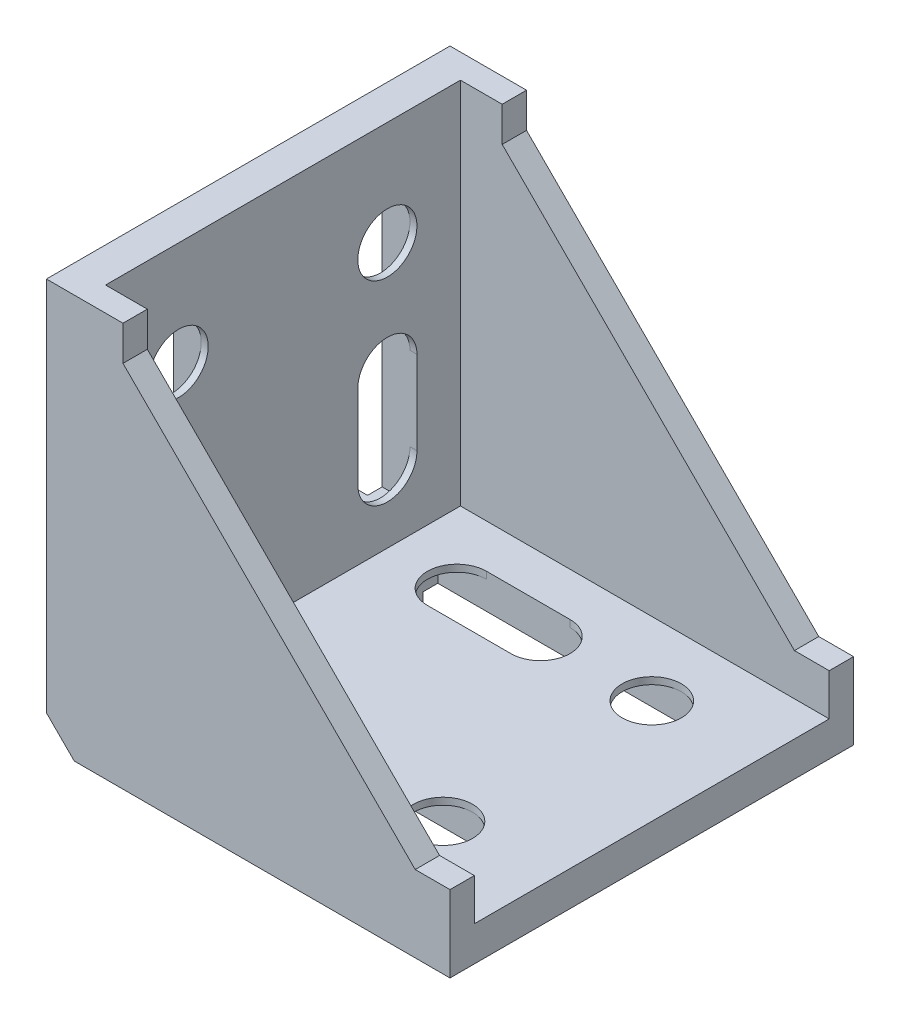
ISO-10303-21;
HEADER;
FILE_DESCRIPTION(('STEP AP214'),'2;1');
FILE_NAME('part.step','',(''),(''),'','','');
FILE_SCHEMA(('AUTOMOTIVE_DESIGN { 1 0 10303 214 1 1 1 1 }'));
ENDSEC;
DATA;
#1=APPLICATION_CONTEXT('core data for automotive mechanical design processes');
#2=APPLICATION_PROTOCOL_DEFINITION('international standard','automotive_design',2000,#1);
#3=PRODUCT_CONTEXT('',#1,'mechanical');
#4=PRODUCT('Part','Part','',(#3));
#5=PRODUCT_RELATED_PRODUCT_CATEGORY('part','',(#4));
#6=PRODUCT_DEFINITION_FORMATION('','',#4);
#7=PRODUCT_DEFINITION_CONTEXT('part definition',#1,'design');
#8=PRODUCT_DEFINITION('design','',#6,#7);
#9=PRODUCT_DEFINITION_SHAPE('','',#8);
#10=(LENGTH_UNIT() NAMED_UNIT(*) SI_UNIT(.MILLI.,.METRE.));
#11=(NAMED_UNIT(*) PLANE_ANGLE_UNIT() SI_UNIT($,.RADIAN.));
#12=(NAMED_UNIT(*) SI_UNIT($,.STERADIAN.) SOLID_ANGLE_UNIT());
#13=UNCERTAINTY_MEASURE_WITH_UNIT(LENGTH_MEASURE(1.E-05),#10,'distance_accuracy_value','');
#14=(GEOMETRIC_REPRESENTATION_CONTEXT(3) GLOBAL_UNCERTAINTY_ASSIGNED_CONTEXT((#13)) GLOBAL_UNIT_ASSIGNED_CONTEXT((#10,
#11,#12)) REPRESENTATION_CONTEXT('',''));
#15=CARTESIAN_POINT('',(0.,0.,0.));
#16=DIRECTION('',(0.,0.,1.));
#17=DIRECTION('',(1.,0.,0.));
#18=AXIS2_PLACEMENT_3D('',#15,#16,#17);
#19=CARTESIAN_POINT('',(5.00000000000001,5.00000000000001,-29.));
#20=DIRECTION('',(0.,1.,0.));
#21=DIRECTION('',(0.,0.,1.));
#22=AXIS2_PLACEMENT_3D('',#19,#20,#21);
#23=PLANE('',#22);
#24=DIRECTION('',(1.,0.,0.));
#25=VECTOR('',#24,1.);
#26=CARTESIAN_POINT('',(5.00000000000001,5.00000000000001,-19.25));
#27=LINE('',#26,#25);
#28=CARTESIAN_POINT('',(15.,5.00000000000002,-19.25));
#29=VERTEX_POINT('',#28);
#30=CARTESIAN_POINT('',(27.,5.00000000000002,-19.25));
#31=VERTEX_POINT('',#30);
#32=EDGE_CURVE('E2949',#29,#31,#27,.T.);
#33=ORIENTED_EDGE('',*,*,#32,.T.);
#34=CARTESIAN_POINT('',(27.,5.,-15.));
#35=DIRECTION('',(0.,1.,0.));
#36=DIRECTION('',(0.,0.,1.));
#37=AXIS2_PLACEMENT_3D('',#34,#35,#36);
#38=CIRCLE('',#37,4.25000000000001);
#39=CARTESIAN_POINT('',(27.,5.00000000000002,-10.75));
#40=VERTEX_POINT('',#39);
#41=EDGE_CURVE('E2954',#31,#40,#38,.F.);
#42=ORIENTED_EDGE('',*,*,#41,.T.);
#43=DIRECTION('',(-1.,0.,0.));
#44=VECTOR('',#43,1.);
#45=CARTESIAN_POINT('',(5.00000000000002,5.00000000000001,-10.75));
#46=LINE('',#45,#44);
#47=CARTESIAN_POINT('',(15.,5.00000000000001,-10.75));
#48=VERTEX_POINT('',#47);
#49=EDGE_CURVE('E2951',#40,#48,#46,.T.);
#50=ORIENTED_EDGE('',*,*,#49,.T.);
#51=CARTESIAN_POINT('',(15.,5.00000000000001,-15.));
#52=DIRECTION('',(0.,1.,0.));
#53=DIRECTION('',(0.,0.,1.));
#54=AXIS2_PLACEMENT_3D('',#51,#52,#53);
#55=CIRCLE('',#54,4.25000000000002);
#56=EDGE_CURVE('E2960',#48,#29,#55,.F.);
#57=ORIENTED_EDGE('',*,*,#56,.T.);
#58=EDGE_LOOP('',(#33,#42,#50,#57));
#59=FACE_BOUND('',#58,.T.);
#60=DIRECTION('',(1.,0.,0.));
#61=VECTOR('',#60,1.);
#62=CARTESIAN_POINT('',(4.99999999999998,5.00000000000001,10.75));
#63=LINE('',#62,#61);
#64=CARTESIAN_POINT('',(15.,5.00000000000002,10.75));
#65=VERTEX_POINT('',#64);
#66=CARTESIAN_POINT('',(27.,5.00000000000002,10.75));
#67=VERTEX_POINT('',#66);
#68=EDGE_CURVE('E2928',#65,#67,#63,.T.);
#69=ORIENTED_EDGE('',*,*,#68,.T.);
#70=CARTESIAN_POINT('',(27.,5.,15.));
#71=DIRECTION('',(0.,1.,0.));
#72=DIRECTION('',(0.,0.,1.));
#73=AXIS2_PLACEMENT_3D('',#70,#71,#72);
#74=CIRCLE('',#73,4.25000000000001);
#75=CARTESIAN_POINT('',(27.,5.00000000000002,19.25));
#76=VERTEX_POINT('',#75);
#77=EDGE_CURVE('E2915',#67,#76,#74,.F.);
#78=ORIENTED_EDGE('',*,*,#77,.T.);
#79=DIRECTION('',(-1.,0.,0.));
#80=VECTOR('',#79,1.);
#81=CARTESIAN_POINT('',(5.00000000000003,5.00000000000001,19.25));
#82=LINE('',#81,#80);
#83=CARTESIAN_POINT('',(15.,5.00000000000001,19.25));
#84=VERTEX_POINT('',#83);
#85=EDGE_CURVE('E2934',#76,#84,#82,.T.);
#86=ORIENTED_EDGE('',*,*,#85,.T.);
#87=CARTESIAN_POINT('',(15.,5.00000000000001,15.));
#88=DIRECTION('',(0.,1.,0.));
#89=DIRECTION('',(0.,0.,1.));
#90=AXIS2_PLACEMENT_3D('',#87,#88,#89);
#91=CIRCLE('',#90,4.25000000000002);
#92=EDGE_CURVE('E2931',#84,#65,#91,.F.);
#93=ORIENTED_EDGE('',*,*,#92,.T.);
#94=EDGE_LOOP('',(#69,#78,#86,#93));
#95=FACE_BOUND('',#94,.T.);
#96=DIRECTION('',(0.,0.,1.));
#97=VECTOR('',#96,1.);
#98=CARTESIAN_POINT('',(58.,5.00000000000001,-29.));
#99=LINE('',#98,#97);
#100=CARTESIAN_POINT('',(58.,5.00000000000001,-25.5));
#101=VERTEX_POINT('',#100);
#102=CARTESIAN_POINT('',(58.,5.00000000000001,25.5));
#103=VERTEX_POINT('',#102);
#104=EDGE_CURVE('E916',#101,#103,#99,.T.);
#105=ORIENTED_EDGE('',*,*,#104,.F.);
#106=DIRECTION('',(-1.,0.,0.));
#107=VECTOR('',#106,1.);
#108=CARTESIAN_POINT('',(58.,5.00000000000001,-25.5));
#109=LINE('',#108,#107);
#110=CARTESIAN_POINT('',(5.00000000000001,5.00000000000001,-25.5));
#111=VERTEX_POINT('',#110);
#112=EDGE_CURVE('E987',#101,#111,#109,.T.);
#113=ORIENTED_EDGE('',*,*,#112,.T.);
#114=DIRECTION('',(0.,0.,1.));
#115=VECTOR('',#114,1.);
#116=CARTESIAN_POINT('',(5.00000000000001,5.00000000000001,-29.));
#117=LINE('',#116,#115);
#118=CARTESIAN_POINT('',(5.,5.00000000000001,25.5));
#119=VERTEX_POINT('',#118);
#120=EDGE_CURVE('E919',#111,#119,#117,.T.);
#121=ORIENTED_EDGE('',*,*,#120,.T.);
#122=DIRECTION('',(1.,0.,0.));
#123=VECTOR('',#122,1.);
#124=CARTESIAN_POINT('',(5.,5.00000000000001,25.5));
#125=LINE('',#124,#123);
#126=EDGE_CURVE('E978',#119,#103,#125,.T.);
#127=ORIENTED_EDGE('',*,*,#126,.T.);
#128=EDGE_LOOP('',(#105,#113,#121,#127));
#129=FACE_BOUND('',#128,.T.);
#130=CARTESIAN_POINT('',(43.,5.,-15.));
#131=DIRECTION('',(0.,1.,0.));
#132=DIRECTION('',(0.,0.,1.));
#133=AXIS2_PLACEMENT_3D('',#130,#131,#132);
#134=CIRCLE('',#133,4.25000000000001);
#135=CARTESIAN_POINT('',(43.,5.,-10.75));
#136=VERTEX_POINT('',#135);
#137=EDGE_CURVE('E2940',#136,#136,#134,.F.);
#138=ORIENTED_EDGE('',*,*,#137,.T.);
#139=EDGE_LOOP('',(#138));
#140=FACE_BOUND('',#139,.T.);
#141=CARTESIAN_POINT('',(43.,5.,15.));
#142=DIRECTION('',(0.,1.,0.));
#143=DIRECTION('',(0.,0.,1.));
#144=AXIS2_PLACEMENT_3D('',#141,#142,#143);
#145=CIRCLE('',#144,4.25000000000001);
#146=CARTESIAN_POINT('',(43.,5.,19.25));
#147=VERTEX_POINT('',#146);
#148=EDGE_CURVE('E704',#147,#147,#145,.F.);
#149=ORIENTED_EDGE('',*,*,#148,.T.);
#150=EDGE_LOOP('',(#149));
#151=FACE_BOUND('',#150,.T.);
#152=ADVANCED_FACE('F31',(#59,#95,#129,#140,#151),#23,.T.);
#153=CARTESIAN_POINT('',(52.,4.00000000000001,19.25));
#154=DIRECTION('',(0.,-1.,0.));
#155=DIRECTION('',(-1.,0.,0.));
#156=AXIS2_PLACEMENT_3D('',#153,#154,#155);
#157=PLANE('',#156);
#158=DIRECTION('',(-1.,0.,0.));
#159=VECTOR('',#158,1.);
#160=CARTESIAN_POINT('',(52.,4.00000000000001,10.75));
#161=LINE('',#160,#159);
#162=CARTESIAN_POINT('',(43.,4.00000000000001,10.75));
#163=VERTEX_POINT('',#162);
#164=CARTESIAN_POINT('',(27.,4.00000000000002,10.75));
#165=VERTEX_POINT('',#164);
#166=EDGE_CURVE('E702',#163,#165,#161,.T.);
#167=ORIENTED_EDGE('',*,*,#166,.F.);
#168=CARTESIAN_POINT('',(43.,4.00000000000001,15.));
#169=DIRECTION('',(0.,-1.,0.));
#170=DIRECTION('',(1.,0.,0.));
#171=AXIS2_PLACEMENT_3D('',#168,#169,#170);
#172=CIRCLE('',#171,4.25000000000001);
#173=CARTESIAN_POINT('',(43.,4.00000000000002,19.25));
#174=VERTEX_POINT('',#173);
#175=EDGE_CURVE('E690',#163,#174,#172,.F.);
#176=ORIENTED_EDGE('',*,*,#175,.T.);
#177=DIRECTION('',(1.,0.,0.));
#178=VECTOR('',#177,1.);
#179=CARTESIAN_POINT('',(43.,4.00000000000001,19.25));
#180=LINE('',#179,#178);
#181=CARTESIAN_POINT('',(27.,4.00000000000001,19.25));
#182=VERTEX_POINT('',#181);
#183=EDGE_CURVE('E701',#182,#174,#180,.T.);
#184=ORIENTED_EDGE('',*,*,#183,.F.);
#185=CARTESIAN_POINT('',(27.,4.,15.));
#186=DIRECTION('',(0.,-1.,0.));
#187=DIRECTION('',(1.,0.,0.));
#188=AXIS2_PLACEMENT_3D('',#185,#186,#187);
#189=CIRCLE('',#188,4.25000000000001);
#190=EDGE_CURVE('E1403',#182,#165,#189,.F.);
#191=ORIENTED_EDGE('',*,*,#190,.T.);
#192=EDGE_LOOP('',(#167,#176,#184,#191));
#193=FACE_BOUND('',#192,.T.);
#194=ADVANCED_FACE('F698',(#193),#157,.T.);
#195=CARTESIAN_POINT('',(52.,4.00000000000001,19.25));
#196=VERTEX_POINT('',#195);
#197=EDGE_CURVE('E706',#174,#196,#180,.T.);
#198=ORIENTED_EDGE('',*,*,#197,.F.);
#199=EDGE_CURVE('E687',#174,#163,#172,.F.);
#200=ORIENTED_EDGE('',*,*,#199,.T.);
#201=CARTESIAN_POINT('',(52.,4.00000000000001,10.75));
#202=VERTEX_POINT('',#201);
#203=EDGE_CURVE('E728',#202,#163,#161,.T.);
#204=ORIENTED_EDGE('',*,*,#203,.F.);
#205=DIRECTION('',(0.,0.,-1.));
#206=VECTOR('',#205,1.);
#207=CARTESIAN_POINT('',(52.,4.00000000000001,19.25));
#208=LINE('',#207,#206);
#209=EDGE_CURVE('E708',#196,#202,#208,.T.);
#210=ORIENTED_EDGE('',*,*,#209,.F.);
#211=EDGE_LOOP('',(#198,#200,#204,#210));
#212=FACE_BOUND('',#211,.T.);
#213=ADVANCED_FACE('F707',(#212),#157,.T.);
#214=CARTESIAN_POINT('',(8.,4.,-19.25));
#215=DIRECTION('',(0.,1.,0.));
#216=DIRECTION('',(1.,0.,0.));
#217=AXIS2_PLACEMENT_3D('',#214,#215,#216);
#218=PLANE('',#217);
#219=CARTESIAN_POINT('',(27.,4.00000000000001,-15.));
#220=DIRECTION('',(0.,1.,0.));
#221=DIRECTION('',(-1.,0.,0.));
#222=AXIS2_PLACEMENT_3D('',#219,#220,#221);
#223=CIRCLE('',#222,4.25000000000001);
#224=CARTESIAN_POINT('',(27.,4.00000000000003,-19.25));
#225=VERTEX_POINT('',#224);
#226=CARTESIAN_POINT('',(27.,4.00000000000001,-10.75));
#227=VERTEX_POINT('',#226);
#228=EDGE_CURVE('E2957',#225,#227,#223,.F.);
#229=ORIENTED_EDGE('',*,*,#228,.F.);
#230=DIRECTION('',(-1.,0.,0.));
#231=VECTOR('',#230,1.);
#232=CARTESIAN_POINT('',(43.,4.00000000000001,-19.25));
#233=LINE('',#232,#231);
#234=CARTESIAN_POINT('',(43.,4.00000000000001,-19.25));
#235=VERTEX_POINT('',#234);
#236=EDGE_CURVE('E757',#235,#225,#233,.T.);
#237=ORIENTED_EDGE('',*,*,#236,.F.);
#238=CARTESIAN_POINT('',(43.,4.00000000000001,-15.));
#239=DIRECTION('',(0.,1.,0.));
#240=DIRECTION('',(-1.,0.,0.));
#241=AXIS2_PLACEMENT_3D('',#238,#239,#240);
#242=CIRCLE('',#241,4.25000000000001);
#243=CARTESIAN_POINT('',(43.,4.00000000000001,-10.75));
#244=VERTEX_POINT('',#243);
#245=EDGE_CURVE('E1400',#244,#235,#242,.F.);
#246=ORIENTED_EDGE('',*,*,#245,.F.);
#247=DIRECTION('',(1.,0.,0.));
#248=VECTOR('',#247,1.);
#249=CARTESIAN_POINT('',(52.,4.00000000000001,-10.75));
#250=LINE('',#249,#248);
#251=EDGE_CURVE('E766',#227,#244,#250,.T.);
#252=ORIENTED_EDGE('',*,*,#251,.F.);
#253=EDGE_LOOP('',(#229,#237,#246,#252));
#254=FACE_BOUND('',#253,.T.);
#255=ADVANCED_FACE('F1511',(#254),#218,.F.);
#256=CARTESIAN_POINT('',(15.,4.,-15.));
#257=DIRECTION('',(0.,1.,0.));
#258=DIRECTION('',(-1.,0.,0.));
#259=AXIS2_PLACEMENT_3D('',#256,#257,#258);
#260=CIRCLE('',#259,4.25000000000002);
#261=CARTESIAN_POINT('',(15.,4.00000000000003,-10.75));
#262=VERTEX_POINT('',#261);
#263=CARTESIAN_POINT('',(15.,4.00000000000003,-19.25));
#264=VERTEX_POINT('',#263);
#265=EDGE_CURVE('E2963',#262,#264,#260,.F.);
#266=ORIENTED_EDGE('',*,*,#265,.F.);
#267=CARTESIAN_POINT('',(8.,4.,-10.75));
#268=VERTEX_POINT('',#267);
#269=EDGE_CURVE('E762',#268,#262,#250,.T.);
#270=ORIENTED_EDGE('',*,*,#269,.F.);
#271=DIRECTION('',(0.,0.,1.));
#272=VECTOR('',#271,1.);
#273=CARTESIAN_POINT('',(8.,4.,-10.75));
#274=LINE('',#273,#272);
#275=CARTESIAN_POINT('',(8.,4.,-19.25));
#276=VERTEX_POINT('',#275);
#277=EDGE_CURVE('E765',#276,#268,#274,.T.);
#278=ORIENTED_EDGE('',*,*,#277,.F.);
#279=EDGE_CURVE('E758',#264,#276,#233,.T.);
#280=ORIENTED_EDGE('',*,*,#279,.F.);
#281=EDGE_LOOP('',(#266,#270,#278,#280));
#282=FACE_BOUND('',#281,.T.);
#283=ADVANCED_FACE('F1509',(#282),#218,.F.);
#284=EDGE_CURVE('E1396',#235,#244,#242,.F.);
#285=ORIENTED_EDGE('',*,*,#284,.F.);
#286=CARTESIAN_POINT('',(52.,4.00000000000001,-19.25));
#287=VERTEX_POINT('',#286);
#288=EDGE_CURVE('E753',#287,#235,#233,.T.);
#289=ORIENTED_EDGE('',*,*,#288,.F.);
#290=DIRECTION('',(0.,0.,-1.));
#291=VECTOR('',#290,1.);
#292=CARTESIAN_POINT('',(52.,4.00000000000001,-19.25));
#293=LINE('',#292,#291);
#294=CARTESIAN_POINT('',(52.,4.00000000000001,-10.75));
#295=VERTEX_POINT('',#294);
#296=EDGE_CURVE('E756',#295,#287,#293,.T.);
#297=ORIENTED_EDGE('',*,*,#296,.F.);
#298=EDGE_CURVE('E761',#244,#295,#250,.T.);
#299=ORIENTED_EDGE('',*,*,#298,.F.);
#300=EDGE_LOOP('',(#285,#289,#297,#299));
#301=FACE_BOUND('',#300,.T.);
#302=ADVANCED_FACE('F1506',(#301),#218,.F.);
#303=CARTESIAN_POINT('',(15.,4.00000000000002,10.75));
#304=VERTEX_POINT('',#303);
#305=CARTESIAN_POINT('',(8.,4.,10.75));
#306=VERTEX_POINT('',#305);
#307=EDGE_CURVE('E727',#304,#306,#161,.T.);
#308=ORIENTED_EDGE('',*,*,#307,.F.);
#309=CARTESIAN_POINT('',(15.,4.,15.));
#310=DIRECTION('',(0.,-1.,0.));
#311=DIRECTION('',(1.,0.,0.));
#312=AXIS2_PLACEMENT_3D('',#309,#310,#311);
#313=CIRCLE('',#312,4.25000000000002);
#314=CARTESIAN_POINT('',(15.,4.00000000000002,19.25));
#315=VERTEX_POINT('',#314);
#316=EDGE_CURVE('E1405',#304,#315,#313,.F.);
#317=ORIENTED_EDGE('',*,*,#316,.T.);
#318=CARTESIAN_POINT('',(8.,4.,19.25));
#319=VERTEX_POINT('',#318);
#320=EDGE_CURVE('E714',#319,#315,#180,.T.);
#321=ORIENTED_EDGE('',*,*,#320,.F.);
#322=DIRECTION('',(0.,0.,1.));
#323=VECTOR('',#322,1.);
#324=CARTESIAN_POINT('',(8.,4.,10.75));
#325=LINE('',#324,#323);
#326=EDGE_CURVE('E720',#306,#319,#325,.T.);
#327=ORIENTED_EDGE('',*,*,#326,.F.);
#328=EDGE_LOOP('',(#308,#317,#321,#327));
#329=FACE_BOUND('',#328,.T.);
#330=ADVANCED_FACE('F1204',(#329),#157,.T.);
#331=CARTESIAN_POINT('',(58.,0.,-29.));
#332=DIRECTION('',(0.,-1.,0.));
#333=DIRECTION('',(1.,0.,0.));
#334=AXIS2_PLACEMENT_3D('',#331,#332,#333);
#335=PLANE('',#334);
#336=DIRECTION('',(1.,0.,0.));
#337=VECTOR('',#336,1.);
#338=CARTESIAN_POINT('',(54.,0.,17.5));
#339=LINE('',#338,#337);
#340=CARTESIAN_POINT('',(52.,0.,17.5));
#341=VERTEX_POINT('',#340);
#342=CARTESIAN_POINT('',(54.,0.,17.5));
#343=VERTEX_POINT('',#342);
#344=EDGE_CURVE('E2913',#341,#343,#339,.T.);
#345=ORIENTED_EDGE('',*,*,#344,.T.);
#346=DIRECTION('',(0.,0.,-1.));
#347=VECTOR('',#346,1.);
#348=CARTESIAN_POINT('',(54.,0.,12.5));
#349=LINE('',#348,#347);
#350=CARTESIAN_POINT('',(54.,0.,12.5));
#351=VERTEX_POINT('',#350);
#352=EDGE_CURVE('E2907',#343,#351,#349,.T.);
#353=ORIENTED_EDGE('',*,*,#352,.T.);
#354=DIRECTION('',(-1.,0.,0.));
#355=VECTOR('',#354,1.);
#356=CARTESIAN_POINT('',(52.,0.,12.5));
#357=LINE('',#356,#355);
#358=CARTESIAN_POINT('',(52.,0.,12.5));
#359=VERTEX_POINT('',#358);
#360=EDGE_CURVE('E2910',#351,#359,#357,.T.);
#361=ORIENTED_EDGE('',*,*,#360,.T.);
#362=DIRECTION('',(0.,0.,-1.));
#363=VECTOR('',#362,1.);
#364=CARTESIAN_POINT('',(52.,0.,19.25));
#365=LINE('',#364,#363);
#366=CARTESIAN_POINT('',(52.,0.,10.75));
#367=VERTEX_POINT('',#366);
#368=EDGE_CURVE('E740',#359,#367,#365,.T.);
#369=ORIENTED_EDGE('',*,*,#368,.T.);
#370=DIRECTION('',(-1.,0.,0.));
#371=VECTOR('',#370,1.);
#372=CARTESIAN_POINT('',(52.,0.,10.75));
#373=LINE('',#372,#371);
#374=CARTESIAN_POINT('',(8.,0.,10.75));
#375=VERTEX_POINT('',#374);
#376=EDGE_CURVE('E738',#367,#375,#373,.T.);
#377=ORIENTED_EDGE('',*,*,#376,.T.);
#378=DIRECTION('',(0.,0.,1.));
#379=VECTOR('',#378,1.);
#380=CARTESIAN_POINT('',(8.,0.,10.75));
#381=LINE('',#380,#379);
#382=CARTESIAN_POINT('',(8.,0.,12.1518222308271));
#383=VERTEX_POINT('',#382);
#384=EDGE_CURVE('E736',#375,#383,#381,.T.);
#385=ORIENTED_EDGE('',*,*,#384,.T.);
#386=DIRECTION('',(-1.,0.,0.));
#387=VECTOR('',#386,1.);
#388=CARTESIAN_POINT('',(8.,0.,12.1518222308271));
#389=LINE('',#388,#387);
#390=CARTESIAN_POINT('',(6.00000000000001,0.,12.1518222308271));
#391=VERTEX_POINT('',#390);
#392=EDGE_CURVE('E2876',#383,#391,#389,.T.);
#393=ORIENTED_EDGE('',*,*,#392,.T.);
#394=DIRECTION('',(0.,0.,1.));
#395=VECTOR('',#394,1.);
#396=CARTESIAN_POINT('',(6.,0.,12.1518222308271));
#397=LINE('',#396,#395);
#398=CARTESIAN_POINT('',(6.,0.,17.1518222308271));
#399=VERTEX_POINT('',#398);
#400=EDGE_CURVE('E2879',#391,#399,#397,.T.);
#401=ORIENTED_EDGE('',*,*,#400,.T.);
#402=DIRECTION('',(1.,0.,0.));
#403=VECTOR('',#402,1.);
#404=CARTESIAN_POINT('',(6.,0.,17.1518222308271));
#405=LINE('',#404,#403);
#406=CARTESIAN_POINT('',(8.,0.,17.1518222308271));
#407=VERTEX_POINT('',#406);
#408=EDGE_CURVE('E2881',#399,#407,#405,.T.);
#409=ORIENTED_EDGE('',*,*,#408,.T.);
#410=CARTESIAN_POINT('',(8.,0.,19.25));
#411=VERTEX_POINT('',#410);
#412=EDGE_CURVE('E734',#407,#411,#381,.T.);
#413=ORIENTED_EDGE('',*,*,#412,.T.);
#414=DIRECTION('',(1.,0.,0.));
#415=VECTOR('',#414,1.);
#416=CARTESIAN_POINT('',(43.,0.,19.25));
#417=LINE('',#416,#415);
#418=CARTESIAN_POINT('',(52.,0.,19.25));
#419=VERTEX_POINT('',#418);
#420=EDGE_CURVE('E732',#411,#419,#417,.T.);
#421=ORIENTED_EDGE('',*,*,#420,.T.);
#422=EDGE_CURVE('E712',#419,#341,#365,.T.);
#423=ORIENTED_EDGE('',*,*,#422,.T.);
#424=EDGE_LOOP('',(#345,#353,#361,#369,#377,#385,#393,#401,#409,#413,#421,#423));
#425=FACE_BOUND('',#424,.T.);
#426=DIRECTION('',(1.,0.,0.));
#427=VECTOR('',#426,1.);
#428=CARTESIAN_POINT('',(8.,0.,-12.1518222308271));
#429=LINE('',#428,#427);
#430=CARTESIAN_POINT('',(6.,0.,-12.1518222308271));
#431=VERTEX_POINT('',#430);
#432=CARTESIAN_POINT('',(8.,0.,-12.1518222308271));
#433=VERTEX_POINT('',#432);
#434=EDGE_CURVE('E2841',#431,#433,#429,.T.);
#435=ORIENTED_EDGE('',*,*,#434,.T.);
#436=DIRECTION('',(0.,0.,1.));
#437=VECTOR('',#436,1.);
#438=CARTESIAN_POINT('',(8.,0.,-10.75));
#439=LINE('',#438,#437);
#440=CARTESIAN_POINT('',(8.,0.,-10.75));
#441=VERTEX_POINT('',#440);
#442=EDGE_CURVE('E2788',#433,#441,#439,.T.);
#443=ORIENTED_EDGE('',*,*,#442,.T.);
#444=DIRECTION('',(1.,0.,0.));
#445=VECTOR('',#444,1.);
#446=CARTESIAN_POINT('',(52.,0.,-10.75));
#447=LINE('',#446,#445);
#448=CARTESIAN_POINT('',(52.,0.,-10.75));
#449=VERTEX_POINT('',#448);
#450=EDGE_CURVE('E773',#441,#449,#447,.T.);
#451=ORIENTED_EDGE('',*,*,#450,.T.);
#452=DIRECTION('',(0.,0.,-1.));
#453=VECTOR('',#452,1.);
#454=CARTESIAN_POINT('',(52.,0.,-19.25));
#455=LINE('',#454,#453);
#456=CARTESIAN_POINT('',(52.,0.,-12.5));
#457=VERTEX_POINT('',#456);
#458=EDGE_CURVE('E779',#449,#457,#455,.T.);
#459=ORIENTED_EDGE('',*,*,#458,.T.);
#460=DIRECTION('',(1.,0.,0.));
#461=VECTOR('',#460,1.);
#462=CARTESIAN_POINT('',(52.,0.,-12.5));
#463=LINE('',#462,#461);
#464=CARTESIAN_POINT('',(54.,0.,-12.5));
#465=VERTEX_POINT('',#464);
#466=EDGE_CURVE('E1423',#457,#465,#463,.T.);
#467=ORIENTED_EDGE('',*,*,#466,.T.);
#468=DIRECTION('',(0.,0.,-1.));
#469=VECTOR('',#468,1.);
#470=CARTESIAN_POINT('',(54.,0.,-12.5));
#471=LINE('',#470,#469);
#472=CARTESIAN_POINT('',(54.,0.,-17.5));
#473=VERTEX_POINT('',#472);
#474=EDGE_CURVE('E1412',#465,#473,#471,.T.);
#475=ORIENTED_EDGE('',*,*,#474,.T.);
#476=DIRECTION('',(-1.,0.,0.));
#477=VECTOR('',#476,1.);
#478=CARTESIAN_POINT('',(54.,0.,-17.5));
#479=LINE('',#478,#477);
#480=CARTESIAN_POINT('',(52.,0.,-17.5));
#481=VERTEX_POINT('',#480);
#482=EDGE_CURVE('E1408',#473,#481,#479,.T.);
#483=ORIENTED_EDGE('',*,*,#482,.T.);
#484=CARTESIAN_POINT('',(52.,0.,-19.25));
#485=VERTEX_POINT('',#484);
#486=EDGE_CURVE('E770',#481,#485,#455,.T.);
#487=ORIENTED_EDGE('',*,*,#486,.T.);
#488=DIRECTION('',(-1.,0.,0.));
#489=VECTOR('',#488,1.);
#490=CARTESIAN_POINT('',(43.,0.,-19.25));
#491=LINE('',#490,#489);
#492=CARTESIAN_POINT('',(8.,0.,-19.25));
#493=VERTEX_POINT('',#492);
#494=EDGE_CURVE('E744',#485,#493,#491,.T.);
#495=ORIENTED_EDGE('',*,*,#494,.T.);
#496=CARTESIAN_POINT('',(8.,0.,-17.1518222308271));
#497=VERTEX_POINT('',#496);
#498=EDGE_CURVE('E2787',#493,#497,#439,.T.);
#499=ORIENTED_EDGE('',*,*,#498,.T.);
#500=DIRECTION('',(-1.,0.,0.));
#501=VECTOR('',#500,1.);
#502=CARTESIAN_POINT('',(6.,0.,-17.1518222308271));
#503=LINE('',#502,#501);
#504=CARTESIAN_POINT('',(6.,0.,-17.1518222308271));
#505=VERTEX_POINT('',#504);
#506=EDGE_CURVE('E2835',#497,#505,#503,.T.);
#507=ORIENTED_EDGE('',*,*,#506,.T.);
#508=DIRECTION('',(0.,0.,1.));
#509=VECTOR('',#508,1.);
#510=CARTESIAN_POINT('',(6.,0.,-12.1518222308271));
#511=LINE('',#510,#509);
#512=EDGE_CURVE('E2837',#505,#431,#511,.T.);
#513=ORIENTED_EDGE('',*,*,#512,.T.);
#514=EDGE_LOOP('',(#435,#443,#451,#459,#467,#475,#483,#487,#495,#499,#507,#513));
#515=FACE_BOUND('',#514,.T.);
#516=DIRECTION('',(-1.,0.,0.));
#517=VECTOR('',#516,1.);
#518=CARTESIAN_POINT('',(54.5,0.,21.7384015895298));
#519=LINE('',#518,#517);
#520=CARTESIAN_POINT('',(54.5,0.,21.7384015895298));
#521=VERTEX_POINT('',#520);
#522=CARTESIAN_POINT('',(5.,0.,21.7384015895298));
#523=VERTEX_POINT('',#522);
#524=EDGE_CURVE('E1444',#521,#523,#519,.T.);
#525=ORIENTED_EDGE('',*,*,#524,.T.);
#526=DIRECTION('',(0.,0.,1.));
#527=VECTOR('',#526,1.);
#528=CARTESIAN_POINT('',(5.,0.,21.7384015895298));
#529=LINE('',#528,#527);
#530=CARTESIAN_POINT('',(5.,0.,25.7384015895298));
#531=VERTEX_POINT('',#530);
#532=EDGE_CURVE('E1441',#523,#531,#529,.T.);
#533=ORIENTED_EDGE('',*,*,#532,.T.);
#534=DIRECTION('',(1.,0.,0.));
#535=VECTOR('',#534,1.);
#536=CARTESIAN_POINT('',(5.,0.,25.7384015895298));
#537=LINE('',#536,#535);
#538=CARTESIAN_POINT('',(54.5,0.,25.7384015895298));
#539=VERTEX_POINT('',#538);
#540=EDGE_CURVE('E1435',#531,#539,#537,.T.);
#541=ORIENTED_EDGE('',*,*,#540,.T.);
#542=DIRECTION('',(0.,0.,-1.));
#543=VECTOR('',#542,1.);
#544=CARTESIAN_POINT('',(54.5,0.,25.7384015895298));
#545=LINE('',#544,#543);
#546=EDGE_CURVE('E1447',#539,#521,#545,.T.);
#547=ORIENTED_EDGE('',*,*,#546,.T.);
#548=EDGE_LOOP('',(#525,#533,#541,#547));
#549=FACE_BOUND('',#548,.T.);
#550=DIRECTION('',(0.,0.,-1.));
#551=VECTOR('',#550,1.);
#552=CARTESIAN_POINT('',(54.5,0.,0.));
#553=LINE('',#552,#551);
#554=CARTESIAN_POINT('',(54.5,0.,8.));
#555=VERTEX_POINT('',#554);
#556=CARTESIAN_POINT('',(54.5,0.,-8.));
#557=VERTEX_POINT('',#556);
#558=EDGE_CURVE('E2564',#555,#557,#553,.T.);
#559=ORIENTED_EDGE('',*,*,#558,.T.);
#560=DIRECTION('',(-1.,0.,0.));
#561=VECTOR('',#560,1.);
#562=CARTESIAN_POINT('',(5.68753116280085,0.,-8.));
#563=LINE('',#562,#561);
#564=CARTESIAN_POINT('',(5.68753116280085,0.,-8.));
#565=VERTEX_POINT('',#564);
#566=EDGE_CURVE('E2576',#557,#565,#563,.T.);
#567=ORIENTED_EDGE('',*,*,#566,.T.);
#568=DIRECTION('',(0.,0.,1.));
#569=VECTOR('',#568,1.);
#570=CARTESIAN_POINT('',(5.68753116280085,0.,8.00000000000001));
#571=LINE('',#570,#569);
#572=CARTESIAN_POINT('',(5.68753116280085,0.,8.00000000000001));
#573=VERTEX_POINT('',#572);
#574=EDGE_CURVE('E2589',#565,#573,#571,.T.);
#575=ORIENTED_EDGE('',*,*,#574,.T.);
#576=DIRECTION('',(1.,0.,0.));
#577=VECTOR('',#576,1.);
#578=CARTESIAN_POINT('',(54.5,0.,8.));
#579=LINE('',#578,#577);
#580=EDGE_CURVE('E2586',#573,#555,#579,.T.);
#581=ORIENTED_EDGE('',*,*,#580,.T.);
#582=EDGE_LOOP('',(#559,#567,#575,#581));
#583=FACE_BOUND('',#582,.T.);
#584=DIRECTION('',(1.,0.,0.));
#585=VECTOR('',#584,1.);
#586=CARTESIAN_POINT('',(58.,0.,29.));
#587=LINE('',#586,#585);
#588=CARTESIAN_POINT('',(4.00000000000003,0.,29.));
#589=VERTEX_POINT('',#588);
#590=CARTESIAN_POINT('',(58.,0.,29.));
#591=VERTEX_POINT('',#590);
#592=EDGE_CURVE('E938',#589,#591,#587,.T.);
#593=ORIENTED_EDGE('',*,*,#592,.F.);
#594=DIRECTION('',(0.,0.,-1.));
#595=VECTOR('',#594,1.);
#596=CARTESIAN_POINT('',(4.00000000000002,0.,-29.));
#597=LINE('',#596,#595);
#598=CARTESIAN_POINT('',(4.00000000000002,0.,-29.));
#599=VERTEX_POINT('',#598);
#600=EDGE_CURVE('E39',#589,#599,#597,.T.);
#601=ORIENTED_EDGE('',*,*,#600,.T.);
#602=DIRECTION('',(1.,0.,0.));
#603=VECTOR('',#602,1.);
#604=CARTESIAN_POINT('',(58.,0.,-29.));
#605=LINE('',#604,#603);
#606=CARTESIAN_POINT('',(58.,0.,-29.));
#607=VERTEX_POINT('',#606);
#608=EDGE_CURVE('E928',#599,#607,#605,.T.);
#609=ORIENTED_EDGE('',*,*,#608,.T.);
#610=DIRECTION('',(0.,0.,1.));
#611=VECTOR('',#610,1.);
#612=CARTESIAN_POINT('',(58.,0.,-29.));
#613=LINE('',#612,#611);
#614=EDGE_CURVE('E913',#607,#591,#613,.T.);
#615=ORIENTED_EDGE('',*,*,#614,.T.);
#616=EDGE_LOOP('',(#593,#601,#609,#615));
#617=FACE_BOUND('',#616,.T.);
#618=DIRECTION('',(0.,0.,-1.));
#619=VECTOR('',#618,1.);
#620=CARTESIAN_POINT('',(54.5,0.,-25.7384015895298));
#621=LINE('',#620,#619);
#622=CARTESIAN_POINT('',(54.5,0.,-21.7384015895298));
#623=VERTEX_POINT('',#622);
#624=CARTESIAN_POINT('',(54.5,0.,-25.7384015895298));
#625=VERTEX_POINT('',#624);
#626=EDGE_CURVE('E2545',#623,#625,#621,.T.);
#627=ORIENTED_EDGE('',*,*,#626,.T.);
#628=DIRECTION('',(-1.,0.,0.));
#629=VECTOR('',#628,1.);
#630=CARTESIAN_POINT('',(5.,0.,-25.7384015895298));
#631=LINE('',#630,#629);
#632=CARTESIAN_POINT('',(5.,0.,-25.7384015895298));
#633=VERTEX_POINT('',#632);
#634=EDGE_CURVE('E2547',#625,#633,#631,.T.);
#635=ORIENTED_EDGE('',*,*,#634,.T.);
#636=DIRECTION('',(0.,0.,1.));
#637=VECTOR('',#636,1.);
#638=CARTESIAN_POINT('',(5.,0.,-21.7384015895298));
#639=LINE('',#638,#637);
#640=CARTESIAN_POINT('',(5.,0.,-21.7384015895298));
#641=VERTEX_POINT('',#640);
#642=EDGE_CURVE('E2553',#633,#641,#639,.T.);
#643=ORIENTED_EDGE('',*,*,#642,.T.);
#644=DIRECTION('',(1.,0.,0.));
#645=VECTOR('',#644,1.);
#646=CARTESIAN_POINT('',(54.5,0.,-21.7384015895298));
#647=LINE('',#646,#645);
#648=EDGE_CURVE('E2549',#641,#623,#647,.T.);
#649=ORIENTED_EDGE('',*,*,#648,.T.);
#650=EDGE_LOOP('',(#627,#635,#643,#649));
#651=FACE_BOUND('',#650,.T.);
#652=ADVANCED_FACE('F1217',(#425,#515,#549,#583,#617,#651),#335,.T.);
#653=CARTESIAN_POINT('',(0.,0.,-29.));
#654=DIRECTION('',(-1.,0.,0.));
#655=DIRECTION('',(0.,-1.,0.));
#656=AXIS2_PLACEMENT_3D('',#653,#654,#655);
#657=PLANE('',#656);
#658=DIRECTION('',(0.,0.,-1.));
#659=VECTOR('',#658,1.);
#660=CARTESIAN_POINT('',(0.,54.5,0.));
#661=LINE('',#660,#659);
#662=CARTESIAN_POINT('',(0.,54.5,8.));
#663=VERTEX_POINT('',#662);
#664=CARTESIAN_POINT('',(0.,54.5,-8.));
#665=VERTEX_POINT('',#664);
#666=EDGE_CURVE('E1234',#663,#665,#661,.T.);
#667=ORIENTED_EDGE('',*,*,#666,.F.);
#668=DIRECTION('',(0.,1.,0.));
#669=VECTOR('',#668,1.);
#670=CARTESIAN_POINT('',(0.,54.5,8.));
#671=LINE('',#670,#669);
#672=CARTESIAN_POINT('',(0.,5.68753116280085,8.00000000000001));
#673=VERTEX_POINT('',#672);
#674=EDGE_CURVE('E2620',#673,#663,#671,.T.);
#675=ORIENTED_EDGE('',*,*,#674,.F.);
#676=DIRECTION('',(0.,0.,1.));
#677=VECTOR('',#676,1.);
#678=CARTESIAN_POINT('',(0.,5.68753116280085,8.00000000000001));
#679=LINE('',#678,#677);
#680=CARTESIAN_POINT('',(0.,5.68753116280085,-8.));
#681=VERTEX_POINT('',#680);
#682=EDGE_CURVE('E2617',#681,#673,#679,.T.);
#683=ORIENTED_EDGE('',*,*,#682,.F.);
#684=DIRECTION('',(0.,-1.,0.));
#685=VECTOR('',#684,1.);
#686=CARTESIAN_POINT('',(0.,5.68753116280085,-8.));
#687=LINE('',#686,#685);
#688=EDGE_CURVE('E2596',#665,#681,#687,.T.);
#689=ORIENTED_EDGE('',*,*,#688,.F.);
#690=EDGE_LOOP('',(#667,#675,#683,#689));
#691=FACE_BOUND('',#690,.T.);
#692=DIRECTION('',(0.,-1.,0.));
#693=VECTOR('',#692,1.);
#694=CARTESIAN_POINT('',(0.,0.,-29.));
#695=LINE('',#694,#693);
#696=CARTESIAN_POINT('',(0.,58.,-29.));
#697=VERTEX_POINT('',#696);
#698=CARTESIAN_POINT('',(0.,3.99999999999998,-29.));
#699=VERTEX_POINT('',#698);
#700=EDGE_CURVE('E930',#697,#699,#695,.T.);
#701=ORIENTED_EDGE('',*,*,#700,.T.);
#702=DIRECTION('',(0.,0.,1.));
#703=VECTOR('',#702,1.);
#704=CARTESIAN_POINT('',(0.,4.,-29.));
#705=LINE('',#704,#703);
#706=CARTESIAN_POINT('',(0.,4.,29.));
#707=VERTEX_POINT('',#706);
#708=EDGE_CURVE('E1393',#699,#707,#705,.T.);
#709=ORIENTED_EDGE('',*,*,#708,.T.);
#710=DIRECTION('',(0.,-1.,0.));
#711=VECTOR('',#710,1.);
#712=CARTESIAN_POINT('',(0.,0.,29.));
#713=LINE('',#712,#711);
#714=CARTESIAN_POINT('',(0.,58.,29.));
#715=VERTEX_POINT('',#714);
#716=EDGE_CURVE('E940',#715,#707,#713,.T.);
#717=ORIENTED_EDGE('',*,*,#716,.F.);
#718=DIRECTION('',(0.,0.,1.));
#719=VECTOR('',#718,1.);
#720=CARTESIAN_POINT('',(0.,58.,-29.));
#721=LINE('',#720,#719);
#722=EDGE_CURVE('E912',#697,#715,#721,.T.);
#723=ORIENTED_EDGE('',*,*,#722,.F.);
#724=EDGE_LOOP('',(#701,#709,#717,#723));
#725=FACE_BOUND('',#724,.T.);
#726=DIRECTION('',(0.,-1.,0.));
#727=VECTOR('',#726,1.);
#728=CARTESIAN_POINT('',(0.,5.,-25.7384015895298));
#729=LINE('',#728,#727);
#730=CARTESIAN_POINT('',(0.,54.5,-25.7384015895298));
#731=VERTEX_POINT('',#730);
#732=CARTESIAN_POINT('',(0.,5.,-25.7384015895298));
#733=VERTEX_POINT('',#732);
#734=EDGE_CURVE('E1096',#731,#733,#729,.T.);
#735=ORIENTED_EDGE('',*,*,#734,.F.);
#736=DIRECTION('',(0.,0.,-1.));
#737=VECTOR('',#736,1.);
#738=CARTESIAN_POINT('',(0.,54.5,-25.7384015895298));
#739=LINE('',#738,#737);
#740=CARTESIAN_POINT('',(0.,54.5,-21.7384015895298));
#741=VERTEX_POINT('',#740);
#742=EDGE_CURVE('E1086',#741,#731,#739,.T.);
#743=ORIENTED_EDGE('',*,*,#742,.F.);
#744=DIRECTION('',(0.,1.,0.));
#745=VECTOR('',#744,1.);
#746=CARTESIAN_POINT('',(0.,54.5,-21.7384015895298));
#747=LINE('',#746,#745);
#748=CARTESIAN_POINT('',(0.,5.,-21.7384015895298));
#749=VERTEX_POINT('',#748);
#750=EDGE_CURVE('E1090',#749,#741,#747,.T.);
#751=ORIENTED_EDGE('',*,*,#750,.F.);
#752=DIRECTION('',(0.,0.,1.));
#753=VECTOR('',#752,1.);
#754=CARTESIAN_POINT('',(0.,5.,-21.7384015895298));
#755=LINE('',#754,#753);
#756=EDGE_CURVE('E1093',#733,#749,#755,.T.);
#757=ORIENTED_EDGE('',*,*,#756,.F.);
#758=EDGE_LOOP('',(#735,#743,#751,#757));
#759=FACE_BOUND('',#758,.T.);
#760=DIRECTION('',(0.,0.,1.));
#761=VECTOR('',#760,1.);
#762=CARTESIAN_POINT('',(0.,5.,21.7384015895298));
#763=LINE('',#762,#761);
#764=CARTESIAN_POINT('',(0.,5.,21.7384015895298));
#765=VERTEX_POINT('',#764);
#766=CARTESIAN_POINT('',(0.,5.,25.7384015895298));
#767=VERTEX_POINT('',#766);
#768=EDGE_CURVE('E821',#765,#767,#763,.T.);
#769=ORIENTED_EDGE('',*,*,#768,.F.);
#770=DIRECTION('',(0.,-1.,0.));
#771=VECTOR('',#770,1.);
#772=CARTESIAN_POINT('',(0.,54.5,21.7384015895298));
#773=LINE('',#772,#771);
#774=CARTESIAN_POINT('',(0.,54.5,21.7384015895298));
#775=VERTEX_POINT('',#774);
#776=EDGE_CURVE('E811',#775,#765,#773,.T.);
#777=ORIENTED_EDGE('',*,*,#776,.F.);
#778=DIRECTION('',(0.,0.,-1.));
#779=VECTOR('',#778,1.);
#780=CARTESIAN_POINT('',(0.,54.5,25.7384015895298));
#781=LINE('',#780,#779);
#782=CARTESIAN_POINT('',(0.,54.5,25.7384015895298));
#783=VERTEX_POINT('',#782);
#784=EDGE_CURVE('E826',#783,#775,#781,.T.);
#785=ORIENTED_EDGE('',*,*,#784,.F.);
#786=DIRECTION('',(0.,1.,0.));
#787=VECTOR('',#786,1.);
#788=CARTESIAN_POINT('',(0.,5.,25.7384015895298));
#789=LINE('',#788,#787);
#790=EDGE_CURVE('E823',#767,#783,#789,.T.);
#791=ORIENTED_EDGE('',*,*,#790,.F.);
#792=EDGE_LOOP('',(#769,#777,#785,#791));
#793=FACE_BOUND('',#792,.T.);
#794=DIRECTION('',(0.,0.,1.));
#795=VECTOR('',#794,1.);
#796=CARTESIAN_POINT('',(0.,6.,-12.1518222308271));
#797=LINE('',#796,#795);
#798=CARTESIAN_POINT('',(0.,6.,-17.1518222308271));
#799=VERTEX_POINT('',#798);
#800=CARTESIAN_POINT('',(0.,6.,-12.1518222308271));
#801=VERTEX_POINT('',#800);
#802=EDGE_CURVE('E2697',#799,#801,#797,.T.);
#803=ORIENTED_EDGE('',*,*,#802,.F.);
#804=DIRECTION('',(0.,-1.,0.));
#805=VECTOR('',#804,1.);
#806=CARTESIAN_POINT('',(0.,6.,-17.1518222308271));
#807=LINE('',#806,#805);
#808=CARTESIAN_POINT('',(0.,8.,-17.1518222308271));
#809=VERTEX_POINT('',#808);
#810=EDGE_CURVE('E2683',#809,#799,#807,.T.);
#811=ORIENTED_EDGE('',*,*,#810,.F.);
#812=DIRECTION('',(0.,0.,1.));
#813=VECTOR('',#812,1.);
#814=CARTESIAN_POINT('',(0.,8.,-10.75));
#815=LINE('',#814,#813);
#816=CARTESIAN_POINT('',(0.,8.,-19.25));
#817=VERTEX_POINT('',#816);
#818=EDGE_CURVE('E894',#817,#809,#815,.T.);
#819=ORIENTED_EDGE('',*,*,#818,.F.);
#820=DIRECTION('',(0.,-1.,0.));
#821=VECTOR('',#820,1.);
#822=CARTESIAN_POINT('',(0.,27.,-19.25));
#823=LINE('',#822,#821);
#824=CARTESIAN_POINT('',(0.,52.,-19.25));
#825=VERTEX_POINT('',#824);
#826=EDGE_CURVE('E1071',#825,#817,#823,.T.);
#827=ORIENTED_EDGE('',*,*,#826,.F.);
#828=DIRECTION('',(0.,0.,-1.));
#829=VECTOR('',#828,1.);
#830=CARTESIAN_POINT('',(0.,52.,-19.25));
#831=LINE('',#830,#829);
#832=CARTESIAN_POINT('',(0.,52.,-17.5));
#833=VERTEX_POINT('',#832);
#834=EDGE_CURVE('E897',#833,#825,#831,.T.);
#835=ORIENTED_EDGE('',*,*,#834,.F.);
#836=DIRECTION('',(0.,-1.,0.));
#837=VECTOR('',#836,1.);
#838=CARTESIAN_POINT('',(0.,54.,-17.5));
#839=LINE('',#838,#837);
#840=CARTESIAN_POINT('',(0.,54.,-17.5));
#841=VERTEX_POINT('',#840);
#842=EDGE_CURVE('E789',#841,#833,#839,.T.);
#843=ORIENTED_EDGE('',*,*,#842,.F.);
#844=DIRECTION('',(0.,0.,-1.));
#845=VECTOR('',#844,1.);
#846=CARTESIAN_POINT('',(0.,54.,-12.5));
#847=LINE('',#846,#845);
#848=CARTESIAN_POINT('',(0.,54.,-12.5));
#849=VERTEX_POINT('',#848);
#850=EDGE_CURVE('E794',#849,#841,#847,.T.);
#851=ORIENTED_EDGE('',*,*,#850,.F.);
#852=DIRECTION('',(0.,1.,0.));
#853=VECTOR('',#852,1.);
#854=CARTESIAN_POINT('',(0.,52.,-12.5));
#855=LINE('',#854,#853);
#856=CARTESIAN_POINT('',(0.,52.,-12.5));
#857=VERTEX_POINT('',#856);
#858=EDGE_CURVE('E1152',#857,#849,#855,.T.);
#859=ORIENTED_EDGE('',*,*,#858,.F.);
#860=CARTESIAN_POINT('',(0.,52.,-10.75));
#861=VERTEX_POINT('',#860);
#862=EDGE_CURVE('E906',#861,#857,#831,.T.);
#863=ORIENTED_EDGE('',*,*,#862,.F.);
#864=DIRECTION('',(0.,1.,0.));
#865=VECTOR('',#864,1.);
#866=CARTESIAN_POINT('',(0.,27.,-10.75));
#867=LINE('',#866,#865);
#868=CARTESIAN_POINT('',(0.,8.,-10.75));
#869=VERTEX_POINT('',#868);
#870=EDGE_CURVE('E1062',#869,#861,#867,.T.);
#871=ORIENTED_EDGE('',*,*,#870,.F.);
#872=CARTESIAN_POINT('',(0.,8.,-12.1518222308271));
#873=VERTEX_POINT('',#872);
#874=EDGE_CURVE('E878',#873,#869,#815,.T.);
#875=ORIENTED_EDGE('',*,*,#874,.F.);
#876=DIRECTION('',(0.,1.,0.));
#877=VECTOR('',#876,1.);
#878=CARTESIAN_POINT('',(0.,8.,-12.1518222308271));
#879=LINE('',#878,#877);
#880=EDGE_CURVE('E2688',#801,#873,#879,.T.);
#881=ORIENTED_EDGE('',*,*,#880,.F.);
#882=EDGE_LOOP('',(#803,#811,#819,#827,#835,#843,#851,#859,#863,#871,#875,#881));
#883=FACE_BOUND('',#882,.T.);
#884=DIRECTION('',(0.,0.,-1.));
#885=VECTOR('',#884,1.);
#886=CARTESIAN_POINT('',(0.,54.,12.5));
#887=LINE('',#886,#885);
#888=CARTESIAN_POINT('',(0.,54.,17.5));
#889=VERTEX_POINT('',#888);
#890=CARTESIAN_POINT('',(0.,54.,12.5));
#891=VERTEX_POINT('',#890);
#892=EDGE_CURVE('E2645',#889,#891,#887,.T.);
#893=ORIENTED_EDGE('',*,*,#892,.F.);
#894=DIRECTION('',(0.,1.,0.));
#895=VECTOR('',#894,1.);
#896=CARTESIAN_POINT('',(0.,54.,17.5));
#897=LINE('',#896,#895);
#898=CARTESIAN_POINT('',(0.,52.,17.5));
#899=VERTEX_POINT('',#898);
#900=EDGE_CURVE('E2626',#899,#889,#897,.T.);
#901=ORIENTED_EDGE('',*,*,#900,.F.);
#902=DIRECTION('',(0.,0.,-1.));
#903=VECTOR('',#902,1.);
#904=CARTESIAN_POINT('',(0.,52.,19.25));
#905=LINE('',#904,#903);
#906=CARTESIAN_POINT('',(0.,52.,19.25));
#907=VERTEX_POINT('',#906);
#908=EDGE_CURVE('E856',#907,#899,#905,.T.);
#909=ORIENTED_EDGE('',*,*,#908,.F.);
#910=DIRECTION('',(0.,1.,0.));
#911=VECTOR('',#910,1.);
#912=CARTESIAN_POINT('',(0.,27.,19.25));
#913=LINE('',#912,#911);
#914=CARTESIAN_POINT('',(0.,8.,19.25));
#915=VERTEX_POINT('',#914);
#916=EDGE_CURVE('E1034',#915,#907,#913,.T.);
#917=ORIENTED_EDGE('',*,*,#916,.F.);
#918=DIRECTION('',(0.,0.,1.));
#919=VECTOR('',#918,1.);
#920=CARTESIAN_POINT('',(0.,8.,10.75));
#921=LINE('',#920,#919);
#922=CARTESIAN_POINT('',(0.,8.,17.1518222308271));
#923=VERTEX_POINT('',#922);
#924=EDGE_CURVE('E859',#923,#915,#921,.T.);
#925=ORIENTED_EDGE('',*,*,#924,.F.);
#926=DIRECTION('',(0.,1.,0.));
#927=VECTOR('',#926,1.);
#928=CARTESIAN_POINT('',(0.,6.,17.1518222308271));
#929=LINE('',#928,#927);
#930=CARTESIAN_POINT('',(0.,6.,17.1518222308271));
#931=VERTEX_POINT('',#930);
#932=EDGE_CURVE('E2657',#931,#923,#929,.T.);
#933=ORIENTED_EDGE('',*,*,#932,.F.);
#934=DIRECTION('',(0.,0.,1.));
#935=VECTOR('',#934,1.);
#936=CARTESIAN_POINT('',(0.,6.,12.1518222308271));
#937=LINE('',#936,#935);
#938=CARTESIAN_POINT('',(0.,6.,12.1518222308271));
#939=VERTEX_POINT('',#938);
#940=EDGE_CURVE('E2662',#939,#931,#937,.T.);
#941=ORIENTED_EDGE('',*,*,#940,.F.);
#942=DIRECTION('',(0.,-1.,0.));
#943=VECTOR('',#942,1.);
#944=CARTESIAN_POINT('',(0.,8.,12.1518222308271));
#945=LINE('',#944,#943);
#946=CARTESIAN_POINT('',(0.,8.,12.1518222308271));
#947=VERTEX_POINT('',#946);
#948=EDGE_CURVE('E2670',#947,#939,#945,.T.);
#949=ORIENTED_EDGE('',*,*,#948,.F.);
#950=CARTESIAN_POINT('',(0.,8.,10.75));
#951=VERTEX_POINT('',#950);
#952=EDGE_CURVE('E860',#951,#947,#921,.T.);
#953=ORIENTED_EDGE('',*,*,#952,.F.);
#954=DIRECTION('',(0.,-1.,0.));
#955=VECTOR('',#954,1.);
#956=CARTESIAN_POINT('',(0.,27.,10.75));
#957=LINE('',#956,#955);
#958=CARTESIAN_POINT('',(0.,52.,10.75));
#959=VERTEX_POINT('',#958);
#960=EDGE_CURVE('E1043',#959,#951,#957,.T.);
#961=ORIENTED_EDGE('',*,*,#960,.F.);
#962=CARTESIAN_POINT('',(0.,52.,12.5));
#963=VERTEX_POINT('',#962);
#964=EDGE_CURVE('E833',#963,#959,#905,.T.);
#965=ORIENTED_EDGE('',*,*,#964,.F.);
#966=DIRECTION('',(0.,-1.,0.));
#967=VECTOR('',#966,1.);
#968=CARTESIAN_POINT('',(0.,52.,12.5));
#969=LINE('',#968,#967);
#970=EDGE_CURVE('E2636',#891,#963,#969,.T.);
#971=ORIENTED_EDGE('',*,*,#970,.F.);
#972=EDGE_LOOP('',(#893,#901,#909,#917,#925,#933,#941,#949,#953,#961,#965,#971));
#973=FACE_BOUND('',#972,.T.);
#974=ADVANCED_FACE('F1148',(#691,#725,#759,#793,#883,#973),#657,.T.);
#975=CARTESIAN_POINT('',(58.,27.,15.));
#976=DIRECTION('',(-1.,0.,0.));
#977=DIRECTION('',(0.,0.,1.));
#978=AXIS2_PLACEMENT_3D('',#975,#976,#977);
#979=CYLINDRICAL_SURFACE('',#978,4.25000000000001);
#980=CARTESIAN_POINT('',(4.,27.,15.));
#981=DIRECTION('',(-1.,0.,0.));
#982=DIRECTION('',(0.,-1.,0.));
#983=AXIS2_PLACEMENT_3D('',#980,#981,#982);
#984=CIRCLE('',#983,4.25000000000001);
#985=CARTESIAN_POINT('',(4.00000000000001,27.,10.75));
#986=VERTEX_POINT('',#985);
#987=CARTESIAN_POINT('',(4.,27.,19.25));
#988=VERTEX_POINT('',#987);
#989=EDGE_CURVE('E876',#986,#988,#984,.F.);
#990=ORIENTED_EDGE('',*,*,#989,.F.);
#991=DIRECTION('',(-1.,0.,0.));
#992=VECTOR('',#991,1.);
#993=CARTESIAN_POINT('',(58.,27.,10.75));
#994=LINE('',#993,#992);
#995=CARTESIAN_POINT('',(5.00000000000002,27.,10.75));
#996=VERTEX_POINT('',#995);
#997=EDGE_CURVE('E1030',#996,#986,#994,.T.);
#998=ORIENTED_EDGE('',*,*,#997,.F.);
#999=CARTESIAN_POINT('',(5.,27.,15.));
#1000=DIRECTION('',(1.,0.,0.));
#1001=DIRECTION('',(0.,1.,0.));
#1002=AXIS2_PLACEMENT_3D('',#999,#1000,#1001);
#1003=CIRCLE('',#1002,4.25000000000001);
#1004=CARTESIAN_POINT('',(5.00000000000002,27.,19.25));
#1005=VERTEX_POINT('',#1004);
#1006=EDGE_CURVE('E1003',#996,#1005,#1003,.T.);
#1007=ORIENTED_EDGE('',*,*,#1006,.T.);
#1008=DIRECTION('',(-1.,0.,0.));
#1009=VECTOR('',#1008,1.);
#1010=CARTESIAN_POINT('',(58.,27.,19.25));
#1011=LINE('',#1010,#1009);
#1012=EDGE_CURVE('E1029',#1005,#988,#1011,.T.);
#1013=ORIENTED_EDGE('',*,*,#1012,.T.);
#1014=EDGE_LOOP('',(#990,#998,#1007,#1013));
#1015=FACE_BOUND('',#1014,.T.);
#1016=ADVANCED_FACE('F1221',(#1015),#979,.F.);
#1017=CARTESIAN_POINT('',(58.,15.,15.));
#1018=DIRECTION('',(-1.,0.,0.));
#1019=DIRECTION('',(0.,0.,1.));
#1020=AXIS2_PLACEMENT_3D('',#1017,#1018,#1019);
#1021=CYLINDRICAL_SURFACE('',#1020,4.25000000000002);
#1022=CARTESIAN_POINT('',(4.,15.,15.));
#1023=DIRECTION('',(-1.,0.,0.));
#1024=DIRECTION('',(0.,-1.,0.));
#1025=AXIS2_PLACEMENT_3D('',#1022,#1023,#1024);
#1026=CIRCLE('',#1025,4.25000000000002);
#1027=CARTESIAN_POINT('',(4.00000000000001,15.,19.25));
#1028=VERTEX_POINT('',#1027);
#1029=CARTESIAN_POINT('',(4.,15.,10.75));
#1030=VERTEX_POINT('',#1029);
#1031=EDGE_CURVE('E866',#1028,#1030,#1026,.F.);
#1032=ORIENTED_EDGE('',*,*,#1031,.F.);
#1033=DIRECTION('',(-1.,0.,0.));
#1034=VECTOR('',#1033,1.);
#1035=CARTESIAN_POINT('',(58.,15.,19.25));
#1036=LINE('',#1035,#1034);
#1037=CARTESIAN_POINT('',(5.00000000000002,15.,19.25));
#1038=VERTEX_POINT('',#1037);
#1039=EDGE_CURVE('E1037',#1038,#1028,#1036,.T.);
#1040=ORIENTED_EDGE('',*,*,#1039,.F.);
#1041=CARTESIAN_POINT('',(5.,15.,15.));
#1042=DIRECTION('',(1.,0.,0.));
#1043=DIRECTION('',(0.,1.,0.));
#1044=AXIS2_PLACEMENT_3D('',#1041,#1042,#1043);
#1045=CIRCLE('',#1044,4.25000000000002);
#1046=CARTESIAN_POINT('',(5.00000000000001,15.,10.75));
#1047=VERTEX_POINT('',#1046);
#1048=EDGE_CURVE('E1024',#1038,#1047,#1045,.T.);
#1049=ORIENTED_EDGE('',*,*,#1048,.T.);
#1050=DIRECTION('',(-1.,0.,0.));
#1051=VECTOR('',#1050,1.);
#1052=CARTESIAN_POINT('',(58.,15.,10.75));
#1053=LINE('',#1052,#1051);
#1054=EDGE_CURVE('E1033',#1047,#1030,#1053,.T.);
#1055=ORIENTED_EDGE('',*,*,#1054,.T.);
#1056=EDGE_LOOP('',(#1032,#1040,#1049,#1055));
#1057=FACE_BOUND('',#1056,.T.);
#1058=ADVANCED_FACE('F1226',(#1057),#1021,.F.);
#1059=CARTESIAN_POINT('',(58.,43.,15.));
#1060=DIRECTION('',(-1.,0.,0.));
#1061=DIRECTION('',(0.,0.,1.));
#1062=AXIS2_PLACEMENT_3D('',#1059,#1060,#1061);
#1063=CYLINDRICAL_SURFACE('',#1062,4.25000000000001);
#1064=CARTESIAN_POINT('',(5.,43.,15.));
#1065=DIRECTION('',(1.,0.,0.));
#1066=DIRECTION('',(0.,1.,0.));
#1067=AXIS2_PLACEMENT_3D('',#1064,#1065,#1066);
#1068=CIRCLE('',#1067,4.25000000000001);
#1069=CARTESIAN_POINT('',(5.,47.25,15.));
#1070=VERTEX_POINT('',#1069);
#1071=EDGE_CURVE('E1073',#1070,#1070,#1068,.T.);
#1072=ORIENTED_EDGE('',*,*,#1071,.T.);
#1073=EDGE_LOOP('',(#1072));
#1074=FACE_BOUND('',#1073,.T.);
#1075=CARTESIAN_POINT('',(4.,43.,15.));
#1076=DIRECTION('',(-1.,0.,0.));
#1077=DIRECTION('',(0.,-1.,0.));
#1078=AXIS2_PLACEMENT_3D('',#1075,#1076,#1077);
#1079=CIRCLE('',#1078,4.25000000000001);
#1080=CARTESIAN_POINT('',(4.,43.,10.75));
#1081=VERTEX_POINT('',#1080);
#1082=CARTESIAN_POINT('',(4.,43.,19.25));
#1083=VERTEX_POINT('',#1082);
#1084=EDGE_CURVE('E911',#1081,#1083,#1079,.F.);
#1085=ORIENTED_EDGE('',*,*,#1084,.F.);
#1086=EDGE_CURVE('E909',#1083,#1081,#1079,.F.);
#1087=ORIENTED_EDGE('',*,*,#1086,.F.);
#1088=EDGE_LOOP('',(#1085,#1087));
#1089=FACE_BOUND('',#1088,.T.);
#1090=ADVANCED_FACE('F1317',(#1074,#1089),#1063,.F.);
#1091=CARTESIAN_POINT('',(5.,58.,-29.));
#1092=DIRECTION('',(1.,0.,0.));
#1093=DIRECTION('',(0.,1.,0.));
#1094=AXIS2_PLACEMENT_3D('',#1091,#1092,#1093);
#1095=PLANE('',#1094);
#1096=ORIENTED_EDGE('',*,*,#1071,.F.);
#1097=EDGE_LOOP('',(#1096));
#1098=FACE_BOUND('',#1097,.T.);
#1099=CARTESIAN_POINT('',(5.,27.,-15.));
#1100=DIRECTION('',(1.,0.,0.));
#1101=DIRECTION('',(0.,1.,0.));
#1102=AXIS2_PLACEMENT_3D('',#1099,#1100,#1101);
#1103=CIRCLE('',#1102,4.25000000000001);
#1104=CARTESIAN_POINT('',(5.00000000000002,27.,-19.25));
#1105=VERTEX_POINT('',#1104);
#1106=CARTESIAN_POINT('',(5.00000000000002,27.,-10.75));
#1107=VERTEX_POINT('',#1106);
#1108=EDGE_CURVE('E1048',#1105,#1107,#1103,.T.);
#1109=ORIENTED_EDGE('',*,*,#1108,.F.);
#1110=DIRECTION('',(0.,1.,0.));
#1111=VECTOR('',#1110,1.);
#1112=CARTESIAN_POINT('',(5.,58.,-19.25));
#1113=LINE('',#1112,#1111);
#1114=CARTESIAN_POINT('',(5.00000000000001,15.,-19.25));
#1115=VERTEX_POINT('',#1114);
#1116=EDGE_CURVE('E1055',#1115,#1105,#1113,.T.);
#1117=ORIENTED_EDGE('',*,*,#1116,.F.);
#1118=CARTESIAN_POINT('',(5.,15.,-15.));
#1119=DIRECTION('',(1.,0.,0.));
#1120=DIRECTION('',(0.,1.,0.));
#1121=AXIS2_PLACEMENT_3D('',#1118,#1119,#1120);
#1122=CIRCLE('',#1121,4.25000000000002);
#1123=CARTESIAN_POINT('',(5.00000000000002,15.,-10.75));
#1124=VERTEX_POINT('',#1123);
#1125=EDGE_CURVE('E1052',#1124,#1115,#1122,.T.);
#1126=ORIENTED_EDGE('',*,*,#1125,.F.);
#1127=DIRECTION('',(0.,-1.,0.));
#1128=VECTOR('',#1127,1.);
#1129=CARTESIAN_POINT('',(5.,58.,-10.75));
#1130=LINE('',#1129,#1128);
#1131=EDGE_CURVE('E1050',#1107,#1124,#1130,.T.);
#1132=ORIENTED_EDGE('',*,*,#1131,.F.);
#1133=EDGE_LOOP('',(#1109,#1117,#1126,#1132));
#1134=FACE_BOUND('',#1133,.T.);
#1135=CARTESIAN_POINT('',(5.,43.,-15.));
#1136=DIRECTION('',(1.,0.,0.));
#1137=DIRECTION('',(0.,1.,0.));
#1138=AXIS2_PLACEMENT_3D('',#1135,#1136,#1137);
#1139=CIRCLE('',#1138,4.25000000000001);
#1140=CARTESIAN_POINT('',(5.,47.25,-15.));
#1141=VERTEX_POINT('',#1140);
#1142=EDGE_CURVE('E1045',#1141,#1141,#1139,.T.);
#1143=ORIENTED_EDGE('',*,*,#1142,.F.);
#1144=EDGE_LOOP('',(#1143));
#1145=FACE_BOUND('',#1144,.T.);
#1146=ORIENTED_EDGE('',*,*,#1006,.F.);
#1147=DIRECTION('',(0.,1.,0.));
#1148=VECTOR('',#1147,1.);
#1149=CARTESIAN_POINT('',(5.,58.,10.75));
#1150=LINE('',#1149,#1148);
#1151=EDGE_CURVE('E1027',#1047,#996,#1150,.T.);
#1152=ORIENTED_EDGE('',*,*,#1151,.F.);
#1153=ORIENTED_EDGE('',*,*,#1048,.F.);
#1154=DIRECTION('',(0.,-1.,0.));
#1155=VECTOR('',#1154,1.);
#1156=CARTESIAN_POINT('',(5.,58.,19.25));
#1157=LINE('',#1156,#1155);
#1158=EDGE_CURVE('E1022',#1005,#1038,#1157,.T.);
#1159=ORIENTED_EDGE('',*,*,#1158,.F.);
#1160=EDGE_LOOP('',(#1146,#1152,#1153,#1159));
#1161=FACE_BOUND('',#1160,.T.);
#1162=ORIENTED_EDGE('',*,*,#120,.F.);
#1163=DIRECTION('',(0.,1.,0.));
#1164=VECTOR('',#1163,1.);
#1165=CARTESIAN_POINT('',(5.,5.00000000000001,-25.5));
#1166=LINE('',#1165,#1164);
#1167=CARTESIAN_POINT('',(5.,58.,-25.5));
#1168=VERTEX_POINT('',#1167);
#1169=EDGE_CURVE('E996',#111,#1168,#1166,.T.);
#1170=ORIENTED_EDGE('',*,*,#1169,.T.);
#1171=DIRECTION('',(0.,0.,1.));
#1172=VECTOR('',#1171,1.);
#1173=CARTESIAN_POINT('',(5.,58.,-29.));
#1174=LINE('',#1173,#1172);
#1175=CARTESIAN_POINT('',(5.,58.,25.5));
#1176=VERTEX_POINT('',#1175);
#1177=EDGE_CURVE('E921',#1168,#1176,#1174,.T.);
#1178=ORIENTED_EDGE('',*,*,#1177,.T.);
#1179=DIRECTION('',(0.,-1.,0.));
#1180=VECTOR('',#1179,1.);
#1181=CARTESIAN_POINT('',(5.,58.,25.5));
#1182=LINE('',#1181,#1180);
#1183=EDGE_CURVE('E956',#1176,#119,#1182,.T.);
#1184=ORIENTED_EDGE('',*,*,#1183,.T.);
#1185=EDGE_LOOP('',(#1162,#1170,#1178,#1184));
#1186=FACE_BOUND('',#1185,.T.);
#1187=ADVANCED_FACE('F1209',(#1098,#1134,#1145,#1161,#1186),#1095,.T.);
#1188=CARTESIAN_POINT('',(0.,58.,-29.));
#1189=DIRECTION('',(0.,1.,0.));
#1190=DIRECTION('',(-1.,0.,0.));
#1191=AXIS2_PLACEMENT_3D('',#1188,#1189,#1190);
#1192=PLANE('',#1191);
#1193=ORIENTED_EDGE('',*,*,#722,.T.);
#1194=DIRECTION('',(-1.,0.,0.));
#1195=VECTOR('',#1194,1.);
#1196=CARTESIAN_POINT('',(0.,58.,29.));
#1197=LINE('',#1196,#1195);
#1198=CARTESIAN_POINT('',(11.,58.,29.));
#1199=VERTEX_POINT('',#1198);
#1200=EDGE_CURVE('E933',#1199,#715,#1197,.T.);
#1201=ORIENTED_EDGE('',*,*,#1200,.F.);
#1202=DIRECTION('',(0.,0.,1.));
#1203=VECTOR('',#1202,1.);
#1204=CARTESIAN_POINT('',(11.,58.,25.5));
#1205=LINE('',#1204,#1203);
#1206=CARTESIAN_POINT('',(11.,58.,25.5));
#1207=VERTEX_POINT('',#1206);
#1208=EDGE_CURVE('E942',#1207,#1199,#1205,.T.);
#1209=ORIENTED_EDGE('',*,*,#1208,.F.);
#1210=DIRECTION('',(-1.,0.,0.));
#1211=VECTOR('',#1210,1.);
#1212=CARTESIAN_POINT('',(5.,58.,25.5));
#1213=LINE('',#1212,#1211);
#1214=EDGE_CURVE('E947',#1207,#1176,#1213,.T.);
#1215=ORIENTED_EDGE('',*,*,#1214,.T.);
#1216=ORIENTED_EDGE('',*,*,#1177,.F.);
#1217=DIRECTION('',(1.,0.,0.));
#1218=VECTOR('',#1217,1.);
#1219=CARTESIAN_POINT('',(5.,58.,-25.5));
#1220=LINE('',#1219,#1218);
#1221=CARTESIAN_POINT('',(11.,58.,-25.5));
#1222=VERTEX_POINT('',#1221);
#1223=EDGE_CURVE('E1017',#1168,#1222,#1220,.T.);
#1224=ORIENTED_EDGE('',*,*,#1223,.T.);
#1225=DIRECTION('',(0.,0.,-1.));
#1226=VECTOR('',#1225,1.);
#1227=CARTESIAN_POINT('',(11.,58.,-25.5));
#1228=LINE('',#1227,#1226);
#1229=CARTESIAN_POINT('',(11.,58.,-29.));
#1230=VERTEX_POINT('',#1229);
#1231=EDGE_CURVE('E983',#1222,#1230,#1228,.T.);
#1232=ORIENTED_EDGE('',*,*,#1231,.T.);
#1233=DIRECTION('',(-1.,0.,0.));
#1234=VECTOR('',#1233,1.);
#1235=CARTESIAN_POINT('',(0.,58.,-29.));
#1236=LINE('',#1235,#1234);
#1237=EDGE_CURVE('E917',#1230,#697,#1236,.T.);
#1238=ORIENTED_EDGE('',*,*,#1237,.T.);
#1239=EDGE_LOOP('',(#1193,#1201,#1209,#1215,#1216,#1224,#1232,#1238));
#1240=FACE_BOUND('',#1239,.T.);
#1241=ADVANCED_FACE('F1215',(#1240),#1192,.T.);
#1242=CARTESIAN_POINT('',(58.,5.00000000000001,-29.));
#1243=DIRECTION('',(1.,0.,0.));
#1244=DIRECTION('',(0.,1.,0.));
#1245=AXIS2_PLACEMENT_3D('',#1242,#1243,#1244);
#1246=PLANE('',#1245);
#1247=DIRECTION('',(0.,1.,0.));
#1248=VECTOR('',#1247,1.);
#1249=CARTESIAN_POINT('',(58.,5.00000000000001,-29.));
#1250=LINE('',#1249,#1248);
#1251=CARTESIAN_POINT('',(58.,11.,-29.));
#1252=VERTEX_POINT('',#1251);
#1253=EDGE_CURVE('E926',#607,#1252,#1250,.T.);
#1254=ORIENTED_EDGE('',*,*,#1253,.T.);
#1255=DIRECTION('',(0.,0.,-1.));
#1256=VECTOR('',#1255,1.);
#1257=CARTESIAN_POINT('',(58.,11.,-25.5));
#1258=LINE('',#1257,#1256);
#1259=CARTESIAN_POINT('',(58.,11.,-25.5));
#1260=VERTEX_POINT('',#1259);
#1261=EDGE_CURVE('E963',#1260,#1252,#1258,.T.);
#1262=ORIENTED_EDGE('',*,*,#1261,.F.);
#1263=DIRECTION('',(0.,-1.,0.));
#1264=VECTOR('',#1263,1.);
#1265=CARTESIAN_POINT('',(58.,11.,-25.5));
#1266=LINE('',#1265,#1264);
#1267=EDGE_CURVE('E1005',#1260,#101,#1266,.T.);
#1268=ORIENTED_EDGE('',*,*,#1267,.T.);
#1269=ORIENTED_EDGE('',*,*,#104,.T.);
#1270=DIRECTION('',(0.,1.,0.));
#1271=VECTOR('',#1270,1.);
#1272=CARTESIAN_POINT('',(58.,11.,25.5));
#1273=LINE('',#1272,#1271);
#1274=CARTESIAN_POINT('',(58.,11.,25.5));
#1275=VERTEX_POINT('',#1274);
#1276=EDGE_CURVE('E975',#103,#1275,#1273,.T.);
#1277=ORIENTED_EDGE('',*,*,#1276,.T.);
#1278=DIRECTION('',(0.,0.,1.));
#1279=VECTOR('',#1278,1.);
#1280=CARTESIAN_POINT('',(58.,11.,25.5));
#1281=LINE('',#1280,#1279);
#1282=CARTESIAN_POINT('',(58.,11.,29.));
#1283=VERTEX_POINT('',#1282);
#1284=EDGE_CURVE('E943',#1275,#1283,#1281,.T.);
#1285=ORIENTED_EDGE('',*,*,#1284,.T.);
#1286=DIRECTION('',(0.,1.,0.));
#1287=VECTOR('',#1286,1.);
#1288=CARTESIAN_POINT('',(58.,5.00000000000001,29.));
#1289=LINE('',#1288,#1287);
#1290=EDGE_CURVE('E936',#591,#1283,#1289,.T.);
#1291=ORIENTED_EDGE('',*,*,#1290,.F.);
#1292=ORIENTED_EDGE('',*,*,#614,.F.);
#1293=EDGE_LOOP('',(#1254,#1262,#1268,#1269,#1277,#1285,#1291,#1292));
#1294=FACE_BOUND('',#1293,.T.);
#1295=ADVANCED_FACE('F1211',(#1294),#1246,.T.);
#1296=CARTESIAN_POINT('',(0.,58.,-29.));
#1297=DIRECTION('',(0.,0.,-1.));
#1298=DIRECTION('',(-1.,0.,0.));
#1299=AXIS2_PLACEMENT_3D('',#1296,#1297,#1298);
#1300=PLANE('',#1299);
#1301=ORIENTED_EDGE('',*,*,#608,.F.);
#1302=DIRECTION('',(0.707106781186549,-0.707106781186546,0.));
#1303=VECTOR('',#1302,1.);
#1304=CARTESIAN_POINT('',(-27.,30.9999999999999,-29.));
#1305=LINE('',#1304,#1303);
#1306=EDGE_CURVE('E11',#599,#699,#1305,.F.);
#1307=ORIENTED_EDGE('',*,*,#1306,.T.);
#1308=ORIENTED_EDGE('',*,*,#700,.F.);
#1309=ORIENTED_EDGE('',*,*,#1237,.F.);
#1310=DIRECTION('',(0.,-1.,0.));
#1311=VECTOR('',#1310,1.);
#1312=CARTESIAN_POINT('',(11.,58.,-29.));
#1313=LINE('',#1312,#1311);
#1314=CARTESIAN_POINT('',(11.,53.,-29.));
#1315=VERTEX_POINT('',#1314);
#1316=EDGE_CURVE('E1000',#1230,#1315,#1313,.T.);
#1317=ORIENTED_EDGE('',*,*,#1316,.T.);
#1318=DIRECTION('',(0.707106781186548,-0.707106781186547,0.));
#1319=VECTOR('',#1318,1.);
#1320=CARTESIAN_POINT('',(11.,53.,-29.));
#1321=LINE('',#1320,#1319);
#1322=CARTESIAN_POINT('',(53.,11.,-29.));
#1323=VERTEX_POINT('',#1322);
#1324=EDGE_CURVE('E997',#1315,#1323,#1321,.T.);
#1325=ORIENTED_EDGE('',*,*,#1324,.T.);
#1326=DIRECTION('',(1.,0.,0.));
#1327=VECTOR('',#1326,1.);
#1328=CARTESIAN_POINT('',(53.,11.,-29.));
#1329=LINE('',#1328,#1327);
#1330=EDGE_CURVE('E993',#1323,#1252,#1329,.T.);
#1331=ORIENTED_EDGE('',*,*,#1330,.T.);
#1332=ORIENTED_EDGE('',*,*,#1253,.F.);
#1333=EDGE_LOOP('',(#1301,#1307,#1308,#1309,#1317,#1325,#1331,#1332));
#1334=FACE_BOUND('',#1333,.T.);
#1335=ADVANCED_FACE('F1214',(#1334),#1300,.T.);
#1336=CARTESIAN_POINT('',(0.,58.,29.));
#1337=DIRECTION('',(0.,0.,-1.));
#1338=DIRECTION('',(-1.,0.,0.));
#1339=AXIS2_PLACEMENT_3D('',#1336,#1337,#1338);
#1340=PLANE('',#1339);
#1341=ORIENTED_EDGE('',*,*,#716,.T.);
#1342=DIRECTION('',(-0.707106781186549,0.707106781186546,0.));
#1343=VECTOR('',#1342,1.);
#1344=CARTESIAN_POINT('',(0.,4.,29.));
#1345=LINE('',#1344,#1343);
#1346=EDGE_CURVE('E53',#707,#589,#1345,.F.);
#1347=ORIENTED_EDGE('',*,*,#1346,.T.);
#1348=ORIENTED_EDGE('',*,*,#592,.T.);
#1349=ORIENTED_EDGE('',*,*,#1290,.T.);
#1350=DIRECTION('',(-1.,0.,0.));
#1351=VECTOR('',#1350,1.);
#1352=CARTESIAN_POINT('',(53.,11.,29.));
#1353=LINE('',#1352,#1351);
#1354=CARTESIAN_POINT('',(53.,11.,29.));
#1355=VERTEX_POINT('',#1354);
#1356=EDGE_CURVE('E960',#1283,#1355,#1353,.T.);
#1357=ORIENTED_EDGE('',*,*,#1356,.T.);
#1358=DIRECTION('',(-0.707106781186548,0.707106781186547,0.));
#1359=VECTOR('',#1358,1.);
#1360=CARTESIAN_POINT('',(11.,53.,29.));
#1361=LINE('',#1360,#1359);
#1362=CARTESIAN_POINT('',(11.,53.,29.));
#1363=VERTEX_POINT('',#1362);
#1364=EDGE_CURVE('E957',#1355,#1363,#1361,.T.);
#1365=ORIENTED_EDGE('',*,*,#1364,.T.);
#1366=DIRECTION('',(0.,1.,0.));
#1367=VECTOR('',#1366,1.);
#1368=CARTESIAN_POINT('',(11.,58.,29.));
#1369=LINE('',#1368,#1367);
#1370=EDGE_CURVE('E953',#1363,#1199,#1369,.T.);
#1371=ORIENTED_EDGE('',*,*,#1370,.T.);
#1372=ORIENTED_EDGE('',*,*,#1200,.T.);
#1373=EDGE_LOOP('',(#1341,#1347,#1348,#1349,#1357,#1365,#1371,#1372));
#1374=FACE_BOUND('',#1373,.T.);
#1375=ADVANCED_FACE('F1373',(#1374),#1340,.F.);
#1376=CARTESIAN_POINT('',(11.,58.,25.5));
#1377=DIRECTION('',(1.,0.,0.));
#1378=DIRECTION('',(0.,0.,-1.));
#1379=AXIS2_PLACEMENT_3D('',#1376,#1377,#1378);
#1380=PLANE('',#1379);
#1381=ORIENTED_EDGE('',*,*,#1370,.F.);
#1382=DIRECTION('',(0.,0.,1.));
#1383=VECTOR('',#1382,1.);
#1384=CARTESIAN_POINT('',(11.,53.,25.5));
#1385=LINE('',#1384,#1383);
#1386=CARTESIAN_POINT('',(11.,53.,25.5));
#1387=VERTEX_POINT('',#1386);
#1388=EDGE_CURVE('E949',#1387,#1363,#1385,.T.);
#1389=ORIENTED_EDGE('',*,*,#1388,.F.);
#1390=DIRECTION('',(0.,1.,0.));
#1391=VECTOR('',#1390,1.);
#1392=CARTESIAN_POINT('',(11.,58.,25.5));
#1393=LINE('',#1392,#1391);
#1394=EDGE_CURVE('E966',#1387,#1207,#1393,.T.);
#1395=ORIENTED_EDGE('',*,*,#1394,.T.);
#1396=ORIENTED_EDGE('',*,*,#1208,.T.);
#1397=EDGE_LOOP('',(#1381,#1389,#1395,#1396));
#1398=FACE_BOUND('',#1397,.T.);
#1399=ADVANCED_FACE('F1369',(#1398),#1380,.T.);
#1400=CARTESIAN_POINT('',(11.,53.,25.5));
#1401=DIRECTION('',(0.707106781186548,0.707106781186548,0.));
#1402=DIRECTION('',(-0.707106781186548,0.707106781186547,0.));
#1403=AXIS2_PLACEMENT_3D('',#1400,#1401,#1402);
#1404=PLANE('',#1403);
#1405=ORIENTED_EDGE('',*,*,#1364,.F.);
#1406=DIRECTION('',(0.,0.,1.));
#1407=VECTOR('',#1406,1.);
#1408=CARTESIAN_POINT('',(53.,11.,25.5));
#1409=LINE('',#1408,#1407);
#1410=CARTESIAN_POINT('',(53.,11.,25.5));
#1411=VERTEX_POINT('',#1410);
#1412=EDGE_CURVE('E946',#1411,#1355,#1409,.T.);
#1413=ORIENTED_EDGE('',*,*,#1412,.F.);
#1414=DIRECTION('',(-0.707106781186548,0.707106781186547,0.));
#1415=VECTOR('',#1414,1.);
#1416=CARTESIAN_POINT('',(11.,53.,25.5));
#1417=LINE('',#1416,#1415);
#1418=EDGE_CURVE('E969',#1411,#1387,#1417,.T.);
#1419=ORIENTED_EDGE('',*,*,#1418,.T.);
#1420=ORIENTED_EDGE('',*,*,#1388,.T.);
#1421=EDGE_LOOP('',(#1405,#1413,#1419,#1420));
#1422=FACE_BOUND('',#1421,.T.);
#1423=ADVANCED_FACE('F1372',(#1422),#1404,.T.);
#1424=CARTESIAN_POINT('',(53.,11.,25.5));
#1425=DIRECTION('',(0.,1.,0.));
#1426=DIRECTION('',(0.,0.,1.));
#1427=AXIS2_PLACEMENT_3D('',#1424,#1425,#1426);
#1428=PLANE('',#1427);
#1429=ORIENTED_EDGE('',*,*,#1356,.F.);
#1430=ORIENTED_EDGE('',*,*,#1284,.F.);
#1431=DIRECTION('',(-1.,0.,0.));
#1432=VECTOR('',#1431,1.);
#1433=CARTESIAN_POINT('',(53.,11.,25.5));
#1434=LINE('',#1433,#1432);
#1435=EDGE_CURVE('E972',#1275,#1411,#1434,.T.);
#1436=ORIENTED_EDGE('',*,*,#1435,.T.);
#1437=ORIENTED_EDGE('',*,*,#1412,.T.);
#1438=EDGE_LOOP('',(#1429,#1430,#1436,#1437));
#1439=FACE_BOUND('',#1438,.T.);
#1440=ADVANCED_FACE('F1367',(#1439),#1428,.T.);
#1441=CARTESIAN_POINT('',(5.,5.00000000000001,25.5));
#1442=DIRECTION('',(0.,0.,1.));
#1443=DIRECTION('',(1.,0.,0.));
#1444=AXIS2_PLACEMENT_3D('',#1441,#1442,#1443);
#1445=PLANE('',#1444);
#1446=ORIENTED_EDGE('',*,*,#1183,.F.);
#1447=ORIENTED_EDGE('',*,*,#1214,.F.);
#1448=ORIENTED_EDGE('',*,*,#1394,.F.);
#1449=ORIENTED_EDGE('',*,*,#1418,.F.);
#1450=ORIENTED_EDGE('',*,*,#1435,.F.);
#1451=ORIENTED_EDGE('',*,*,#1276,.F.);
#1452=ORIENTED_EDGE('',*,*,#126,.F.);
#1453=EDGE_LOOP('',(#1446,#1447,#1448,#1449,#1450,#1451,#1452));
#1454=FACE_BOUND('',#1453,.T.);
#1455=ADVANCED_FACE('F1357',(#1454),#1445,.F.);
#1456=CARTESIAN_POINT('',(53.,11.,-25.5));
#1457=DIRECTION('',(0.,1.,0.));
#1458=DIRECTION('',(-1.,0.,0.));
#1459=AXIS2_PLACEMENT_3D('',#1456,#1457,#1458);
#1460=PLANE('',#1459);
#1461=ORIENTED_EDGE('',*,*,#1330,.F.);
#1462=DIRECTION('',(0.,0.,-1.));
#1463=VECTOR('',#1462,1.);
#1464=CARTESIAN_POINT('',(53.,11.,-25.5));
#1465=LINE('',#1464,#1463);
#1466=CARTESIAN_POINT('',(53.,11.,-25.5));
#1467=VERTEX_POINT('',#1466);
#1468=EDGE_CURVE('E989',#1467,#1323,#1465,.T.);
#1469=ORIENTED_EDGE('',*,*,#1468,.F.);
#1470=DIRECTION('',(1.,0.,0.));
#1471=VECTOR('',#1470,1.);
#1472=CARTESIAN_POINT('',(53.,11.,-25.5));
#1473=LINE('',#1472,#1471);
#1474=EDGE_CURVE('E1008',#1467,#1260,#1473,.T.);
#1475=ORIENTED_EDGE('',*,*,#1474,.T.);
#1476=ORIENTED_EDGE('',*,*,#1261,.T.);
#1477=EDGE_LOOP('',(#1461,#1469,#1475,#1476));
#1478=FACE_BOUND('',#1477,.T.);
#1479=ADVANCED_FACE('F1353',(#1478),#1460,.T.);
#1480=CARTESIAN_POINT('',(11.,53.,-25.5));
#1481=DIRECTION('',(0.707106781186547,0.707106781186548,0.));
#1482=DIRECTION('',(-0.707106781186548,0.707106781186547,0.));
#1483=AXIS2_PLACEMENT_3D('',#1480,#1481,#1482);
#1484=PLANE('',#1483);
#1485=ORIENTED_EDGE('',*,*,#1324,.F.);
#1486=DIRECTION('',(0.,0.,-1.));
#1487=VECTOR('',#1486,1.);
#1488=CARTESIAN_POINT('',(11.,53.,-25.5));
#1489=LINE('',#1488,#1487);
#1490=CARTESIAN_POINT('',(11.,53.,-25.5));
#1491=VERTEX_POINT('',#1490);
#1492=EDGE_CURVE('E986',#1491,#1315,#1489,.T.);
#1493=ORIENTED_EDGE('',*,*,#1492,.F.);
#1494=DIRECTION('',(0.707106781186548,-0.707106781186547,0.));
#1495=VECTOR('',#1494,1.);
#1496=CARTESIAN_POINT('',(11.,53.,-25.5));
#1497=LINE('',#1496,#1495);
#1498=EDGE_CURVE('E1011',#1491,#1467,#1497,.T.);
#1499=ORIENTED_EDGE('',*,*,#1498,.T.);
#1500=ORIENTED_EDGE('',*,*,#1468,.T.);
#1501=EDGE_LOOP('',(#1485,#1493,#1499,#1500));
#1502=FACE_BOUND('',#1501,.T.);
#1503=ADVANCED_FACE('F1356',(#1502),#1484,.T.);
#1504=CARTESIAN_POINT('',(11.,58.,-25.5));
#1505=DIRECTION('',(1.,0.,0.));
#1506=DIRECTION('',(0.,0.,-1.));
#1507=AXIS2_PLACEMENT_3D('',#1504,#1505,#1506);
#1508=PLANE('',#1507);
#1509=ORIENTED_EDGE('',*,*,#1316,.F.);
#1510=ORIENTED_EDGE('',*,*,#1231,.F.);
#1511=DIRECTION('',(0.,-1.,0.));
#1512=VECTOR('',#1511,1.);
#1513=CARTESIAN_POINT('',(11.,58.,-25.5));
#1514=LINE('',#1513,#1512);
#1515=EDGE_CURVE('E1014',#1222,#1491,#1514,.T.);
#1516=ORIENTED_EDGE('',*,*,#1515,.T.);
#1517=ORIENTED_EDGE('',*,*,#1492,.T.);
#1518=EDGE_LOOP('',(#1509,#1510,#1516,#1517));
#1519=FACE_BOUND('',#1518,.T.);
#1520=ADVANCED_FACE('F1351',(#1519),#1508,.T.);
#1521=CARTESIAN_POINT('',(5.,58.,-25.5));
#1522=DIRECTION('',(0.,0.,-1.));
#1523=DIRECTION('',(-1.,0.,0.));
#1524=AXIS2_PLACEMENT_3D('',#1521,#1522,#1523);
#1525=PLANE('',#1524);
#1526=ORIENTED_EDGE('',*,*,#1169,.F.);
#1527=ORIENTED_EDGE('',*,*,#112,.F.);
#1528=ORIENTED_EDGE('',*,*,#1267,.F.);
#1529=ORIENTED_EDGE('',*,*,#1474,.F.);
#1530=ORIENTED_EDGE('',*,*,#1498,.F.);
#1531=ORIENTED_EDGE('',*,*,#1515,.F.);
#1532=ORIENTED_EDGE('',*,*,#1223,.F.);
#1533=EDGE_LOOP('',(#1526,#1527,#1528,#1529,#1530,#1531,#1532));
#1534=FACE_BOUND('',#1533,.T.);
#1535=ADVANCED_FACE('F1341',(#1534),#1525,.F.);
#1536=CARTESIAN_POINT('',(58.,27.,19.25));
#1537=DIRECTION('',(0.,0.,1.));
#1538=DIRECTION('',(0.,-1.,0.));
#1539=AXIS2_PLACEMENT_3D('',#1536,#1537,#1538);
#1540=PLANE('',#1539);
#1541=ORIENTED_EDGE('',*,*,#916,.T.);
#1542=DIRECTION('',(-1.,0.,0.));
#1543=VECTOR('',#1542,1.);
#1544=CARTESIAN_POINT('',(4.,52.,19.25));
#1545=LINE('',#1544,#1543);
#1546=CARTESIAN_POINT('',(4.,52.,19.25));
#1547=VERTEX_POINT('',#1546);
#1548=EDGE_CURVE('E855',#1547,#907,#1545,.T.);
#1549=ORIENTED_EDGE('',*,*,#1548,.F.);
#1550=DIRECTION('',(0.,1.,0.));
#1551=VECTOR('',#1550,1.);
#1552=CARTESIAN_POINT('',(4.,43.,19.25));
#1553=LINE('',#1552,#1551);
#1554=EDGE_CURVE('E844',#1083,#1547,#1553,.T.);
#1555=ORIENTED_EDGE('',*,*,#1554,.F.);
#1556=EDGE_CURVE('E843',#988,#1083,#1553,.T.);
#1557=ORIENTED_EDGE('',*,*,#1556,.F.);
#1558=ORIENTED_EDGE('',*,*,#1012,.F.);
#1559=ORIENTED_EDGE('',*,*,#1158,.T.);
#1560=ORIENTED_EDGE('',*,*,#1039,.T.);
#1561=CARTESIAN_POINT('',(4.,8.,19.25));
#1562=VERTEX_POINT('',#1561);
#1563=EDGE_CURVE('E840',#1562,#1028,#1553,.T.);
#1564=ORIENTED_EDGE('',*,*,#1563,.F.);
#1565=DIRECTION('',(-1.,0.,0.));
#1566=VECTOR('',#1565,1.);
#1567=CARTESIAN_POINT('',(4.,8.,19.25));
#1568=LINE('',#1567,#1566);
#1569=EDGE_CURVE('E863',#1562,#915,#1568,.T.);
#1570=ORIENTED_EDGE('',*,*,#1569,.T.);
#1571=EDGE_LOOP('',(#1541,#1549,#1555,#1557,#1558,#1559,#1560,#1564,#1570));
#1572=FACE_BOUND('',#1571,.T.);
#1573=ADVANCED_FACE('F1338',(#1572),#1540,.F.);
#1574=CARTESIAN_POINT('',(58.,27.,10.75));
#1575=DIRECTION('',(0.,0.,-1.));
#1576=DIRECTION('',(0.,1.,0.));
#1577=AXIS2_PLACEMENT_3D('',#1574,#1575,#1576);
#1578=PLANE('',#1577);
#1579=ORIENTED_EDGE('',*,*,#960,.T.);
#1580=DIRECTION('',(-1.,0.,0.));
#1581=VECTOR('',#1580,1.);
#1582=CARTESIAN_POINT('',(4.,8.,10.75));
#1583=LINE('',#1582,#1581);
#1584=CARTESIAN_POINT('',(4.,8.,10.75));
#1585=VERTEX_POINT('',#1584);
#1586=EDGE_CURVE('E867',#1585,#951,#1583,.T.);
#1587=ORIENTED_EDGE('',*,*,#1586,.F.);
#1588=DIRECTION('',(0.,-1.,0.));
#1589=VECTOR('',#1588,1.);
#1590=CARTESIAN_POINT('',(4.,52.,10.75));
#1591=LINE('',#1590,#1589);
#1592=EDGE_CURVE('E847',#1030,#1585,#1591,.T.);
#1593=ORIENTED_EDGE('',*,*,#1592,.F.);
#1594=ORIENTED_EDGE('',*,*,#1054,.F.);
#1595=ORIENTED_EDGE('',*,*,#1151,.T.);
#1596=ORIENTED_EDGE('',*,*,#997,.T.);
#1597=EDGE_CURVE('E852',#1081,#986,#1591,.T.);
#1598=ORIENTED_EDGE('',*,*,#1597,.F.);
#1599=CARTESIAN_POINT('',(4.,52.,10.75));
#1600=VERTEX_POINT('',#1599);
#1601=EDGE_CURVE('E848',#1600,#1081,#1591,.T.);
#1602=ORIENTED_EDGE('',*,*,#1601,.F.);
#1603=DIRECTION('',(-1.,0.,0.));
#1604=VECTOR('',#1603,1.);
#1605=CARTESIAN_POINT('',(4.,52.,10.75));
#1606=LINE('',#1605,#1604);
#1607=EDGE_CURVE('E870',#1600,#959,#1606,.T.);
#1608=ORIENTED_EDGE('',*,*,#1607,.T.);
#1609=EDGE_LOOP('',(#1579,#1587,#1593,#1594,#1595,#1596,#1598,#1602,#1608));
#1610=FACE_BOUND('',#1609,.T.);
#1611=ADVANCED_FACE('F1336',(#1610),#1578,.F.);
#1612=CARTESIAN_POINT('',(58.,43.,-15.));
#1613=DIRECTION('',(-1.,0.,0.));
#1614=DIRECTION('',(0.,0.,1.));
#1615=AXIS2_PLACEMENT_3D('',#1612,#1613,#1614);
#1616=CYLINDRICAL_SURFACE('',#1615,4.25000000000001);
#1617=CARTESIAN_POINT('',(4.,43.,-15.));
#1618=DIRECTION('',(1.,0.,0.));
#1619=DIRECTION('',(0.,1.,0.));
#1620=AXIS2_PLACEMENT_3D('',#1617,#1618,#1619);
#1621=CIRCLE('',#1620,4.25000000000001);
#1622=CARTESIAN_POINT('',(4.,43.,-10.75));
#1623=VERTEX_POINT('',#1622);
#1624=CARTESIAN_POINT('',(4.,43.,-19.25));
#1625=VERTEX_POINT('',#1624);
#1626=EDGE_CURVE('E1109',#1623,#1625,#1621,.F.);
#1627=ORIENTED_EDGE('',*,*,#1626,.T.);
#1628=EDGE_CURVE('E1098',#1625,#1623,#1621,.F.);
#1629=ORIENTED_EDGE('',*,*,#1628,.T.);
#1630=EDGE_LOOP('',(#1627,#1629));
#1631=FACE_BOUND('',#1630,.T.);
#1632=ORIENTED_EDGE('',*,*,#1142,.T.);
#1633=EDGE_LOOP('',(#1632));
#1634=FACE_BOUND('',#1633,.T.);
#1635=ADVANCED_FACE('F1332',(#1631,#1634),#1616,.F.);
#1636=CARTESIAN_POINT('',(58.,27.,-15.));
#1637=DIRECTION('',(-1.,0.,0.));
#1638=DIRECTION('',(0.,0.,1.));
#1639=AXIS2_PLACEMENT_3D('',#1636,#1637,#1638);
#1640=CYLINDRICAL_SURFACE('',#1639,4.25000000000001);
#1641=DIRECTION('',(-1.,0.,0.));
#1642=VECTOR('',#1641,1.);
#1643=CARTESIAN_POINT('',(58.,27.,-10.75));
#1644=LINE('',#1643,#1642);
#1645=CARTESIAN_POINT('',(4.,27.,-10.75));
#1646=VERTEX_POINT('',#1645);
#1647=EDGE_CURVE('E1057',#1107,#1646,#1644,.T.);
#1648=ORIENTED_EDGE('',*,*,#1647,.T.);
#1649=CARTESIAN_POINT('',(4.,27.,-15.));
#1650=DIRECTION('',(1.,0.,0.));
#1651=DIRECTION('',(0.,1.,0.));
#1652=AXIS2_PLACEMENT_3D('',#1649,#1650,#1651);
#1653=CIRCLE('',#1652,4.25000000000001);
#1654=CARTESIAN_POINT('',(4.00000000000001,27.,-19.25));
#1655=VERTEX_POINT('',#1654);
#1656=EDGE_CURVE('E1112',#1646,#1655,#1653,.F.);
#1657=ORIENTED_EDGE('',*,*,#1656,.T.);
#1658=DIRECTION('',(-1.,0.,0.));
#1659=VECTOR('',#1658,1.);
#1660=CARTESIAN_POINT('',(58.,27.,-19.25));
#1661=LINE('',#1660,#1659);
#1662=EDGE_CURVE('E1058',#1105,#1655,#1661,.T.);
#1663=ORIENTED_EDGE('',*,*,#1662,.F.);
#1664=ORIENTED_EDGE('',*,*,#1108,.T.);
#1665=EDGE_LOOP('',(#1648,#1657,#1663,#1664));
#1666=FACE_BOUND('',#1665,.T.);
#1667=ADVANCED_FACE('F1324',(#1666),#1640,.F.);
#1668=CARTESIAN_POINT('',(58.,27.,-10.75));
#1669=DIRECTION('',(0.,0.,1.));
#1670=DIRECTION('',(0.,-1.,0.));
#1671=AXIS2_PLACEMENT_3D('',#1668,#1669,#1670);
#1672=PLANE('',#1671);
#1673=DIRECTION('',(-1.,0.,0.));
#1674=VECTOR('',#1673,1.);
#1675=CARTESIAN_POINT('',(58.,15.,-10.75));
#1676=LINE('',#1675,#1674);
#1677=CARTESIAN_POINT('',(4.00000000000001,15.,-10.75));
#1678=VERTEX_POINT('',#1677);
#1679=EDGE_CURVE('E1065',#1124,#1678,#1676,.T.);
#1680=ORIENTED_EDGE('',*,*,#1679,.T.);
#1681=DIRECTION('',(0.,1.,0.));
#1682=VECTOR('',#1681,1.);
#1683=CARTESIAN_POINT('',(4.,52.,-10.75));
#1684=LINE('',#1683,#1682);
#1685=CARTESIAN_POINT('',(4.,8.,-10.75));
#1686=VERTEX_POINT('',#1685);
#1687=EDGE_CURVE('E887',#1686,#1678,#1684,.T.);
#1688=ORIENTED_EDGE('',*,*,#1687,.F.);
#1689=DIRECTION('',(-1.,0.,0.));
#1690=VECTOR('',#1689,1.);
#1691=CARTESIAN_POINT('',(4.,8.,-10.75));
#1692=LINE('',#1691,#1690);
#1693=EDGE_CURVE('E1120',#1686,#869,#1692,.T.);
#1694=ORIENTED_EDGE('',*,*,#1693,.T.);
#1695=ORIENTED_EDGE('',*,*,#870,.T.);
#1696=DIRECTION('',(-1.,0.,0.));
#1697=VECTOR('',#1696,1.);
#1698=CARTESIAN_POINT('',(4.,52.,-10.75));
#1699=LINE('',#1698,#1697);
#1700=CARTESIAN_POINT('',(4.,52.,-10.75));
#1701=VERTEX_POINT('',#1700);
#1702=EDGE_CURVE('E1122',#1701,#861,#1699,.T.);
#1703=ORIENTED_EDGE('',*,*,#1702,.F.);
#1704=EDGE_CURVE('E886',#1623,#1701,#1684,.T.);
#1705=ORIENTED_EDGE('',*,*,#1704,.F.);
#1706=EDGE_CURVE('E890',#1646,#1623,#1684,.T.);
#1707=ORIENTED_EDGE('',*,*,#1706,.F.);
#1708=ORIENTED_EDGE('',*,*,#1647,.F.);
#1709=ORIENTED_EDGE('',*,*,#1131,.T.);
#1710=EDGE_LOOP('',(#1680,#1688,#1694,#1695,#1703,#1705,#1707,#1708,#1709));
#1711=FACE_BOUND('',#1710,.T.);
#1712=ADVANCED_FACE('F1142',(#1711),#1672,.F.);
#1713=CARTESIAN_POINT('',(58.,15.,-15.));
#1714=DIRECTION('',(-1.,0.,0.));
#1715=DIRECTION('',(0.,0.,1.));
#1716=AXIS2_PLACEMENT_3D('',#1713,#1714,#1715);
#1717=CYLINDRICAL_SURFACE('',#1716,4.25000000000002);
#1718=DIRECTION('',(-1.,0.,0.));
#1719=VECTOR('',#1718,1.);
#1720=CARTESIAN_POINT('',(58.,15.,-19.25));
#1721=LINE('',#1720,#1719);
#1722=CARTESIAN_POINT('',(4.,15.,-19.25));
#1723=VERTEX_POINT('',#1722);
#1724=EDGE_CURVE('E1061',#1115,#1723,#1721,.T.);
#1725=ORIENTED_EDGE('',*,*,#1724,.T.);
#1726=CARTESIAN_POINT('',(4.,15.,-15.));
#1727=DIRECTION('',(1.,0.,0.));
#1728=DIRECTION('',(0.,1.,0.));
#1729=AXIS2_PLACEMENT_3D('',#1726,#1727,#1728);
#1730=CIRCLE('',#1729,4.25000000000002);
#1731=EDGE_CURVE('E1115',#1723,#1678,#1730,.F.);
#1732=ORIENTED_EDGE('',*,*,#1731,.T.);
#1733=ORIENTED_EDGE('',*,*,#1679,.F.);
#1734=ORIENTED_EDGE('',*,*,#1125,.T.);
#1735=EDGE_LOOP('',(#1725,#1732,#1733,#1734));
#1736=FACE_BOUND('',#1735,.T.);
#1737=ADVANCED_FACE('F1323',(#1736),#1717,.F.);
#1738=CARTESIAN_POINT('',(58.,27.,-19.25));
#1739=DIRECTION('',(0.,0.,-1.));
#1740=DIRECTION('',(-1.,0.,0.));
#1741=AXIS2_PLACEMENT_3D('',#1738,#1739,#1740);
#1742=PLANE('',#1741);
#1743=ORIENTED_EDGE('',*,*,#1662,.T.);
#1744=DIRECTION('',(0.,-1.,0.));
#1745=VECTOR('',#1744,1.);
#1746=CARTESIAN_POINT('',(4.,43.,-19.25));
#1747=LINE('',#1746,#1745);
#1748=EDGE_CURVE('E882',#1625,#1655,#1747,.T.);
#1749=ORIENTED_EDGE('',*,*,#1748,.F.);
#1750=CARTESIAN_POINT('',(4.,52.,-19.25));
#1751=VERTEX_POINT('',#1750);
#1752=EDGE_CURVE('E879',#1751,#1625,#1747,.T.);
#1753=ORIENTED_EDGE('',*,*,#1752,.F.);
#1754=DIRECTION('',(-1.,0.,0.));
#1755=VECTOR('',#1754,1.);
#1756=CARTESIAN_POINT('',(4.,52.,-19.25));
#1757=LINE('',#1756,#1755);
#1758=EDGE_CURVE('E900',#1751,#825,#1757,.T.);
#1759=ORIENTED_EDGE('',*,*,#1758,.T.);
#1760=ORIENTED_EDGE('',*,*,#826,.T.);
#1761=DIRECTION('',(-1.,0.,0.));
#1762=VECTOR('',#1761,1.);
#1763=CARTESIAN_POINT('',(4.,8.,-19.25));
#1764=LINE('',#1763,#1762);
#1765=CARTESIAN_POINT('',(4.,8.,-19.25));
#1766=VERTEX_POINT('',#1765);
#1767=EDGE_CURVE('E893',#1766,#817,#1764,.T.);
#1768=ORIENTED_EDGE('',*,*,#1767,.F.);
#1769=EDGE_CURVE('E883',#1723,#1766,#1747,.T.);
#1770=ORIENTED_EDGE('',*,*,#1769,.F.);
#1771=ORIENTED_EDGE('',*,*,#1724,.F.);
#1772=ORIENTED_EDGE('',*,*,#1116,.T.);
#1773=EDGE_LOOP('',(#1743,#1749,#1753,#1759,#1760,#1768,#1770,#1771,#1772));
#1774=FACE_BOUND('',#1773,.T.);
#1775=ADVANCED_FACE('F1131',(#1774),#1742,.F.);
#1776=CARTESIAN_POINT('',(4.,5.,-25.7384015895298));
#1777=DIRECTION('',(0.,0.,-1.));
#1778=DIRECTION('',(-1.,0.,0.));
#1779=AXIS2_PLACEMENT_3D('',#1776,#1777,#1778);
#1780=PLANE('',#1779);
#1781=ORIENTED_EDGE('',*,*,#734,.T.);
#1782=DIRECTION('',(-1.,0.,0.));
#1783=VECTOR('',#1782,1.);
#1784=CARTESIAN_POINT('',(4.,5.,-25.7384015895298));
#1785=LINE('',#1784,#1783);
#1786=CARTESIAN_POINT('',(4.,5.,-25.7384015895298));
#1787=VERTEX_POINT('',#1786);
#1788=EDGE_CURVE('E1077',#1787,#733,#1785,.T.);
#1789=ORIENTED_EDGE('',*,*,#1788,.F.);
#1790=DIRECTION('',(0.,-1.,0.));
#1791=VECTOR('',#1790,1.);
#1792=CARTESIAN_POINT('',(4.,5.,-25.7384015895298));
#1793=LINE('',#1792,#1791);
#1794=CARTESIAN_POINT('',(4.,54.5,-25.7384015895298));
#1795=VERTEX_POINT('',#1794);
#1796=EDGE_CURVE('E1089',#1795,#1787,#1793,.T.);
#1797=ORIENTED_EDGE('',*,*,#1796,.F.);
#1798=DIRECTION('',(-1.,0.,0.));
#1799=VECTOR('',#1798,1.);
#1800=CARTESIAN_POINT('',(4.,54.5,-25.7384015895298));
#1801=LINE('',#1800,#1799);
#1802=EDGE_CURVE('E1076',#1795,#731,#1801,.T.);
#1803=ORIENTED_EDGE('',*,*,#1802,.T.);
#1804=EDGE_LOOP('',(#1781,#1789,#1797,#1803));
#1805=FACE_BOUND('',#1804,.T.);
#1806=ADVANCED_FACE('F1306',(#1805),#1780,.F.);
#1807=CARTESIAN_POINT('',(4.,54.5,-25.7384015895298));
#1808=DIRECTION('',(0.,1.,0.));
#1809=DIRECTION('',(-1.,0.,0.));
#1810=AXIS2_PLACEMENT_3D('',#1807,#1808,#1809);
#1811=PLANE('',#1810);
#1812=ORIENTED_EDGE('',*,*,#742,.T.);
#1813=ORIENTED_EDGE('',*,*,#1802,.F.);
#1814=DIRECTION('',(0.,0.,-1.));
#1815=VECTOR('',#1814,1.);
#1816=CARTESIAN_POINT('',(4.,54.5,-25.7384015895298));
#1817=LINE('',#1816,#1815);
#1818=CARTESIAN_POINT('',(4.,54.5,-21.7384015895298));
#1819=VERTEX_POINT('',#1818);
#1820=EDGE_CURVE('E1081',#1819,#1795,#1817,.T.);
#1821=ORIENTED_EDGE('',*,*,#1820,.F.);
#1822=DIRECTION('',(-1.,0.,0.));
#1823=VECTOR('',#1822,1.);
#1824=CARTESIAN_POINT('',(4.,54.5,-21.7384015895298));
#1825=LINE('',#1824,#1823);
#1826=EDGE_CURVE('E1083',#1819,#741,#1825,.T.);
#1827=ORIENTED_EDGE('',*,*,#1826,.T.);
#1828=EDGE_LOOP('',(#1812,#1813,#1821,#1827));
#1829=FACE_BOUND('',#1828,.T.);
#1830=ADVANCED_FACE('F1302',(#1829),#1811,.F.);
#1831=CARTESIAN_POINT('',(4.,54.5,-21.7384015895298));
#1832=DIRECTION('',(0.,0.,1.));
#1833=DIRECTION('',(0.,-1.,0.));
#1834=AXIS2_PLACEMENT_3D('',#1831,#1832,#1833);
#1835=PLANE('',#1834);
#1836=ORIENTED_EDGE('',*,*,#750,.T.);
#1837=ORIENTED_EDGE('',*,*,#1826,.F.);
#1838=DIRECTION('',(0.,1.,0.));
#1839=VECTOR('',#1838,1.);
#1840=CARTESIAN_POINT('',(4.,54.5,-21.7384015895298));
#1841=LINE('',#1840,#1839);
#1842=CARTESIAN_POINT('',(4.,5.,-21.7384015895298));
#1843=VERTEX_POINT('',#1842);
#1844=EDGE_CURVE('E1101',#1843,#1819,#1841,.T.);
#1845=ORIENTED_EDGE('',*,*,#1844,.F.);
#1846=DIRECTION('',(-1.,0.,0.));
#1847=VECTOR('',#1846,1.);
#1848=CARTESIAN_POINT('',(4.,5.,-21.7384015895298));
#1849=LINE('',#1848,#1847);
#1850=EDGE_CURVE('E1080',#1843,#749,#1849,.T.);
#1851=ORIENTED_EDGE('',*,*,#1850,.T.);
#1852=EDGE_LOOP('',(#1836,#1837,#1845,#1851));
#1853=FACE_BOUND('',#1852,.T.);
#1854=ADVANCED_FACE('F1305',(#1853),#1835,.F.);
#1855=CARTESIAN_POINT('',(4.,5.,-21.7384015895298));
#1856=DIRECTION('',(0.,-1.,0.));
#1857=DIRECTION('',(0.,0.,-1.));
#1858=AXIS2_PLACEMENT_3D('',#1855,#1856,#1857);
#1859=PLANE('',#1858);
#1860=ORIENTED_EDGE('',*,*,#756,.T.);
#1861=ORIENTED_EDGE('',*,*,#1850,.F.);
#1862=DIRECTION('',(0.,0.,1.));
#1863=VECTOR('',#1862,1.);
#1864=CARTESIAN_POINT('',(4.,5.,-21.7384015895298));
#1865=LINE('',#1864,#1863);
#1866=EDGE_CURVE('E1104',#1787,#1843,#1865,.T.);
#1867=ORIENTED_EDGE('',*,*,#1866,.F.);
#1868=ORIENTED_EDGE('',*,*,#1788,.T.);
#1869=EDGE_LOOP('',(#1860,#1861,#1867,#1868));
#1870=FACE_BOUND('',#1869,.T.);
#1871=ADVANCED_FACE('F1300',(#1870),#1859,.F.);
#1872=CARTESIAN_POINT('',(4.,54.5,-25.7384015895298));
#1873=DIRECTION('',(1.,0.,0.));
#1874=DIRECTION('',(0.,1.,0.));
#1875=AXIS2_PLACEMENT_3D('',#1872,#1873,#1874);
#1876=PLANE('',#1875);
#1877=ORIENTED_EDGE('',*,*,#1796,.T.);
#1878=ORIENTED_EDGE('',*,*,#1866,.T.);
#1879=ORIENTED_EDGE('',*,*,#1844,.T.);
#1880=ORIENTED_EDGE('',*,*,#1820,.T.);
#1881=EDGE_LOOP('',(#1877,#1878,#1879,#1880));
#1882=FACE_BOUND('',#1881,.T.);
#1883=ADVANCED_FACE('F1297',(#1882),#1876,.F.);
#1884=CARTESIAN_POINT('',(4.,8.,-19.25));
#1885=DIRECTION('',(1.,0.,0.));
#1886=DIRECTION('',(0.,1.,0.));
#1887=AXIS2_PLACEMENT_3D('',#1884,#1885,#1886);
#1888=PLANE('',#1887);
#1889=ORIENTED_EDGE('',*,*,#1769,.T.);
#1890=DIRECTION('',(0.,0.,1.));
#1891=VECTOR('',#1890,1.);
#1892=CARTESIAN_POINT('',(4.,8.,-10.75));
#1893=LINE('',#1892,#1891);
#1894=EDGE_CURVE('E881',#1766,#1686,#1893,.T.);
#1895=ORIENTED_EDGE('',*,*,#1894,.T.);
#1896=ORIENTED_EDGE('',*,*,#1687,.T.);
#1897=ORIENTED_EDGE('',*,*,#1731,.F.);
#1898=EDGE_LOOP('',(#1889,#1895,#1896,#1897));
#1899=FACE_BOUND('',#1898,.T.);
#1900=ADVANCED_FACE('F1291',(#1899),#1888,.F.);
#1901=CARTESIAN_POINT('',(4.,8.,-10.75));
#1902=DIRECTION('',(0.,-1.,0.));
#1903=DIRECTION('',(1.,0.,0.));
#1904=AXIS2_PLACEMENT_3D('',#1901,#1902,#1903);
#1905=PLANE('',#1904);
#1906=ORIENTED_EDGE('',*,*,#818,.T.);
#1907=DIRECTION('',(1.,0.,0.));
#1908=VECTOR('',#1907,1.);
#1909=CARTESIAN_POINT('',(-2.,8.,-17.1518222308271));
#1910=LINE('',#1909,#1908);
#1911=CARTESIAN_POINT('',(-2.,8.,-17.1518222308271));
#1912=VERTEX_POINT('',#1911);
#1913=EDGE_CURVE('E1163',#1912,#809,#1910,.T.);
#1914=ORIENTED_EDGE('',*,*,#1913,.F.);
#1915=DIRECTION('',(0.,0.,-1.));
#1916=VECTOR('',#1915,1.);
#1917=CARTESIAN_POINT('',(-2.,8.,-17.1518222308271));
#1918=LINE('',#1917,#1916);
#1919=CARTESIAN_POINT('',(-2.,8.,-12.1518222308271));
#1920=VERTEX_POINT('',#1919);
#1921=EDGE_CURVE('E2684',#1920,#1912,#1918,.T.);
#1922=ORIENTED_EDGE('',*,*,#1921,.F.);
#1923=DIRECTION('',(1.,0.,0.));
#1924=VECTOR('',#1923,1.);
#1925=CARTESIAN_POINT('',(-2.,8.,-12.1518222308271));
#1926=LINE('',#1925,#1924);
#1927=EDGE_CURVE('E2695',#1920,#873,#1926,.T.);
#1928=ORIENTED_EDGE('',*,*,#1927,.T.);
#1929=ORIENTED_EDGE('',*,*,#874,.T.);
#1930=ORIENTED_EDGE('',*,*,#1693,.F.);
#1931=ORIENTED_EDGE('',*,*,#1894,.F.);
#1932=ORIENTED_EDGE('',*,*,#1767,.T.);
#1933=EDGE_LOOP('',(#1906,#1914,#1922,#1928,#1929,#1930,#1931,#1932));
#1934=FACE_BOUND('',#1933,.T.);
#1935=ADVANCED_FACE('F1289',(#1934),#1905,.F.);
#1936=ORIENTED_EDGE('',*,*,#1748,.T.);
#1937=ORIENTED_EDGE('',*,*,#1656,.F.);
#1938=ORIENTED_EDGE('',*,*,#1706,.T.);
#1939=ORIENTED_EDGE('',*,*,#1628,.F.);
#1940=EDGE_LOOP('',(#1936,#1937,#1938,#1939));
#1941=FACE_BOUND('',#1940,.T.);
#1942=ADVANCED_FACE('F1286',(#1941),#1888,.F.);
#1943=ORIENTED_EDGE('',*,*,#1704,.T.);
#1944=DIRECTION('',(0.,0.,-1.));
#1945=VECTOR('',#1944,1.);
#1946=CARTESIAN_POINT('',(4.,52.,-19.25));
#1947=LINE('',#1946,#1945);
#1948=EDGE_CURVE('E889',#1701,#1751,#1947,.T.);
#1949=ORIENTED_EDGE('',*,*,#1948,.T.);
#1950=ORIENTED_EDGE('',*,*,#1752,.T.);
#1951=ORIENTED_EDGE('',*,*,#1626,.F.);
#1952=EDGE_LOOP('',(#1943,#1949,#1950,#1951));
#1953=FACE_BOUND('',#1952,.T.);
#1954=ADVANCED_FACE('F1137',(#1953),#1888,.F.);
#1955=CARTESIAN_POINT('',(4.,52.,-19.25));
#1956=DIRECTION('',(0.,1.,0.));
#1957=DIRECTION('',(-1.,0.,0.));
#1958=AXIS2_PLACEMENT_3D('',#1955,#1956,#1957);
#1959=PLANE('',#1958);
#1960=ORIENTED_EDGE('',*,*,#862,.T.);
#1961=DIRECTION('',(1.,0.,0.));
#1962=VECTOR('',#1961,1.);
#1963=CARTESIAN_POINT('',(-2.,52.,-12.5));
#1964=LINE('',#1963,#1962);
#1965=CARTESIAN_POINT('',(-2.,52.,-12.5));
#1966=VERTEX_POINT('',#1965);
#1967=EDGE_CURVE('E806',#1966,#857,#1964,.T.);
#1968=ORIENTED_EDGE('',*,*,#1967,.F.);
#1969=DIRECTION('',(0.,0.,1.));
#1970=VECTOR('',#1969,1.);
#1971=CARTESIAN_POINT('',(-2.,52.,-17.5));
#1972=LINE('',#1971,#1970);
#1973=CARTESIAN_POINT('',(-2.,52.,-17.5));
#1974=VERTEX_POINT('',#1973);
#1975=EDGE_CURVE('E793',#1974,#1966,#1972,.T.);
#1976=ORIENTED_EDGE('',*,*,#1975,.F.);
#1977=DIRECTION('',(1.,0.,0.));
#1978=VECTOR('',#1977,1.);
#1979=CARTESIAN_POINT('',(-2.,52.,-17.5));
#1980=LINE('',#1979,#1978);
#1981=EDGE_CURVE('E784',#1974,#833,#1980,.T.);
#1982=ORIENTED_EDGE('',*,*,#1981,.T.);
#1983=ORIENTED_EDGE('',*,*,#834,.T.);
#1984=ORIENTED_EDGE('',*,*,#1758,.F.);
#1985=ORIENTED_EDGE('',*,*,#1948,.F.);
#1986=ORIENTED_EDGE('',*,*,#1702,.T.);
#1987=EDGE_LOOP('',(#1960,#1968,#1976,#1982,#1983,#1984,#1985,#1986));
#1988=FACE_BOUND('',#1987,.T.);
#1989=ADVANCED_FACE('F1135',(#1988),#1959,.F.);
#1990=CARTESIAN_POINT('',(4.,52.,19.25));
#1991=DIRECTION('',(-1.,0.,0.));
#1992=DIRECTION('',(0.,-1.,0.));
#1993=AXIS2_PLACEMENT_3D('',#1990,#1991,#1992);
#1994=PLANE('',#1993);
#1995=ORIENTED_EDGE('',*,*,#1084,.T.);
#1996=ORIENTED_EDGE('',*,*,#1554,.T.);
#1997=DIRECTION('',(0.,0.,-1.));
#1998=VECTOR('',#1997,1.);
#1999=CARTESIAN_POINT('',(4.,52.,19.25));
#2000=LINE('',#1999,#1998);
#2001=EDGE_CURVE('E842',#1547,#1600,#2000,.T.);
#2002=ORIENTED_EDGE('',*,*,#2001,.T.);
#2003=ORIENTED_EDGE('',*,*,#1601,.T.);
#2004=EDGE_LOOP('',(#1995,#1996,#2002,#2003));
#2005=FACE_BOUND('',#2004,.T.);
#2006=ADVANCED_FACE('F1279',(#2005),#1994,.T.);
#2007=CARTESIAN_POINT('',(4.,52.,19.25));
#2008=DIRECTION('',(0.,1.,0.));
#2009=DIRECTION('',(-1.,0.,0.));
#2010=AXIS2_PLACEMENT_3D('',#2007,#2008,#2009);
#2011=PLANE('',#2010);
#2012=ORIENTED_EDGE('',*,*,#908,.T.);
#2013=DIRECTION('',(1.,0.,0.));
#2014=VECTOR('',#2013,1.);
#2015=CARTESIAN_POINT('',(-2.,52.,17.5));
#2016=LINE('',#2015,#2014);
#2017=CARTESIAN_POINT('',(-2.,52.,17.5));
#2018=VERTEX_POINT('',#2017);
#2019=EDGE_CURVE('E2642',#2018,#899,#2016,.T.);
#2020=ORIENTED_EDGE('',*,*,#2019,.F.);
#2021=DIRECTION('',(0.,0.,1.));
#2022=VECTOR('',#2021,1.);
#2023=CARTESIAN_POINT('',(-2.,52.,15.));
#2024=LINE('',#2023,#2022);
#2025=CARTESIAN_POINT('',(-2.,52.,12.5));
#2026=VERTEX_POINT('',#2025);
#2027=EDGE_CURVE('E2640',#2026,#2018,#2024,.T.);
#2028=ORIENTED_EDGE('',*,*,#2027,.F.);
#2029=DIRECTION('',(1.,0.,0.));
#2030=VECTOR('',#2029,1.);
#2031=CARTESIAN_POINT('',(-2.,52.,12.5));
#2032=LINE('',#2031,#2030);
#2033=EDGE_CURVE('E2650',#2026,#963,#2032,.T.);
#2034=ORIENTED_EDGE('',*,*,#2033,.T.);
#2035=ORIENTED_EDGE('',*,*,#964,.T.);
#2036=ORIENTED_EDGE('',*,*,#1607,.F.);
#2037=ORIENTED_EDGE('',*,*,#2001,.F.);
#2038=ORIENTED_EDGE('',*,*,#1548,.T.);
#2039=EDGE_LOOP('',(#2012,#2020,#2028,#2034,#2035,#2036,#2037,#2038));
#2040=FACE_BOUND('',#2039,.T.);
#2041=ADVANCED_FACE('F1277',(#2040),#2011,.F.);
#2042=ORIENTED_EDGE('',*,*,#989,.T.);
#2043=ORIENTED_EDGE('',*,*,#1556,.T.);
#2044=ORIENTED_EDGE('',*,*,#1086,.T.);
#2045=ORIENTED_EDGE('',*,*,#1597,.T.);
#2046=EDGE_LOOP('',(#2042,#2043,#2044,#2045));
#2047=FACE_BOUND('',#2046,.T.);
#2048=ADVANCED_FACE('F1273',(#2047),#1994,.T.);
#2049=ORIENTED_EDGE('',*,*,#1031,.T.);
#2050=ORIENTED_EDGE('',*,*,#1592,.T.);
#2051=DIRECTION('',(0.,0.,1.));
#2052=VECTOR('',#2051,1.);
#2053=CARTESIAN_POINT('',(4.,8.,10.75));
#2054=LINE('',#2053,#2052);
#2055=EDGE_CURVE('E851',#1585,#1562,#2054,.T.);
#2056=ORIENTED_EDGE('',*,*,#2055,.T.);
#2057=ORIENTED_EDGE('',*,*,#1563,.T.);
#2058=EDGE_LOOP('',(#2049,#2050,#2056,#2057));
#2059=FACE_BOUND('',#2058,.T.);
#2060=ADVANCED_FACE('F1276',(#2059),#1994,.T.);
#2061=CARTESIAN_POINT('',(4.,8.,10.75));
#2062=DIRECTION('',(0.,-1.,0.));
#2063=DIRECTION('',(1.,0.,0.));
#2064=AXIS2_PLACEMENT_3D('',#2061,#2062,#2063);
#2065=PLANE('',#2064);
#2066=ORIENTED_EDGE('',*,*,#952,.T.);
#2067=DIRECTION('',(1.,0.,0.));
#2068=VECTOR('',#2067,1.);
#2069=CARTESIAN_POINT('',(-2.,8.,12.1518222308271));
#2070=LINE('',#2069,#2068);
#2071=CARTESIAN_POINT('',(-2.,8.,12.1518222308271));
#2072=VERTEX_POINT('',#2071);
#2073=EDGE_CURVE('E2678',#2072,#947,#2070,.T.);
#2074=ORIENTED_EDGE('',*,*,#2073,.F.);
#2075=DIRECTION('',(0.,0.,-1.));
#2076=VECTOR('',#2075,1.);
#2077=CARTESIAN_POINT('',(-2.,8.,17.1518222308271));
#2078=LINE('',#2077,#2076);
#2079=CARTESIAN_POINT('',(-2.,8.,17.1518222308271));
#2080=VERTEX_POINT('',#2079);
#2081=EDGE_CURVE('E2661',#2080,#2072,#2078,.T.);
#2082=ORIENTED_EDGE('',*,*,#2081,.F.);
#2083=DIRECTION('',(1.,0.,0.));
#2084=VECTOR('',#2083,1.);
#2085=CARTESIAN_POINT('',(-2.,8.,17.1518222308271));
#2086=LINE('',#2085,#2084);
#2087=EDGE_CURVE('E2680',#2080,#923,#2086,.T.);
#2088=ORIENTED_EDGE('',*,*,#2087,.T.);
#2089=ORIENTED_EDGE('',*,*,#924,.T.);
#2090=ORIENTED_EDGE('',*,*,#1569,.F.);
#2091=ORIENTED_EDGE('',*,*,#2055,.F.);
#2092=ORIENTED_EDGE('',*,*,#1586,.T.);
#2093=EDGE_LOOP('',(#2066,#2074,#2082,#2088,#2089,#2090,#2091,#2092));
#2094=FACE_BOUND('',#2093,.T.);
#2095=ADVANCED_FACE('F1272',(#2094),#2065,.F.);
#2096=CARTESIAN_POINT('',(4.,5.,21.7384015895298));
#2097=DIRECTION('',(0.,-1.,0.));
#2098=DIRECTION('',(0.,0.,-1.));
#2099=AXIS2_PLACEMENT_3D('',#2096,#2097,#2098);
#2100=PLANE('',#2099);
#2101=ORIENTED_EDGE('',*,*,#768,.T.);
#2102=DIRECTION('',(-1.,0.,0.));
#2103=VECTOR('',#2102,1.);
#2104=CARTESIAN_POINT('',(4.,5.,25.7384015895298));
#2105=LINE('',#2104,#2103);
#2106=CARTESIAN_POINT('',(4.,5.,25.7384015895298));
#2107=VERTEX_POINT('',#2106);
#2108=EDGE_CURVE('E820',#2107,#767,#2105,.T.);
#2109=ORIENTED_EDGE('',*,*,#2108,.F.);
#2110=DIRECTION('',(0.,0.,1.));
#2111=VECTOR('',#2110,1.);
#2112=CARTESIAN_POINT('',(4.,5.,21.7384015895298));
#2113=LINE('',#2112,#2111);
#2114=CARTESIAN_POINT('',(4.,5.,21.7384015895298));
#2115=VERTEX_POINT('',#2114);
#2116=EDGE_CURVE('E807',#2115,#2107,#2113,.T.);
#2117=ORIENTED_EDGE('',*,*,#2116,.F.);
#2118=DIRECTION('',(-1.,0.,0.));
#2119=VECTOR('',#2118,1.);
#2120=CARTESIAN_POINT('',(4.,5.,21.7384015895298));
#2121=LINE('',#2120,#2119);
#2122=EDGE_CURVE('E831',#2115,#765,#2121,.T.);
#2123=ORIENTED_EDGE('',*,*,#2122,.T.);
#2124=EDGE_LOOP('',(#2101,#2109,#2117,#2123));
#2125=FACE_BOUND('',#2124,.T.);
#2126=ADVANCED_FACE('F1248',(#2125),#2100,.F.);
#2127=CARTESIAN_POINT('',(4.,54.5,21.7384015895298));
#2128=DIRECTION('',(0.,0.,-1.));
#2129=DIRECTION('',(0.,1.,0.));
#2130=AXIS2_PLACEMENT_3D('',#2127,#2128,#2129);
#2131=PLANE('',#2130);
#2132=ORIENTED_EDGE('',*,*,#776,.T.);
#2133=ORIENTED_EDGE('',*,*,#2122,.F.);
#2134=DIRECTION('',(0.,-1.,0.));
#2135=VECTOR('',#2134,1.);
#2136=CARTESIAN_POINT('',(4.,54.5,21.7384015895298));
#2137=LINE('',#2136,#2135);
#2138=CARTESIAN_POINT('',(4.,54.5,21.7384015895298));
#2139=VERTEX_POINT('',#2138);
#2140=EDGE_CURVE('E817',#2139,#2115,#2137,.T.);
#2141=ORIENTED_EDGE('',*,*,#2140,.F.);
#2142=DIRECTION('',(-1.,0.,0.));
#2143=VECTOR('',#2142,1.);
#2144=CARTESIAN_POINT('',(4.,54.5,21.7384015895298));
#2145=LINE('',#2144,#2143);
#2146=EDGE_CURVE('E834',#2139,#775,#2145,.T.);
#2147=ORIENTED_EDGE('',*,*,#2146,.T.);
#2148=EDGE_LOOP('',(#2132,#2133,#2141,#2147));
#2149=FACE_BOUND('',#2148,.T.);
#2150=ADVANCED_FACE('F1257',(#2149),#2131,.F.);
#2151=CARTESIAN_POINT('',(4.,54.5,25.7384015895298));
#2152=DIRECTION('',(0.,1.,0.));
#2153=DIRECTION('',(-1.,0.,0.));
#2154=AXIS2_PLACEMENT_3D('',#2151,#2152,#2153);
#2155=PLANE('',#2154);
#2156=ORIENTED_EDGE('',*,*,#784,.T.);
#2157=ORIENTED_EDGE('',*,*,#2146,.F.);
#2158=DIRECTION('',(0.,0.,-1.));
#2159=VECTOR('',#2158,1.);
#2160=CARTESIAN_POINT('',(4.,54.5,25.7384015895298));
#2161=LINE('',#2160,#2159);
#2162=CARTESIAN_POINT('',(4.,54.5,25.7384015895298));
#2163=VERTEX_POINT('',#2162);
#2164=EDGE_CURVE('E814',#2163,#2139,#2161,.T.);
#2165=ORIENTED_EDGE('',*,*,#2164,.F.);
#2166=DIRECTION('',(-1.,0.,0.));
#2167=VECTOR('',#2166,1.);
#2168=CARTESIAN_POINT('',(4.,54.5,25.7384015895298));
#2169=LINE('',#2168,#2167);
#2170=EDGE_CURVE('E836',#2163,#783,#2169,.T.);
#2171=ORIENTED_EDGE('',*,*,#2170,.T.);
#2172=EDGE_LOOP('',(#2156,#2157,#2165,#2171));
#2173=FACE_BOUND('',#2172,.T.);
#2174=ADVANCED_FACE('F1259',(#2173),#2155,.F.);
#2175=CARTESIAN_POINT('',(4.,5.,25.7384015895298));
#2176=DIRECTION('',(0.,0.,1.));
#2177=DIRECTION('',(0.,-1.,0.));
#2178=AXIS2_PLACEMENT_3D('',#2175,#2176,#2177);
#2179=PLANE('',#2178);
#2180=ORIENTED_EDGE('',*,*,#790,.T.);
#2181=ORIENTED_EDGE('',*,*,#2170,.F.);
#2182=DIRECTION('',(0.,1.,0.));
#2183=VECTOR('',#2182,1.);
#2184=CARTESIAN_POINT('',(4.,5.,25.7384015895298));
#2185=LINE('',#2184,#2183);
#2186=EDGE_CURVE('E810',#2107,#2163,#2185,.T.);
#2187=ORIENTED_EDGE('',*,*,#2186,.F.);
#2188=ORIENTED_EDGE('',*,*,#2108,.T.);
#2189=EDGE_LOOP('',(#2180,#2181,#2187,#2188));
#2190=FACE_BOUND('',#2189,.T.);
#2191=ADVANCED_FACE('F1252',(#2190),#2179,.F.);
#2192=CARTESIAN_POINT('',(4.,5.,25.7384015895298));
#2193=DIRECTION('',(-1.,0.,0.));
#2194=DIRECTION('',(0.,-1.,0.));
#2195=AXIS2_PLACEMENT_3D('',#2192,#2193,#2194);
#2196=PLANE('',#2195);
#2197=ORIENTED_EDGE('',*,*,#2116,.T.);
#2198=ORIENTED_EDGE('',*,*,#2186,.T.);
#2199=ORIENTED_EDGE('',*,*,#2164,.T.);
#2200=ORIENTED_EDGE('',*,*,#2140,.T.);
#2201=EDGE_LOOP('',(#2197,#2198,#2199,#2200));
#2202=FACE_BOUND('',#2201,.T.);
#2203=ADVANCED_FACE('F1195',(#2202),#2196,.T.);
#2204=CARTESIAN_POINT('',(-2.,52.,-12.5));
#2205=DIRECTION('',(0.,0.,-1.));
#2206=DIRECTION('',(-1.,0.,0.));
#2207=AXIS2_PLACEMENT_3D('',#2204,#2205,#2206);
#2208=PLANE('',#2207);
#2209=ORIENTED_EDGE('',*,*,#858,.T.);
#2210=DIRECTION('',(1.,0.,0.));
#2211=VECTOR('',#2210,1.);
#2212=CARTESIAN_POINT('',(-2.,54.,-12.5));
#2213=LINE('',#2212,#2211);
#2214=CARTESIAN_POINT('',(-2.,54.,-12.5));
#2215=VERTEX_POINT('',#2214);
#2216=EDGE_CURVE('E803',#2215,#849,#2213,.T.);
#2217=ORIENTED_EDGE('',*,*,#2216,.F.);
#2218=DIRECTION('',(0.,1.,0.));
#2219=VECTOR('',#2218,1.);
#2220=CARTESIAN_POINT('',(-2.,52.,-12.5));
#2221=LINE('',#2220,#2219);
#2222=EDGE_CURVE('E1160',#1966,#2215,#2221,.T.);
#2223=ORIENTED_EDGE('',*,*,#2222,.F.);
#2224=ORIENTED_EDGE('',*,*,#1967,.T.);
#2225=EDGE_LOOP('',(#2209,#2217,#2223,#2224));
#2226=FACE_BOUND('',#2225,.T.);
#2227=ADVANCED_FACE('F1158',(#2226),#2208,.F.);
#2228=CARTESIAN_POINT('',(-2.,54.,-12.5));
#2229=DIRECTION('',(0.,-1.,0.));
#2230=DIRECTION('',(1.,0.,0.));
#2231=AXIS2_PLACEMENT_3D('',#2228,#2229,#2230);
#2232=PLANE('',#2231);
#2233=ORIENTED_EDGE('',*,*,#850,.T.);
#2234=DIRECTION('',(1.,0.,0.));
#2235=VECTOR('',#2234,1.);
#2236=CARTESIAN_POINT('',(-2.,54.,-17.5));
#2237=LINE('',#2236,#2235);
#2238=CARTESIAN_POINT('',(-2.,54.,-17.5));
#2239=VERTEX_POINT('',#2238);
#2240=EDGE_CURVE('E787',#2239,#841,#2237,.T.);
#2241=ORIENTED_EDGE('',*,*,#2240,.F.);
#2242=DIRECTION('',(0.,0.,-1.));
#2243=VECTOR('',#2242,1.);
#2244=CARTESIAN_POINT('',(-2.,54.,-12.5));
#2245=LINE('',#2244,#2243);
#2246=EDGE_CURVE('E1177',#2215,#2239,#2245,.T.);
#2247=ORIENTED_EDGE('',*,*,#2246,.F.);
#2248=ORIENTED_EDGE('',*,*,#2216,.T.);
#2249=EDGE_LOOP('',(#2233,#2241,#2247,#2248));
#2250=FACE_BOUND('',#2249,.T.);
#2251=ADVANCED_FACE('F1187',(#2250),#2232,.F.);
#2252=CARTESIAN_POINT('',(-2.,54.,-17.5));
#2253=DIRECTION('',(0.,0.,1.));
#2254=DIRECTION('',(1.,0.,0.));
#2255=AXIS2_PLACEMENT_3D('',#2252,#2253,#2254);
#2256=PLANE('',#2255);
#2257=ORIENTED_EDGE('',*,*,#842,.T.);
#2258=ORIENTED_EDGE('',*,*,#1981,.F.);
#2259=DIRECTION('',(0.,-1.,0.));
#2260=VECTOR('',#2259,1.);
#2261=CARTESIAN_POINT('',(-2.,54.,-17.5));
#2262=LINE('',#2261,#2260);
#2263=EDGE_CURVE('E788',#2239,#1974,#2262,.T.);
#2264=ORIENTED_EDGE('',*,*,#2263,.F.);
#2265=ORIENTED_EDGE('',*,*,#2240,.T.);
#2266=EDGE_LOOP('',(#2257,#2258,#2264,#2265));
#2267=FACE_BOUND('',#2266,.T.);
#2268=ADVANCED_FACE('F1185',(#2267),#2256,.F.);
#2269=CARTESIAN_POINT('',(-2.,52.,-12.5));
#2270=DIRECTION('',(-1.,0.,0.));
#2271=DIRECTION('',(0.,-1.,0.));
#2272=AXIS2_PLACEMENT_3D('',#2269,#2270,#2271);
#2273=PLANE('',#2272);
#2274=ORIENTED_EDGE('',*,*,#1975,.T.);
#2275=ORIENTED_EDGE('',*,*,#2222,.T.);
#2276=ORIENTED_EDGE('',*,*,#2246,.T.);
#2277=ORIENTED_EDGE('',*,*,#2263,.T.);
#2278=EDGE_LOOP('',(#2274,#2275,#2276,#2277));
#2279=FACE_BOUND('',#2278,.T.);
#2280=ADVANCED_FACE('F1181',(#2279),#2273,.T.);
#2281=CARTESIAN_POINT('',(-2.,6.,-17.1518222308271));
#2282=DIRECTION('',(0.,0.,1.));
#2283=DIRECTION('',(1.,0.,0.));
#2284=AXIS2_PLACEMENT_3D('',#2281,#2282,#2283);
#2285=PLANE('',#2284);
#2286=ORIENTED_EDGE('',*,*,#810,.T.);
#2287=DIRECTION('',(1.,0.,0.));
#2288=VECTOR('',#2287,1.);
#2289=CARTESIAN_POINT('',(-2.,6.,-17.1518222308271));
#2290=LINE('',#2289,#2288);
#2291=CARTESIAN_POINT('',(-2.,6.,-17.1518222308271));
#2292=VERTEX_POINT('',#2291);
#2293=EDGE_CURVE('E1165',#2292,#799,#2290,.T.);
#2294=ORIENTED_EDGE('',*,*,#2293,.F.);
#2295=DIRECTION('',(0.,-1.,0.));
#2296=VECTOR('',#2295,1.);
#2297=CARTESIAN_POINT('',(-2.,6.,-17.1518222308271));
#2298=LINE('',#2297,#2296);
#2299=EDGE_CURVE('E2687',#1912,#2292,#2298,.T.);
#2300=ORIENTED_EDGE('',*,*,#2299,.F.);
#2301=ORIENTED_EDGE('',*,*,#1913,.T.);
#2302=EDGE_LOOP('',(#2286,#2294,#2300,#2301));
#2303=FACE_BOUND('',#2302,.T.);
#2304=ADVANCED_FACE('F1630',(#2303),#2285,.F.);
#2305=CARTESIAN_POINT('',(-2.,6.,-12.1518222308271));
#2306=DIRECTION('',(0.,1.,0.));
#2307=DIRECTION('',(0.,0.,1.));
#2308=AXIS2_PLACEMENT_3D('',#2305,#2306,#2307);
#2309=PLANE('',#2308);
#2310=ORIENTED_EDGE('',*,*,#802,.T.);
#2311=DIRECTION('',(1.,0.,0.));
#2312=VECTOR('',#2311,1.);
#2313=CARTESIAN_POINT('',(-2.,6.,-12.1518222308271));
#2314=LINE('',#2313,#2312);
#2315=CARTESIAN_POINT('',(-2.,6.,-12.1518222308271));
#2316=VERTEX_POINT('',#2315);
#2317=EDGE_CURVE('E1171',#2316,#801,#2314,.T.);
#2318=ORIENTED_EDGE('',*,*,#2317,.F.);
#2319=DIRECTION('',(0.,0.,1.));
#2320=VECTOR('',#2319,1.);
#2321=CARTESIAN_POINT('',(-2.,6.,-12.1518222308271));
#2322=LINE('',#2321,#2320);
#2323=EDGE_CURVE('E2690',#2292,#2316,#2322,.T.);
#2324=ORIENTED_EDGE('',*,*,#2323,.F.);
#2325=ORIENTED_EDGE('',*,*,#2293,.T.);
#2326=EDGE_LOOP('',(#2310,#2318,#2324,#2325));
#2327=FACE_BOUND('',#2326,.T.);
#2328=ADVANCED_FACE('F1626',(#2327),#2309,.F.);
#2329=CARTESIAN_POINT('',(-2.,8.,-12.1518222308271));
#2330=DIRECTION('',(0.,0.,-1.));
#2331=DIRECTION('',(0.,1.,0.));
#2332=AXIS2_PLACEMENT_3D('',#2329,#2330,#2331);
#2333=PLANE('',#2332);
#2334=ORIENTED_EDGE('',*,*,#880,.T.);
#2335=ORIENTED_EDGE('',*,*,#1927,.F.);
#2336=DIRECTION('',(0.,1.,0.));
#2337=VECTOR('',#2336,1.);
#2338=CARTESIAN_POINT('',(-2.,8.,-12.1518222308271));
#2339=LINE('',#2338,#2337);
#2340=EDGE_CURVE('E2692',#2316,#1920,#2339,.T.);
#2341=ORIENTED_EDGE('',*,*,#2340,.F.);
#2342=ORIENTED_EDGE('',*,*,#2317,.T.);
#2343=EDGE_LOOP('',(#2334,#2335,#2341,#2342));
#2344=FACE_BOUND('',#2343,.T.);
#2345=ADVANCED_FACE('F1622',(#2344),#2333,.F.);
#2346=CARTESIAN_POINT('',(-2.,8.,-12.1518222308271));
#2347=DIRECTION('',(1.,0.,0.));
#2348=DIRECTION('',(0.,1.,0.));
#2349=AXIS2_PLACEMENT_3D('',#2346,#2347,#2348);
#2350=PLANE('',#2349);
#2351=ORIENTED_EDGE('',*,*,#1921,.T.);
#2352=ORIENTED_EDGE('',*,*,#2299,.T.);
#2353=ORIENTED_EDGE('',*,*,#2323,.T.);
#2354=ORIENTED_EDGE('',*,*,#2340,.T.);
#2355=EDGE_LOOP('',(#2351,#2352,#2353,#2354));
#2356=FACE_BOUND('',#2355,.T.);
#2357=ADVANCED_FACE('F1618',(#2356),#2350,.F.);
#2358=CARTESIAN_POINT('',(-2.,6.,17.1518222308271));
#2359=DIRECTION('',(0.,0.,-1.));
#2360=DIRECTION('',(-1.,0.,0.));
#2361=AXIS2_PLACEMENT_3D('',#2358,#2359,#2360);
#2362=PLANE('',#2361);
#2363=ORIENTED_EDGE('',*,*,#932,.T.);
#2364=ORIENTED_EDGE('',*,*,#2087,.F.);
#2365=DIRECTION('',(0.,1.,0.));
#2366=VECTOR('',#2365,1.);
#2367=CARTESIAN_POINT('',(-2.,6.,17.1518222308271));
#2368=LINE('',#2367,#2366);
#2369=CARTESIAN_POINT('',(-2.,6.,17.1518222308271));
#2370=VERTEX_POINT('',#2369);
#2371=EDGE_CURVE('E2658',#2370,#2080,#2368,.T.);
#2372=ORIENTED_EDGE('',*,*,#2371,.F.);
#2373=DIRECTION('',(1.,0.,0.));
#2374=VECTOR('',#2373,1.);
#2375=CARTESIAN_POINT('',(-2.,6.,17.1518222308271));
#2376=LINE('',#2375,#2374);
#2377=EDGE_CURVE('E2668',#2370,#931,#2376,.T.);
#2378=ORIENTED_EDGE('',*,*,#2377,.T.);
#2379=EDGE_LOOP('',(#2363,#2364,#2372,#2378));
#2380=FACE_BOUND('',#2379,.T.);
#2381=ADVANCED_FACE('F1614',(#2380),#2362,.F.);
#2382=CARTESIAN_POINT('',(-2.,8.,12.1518222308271));
#2383=DIRECTION('',(0.,0.,1.));
#2384=DIRECTION('',(0.,-1.,0.));
#2385=AXIS2_PLACEMENT_3D('',#2382,#2383,#2384);
#2386=PLANE('',#2385);
#2387=ORIENTED_EDGE('',*,*,#948,.T.);
#2388=DIRECTION('',(1.,0.,0.));
#2389=VECTOR('',#2388,1.);
#2390=CARTESIAN_POINT('',(-2.,6.,12.1518222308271));
#2391=LINE('',#2390,#2389);
#2392=CARTESIAN_POINT('',(-2.,6.,12.1518222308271));
#2393=VERTEX_POINT('',#2392);
#2394=EDGE_CURVE('E2675',#2393,#939,#2391,.T.);
#2395=ORIENTED_EDGE('',*,*,#2394,.F.);
#2396=DIRECTION('',(0.,-1.,0.));
#2397=VECTOR('',#2396,1.);
#2398=CARTESIAN_POINT('',(-2.,8.,12.1518222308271));
#2399=LINE('',#2398,#2397);
#2400=EDGE_CURVE('E2664',#2072,#2393,#2399,.T.);
#2401=ORIENTED_EDGE('',*,*,#2400,.F.);
#2402=ORIENTED_EDGE('',*,*,#2073,.T.);
#2403=EDGE_LOOP('',(#2387,#2395,#2401,#2402));
#2404=FACE_BOUND('',#2403,.T.);
#2405=ADVANCED_FACE('F1610',(#2404),#2386,.F.);
#2406=CARTESIAN_POINT('',(-2.,6.,12.1518222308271));
#2407=DIRECTION('',(0.,1.,0.));
#2408=DIRECTION('',(0.,0.,1.));
#2409=AXIS2_PLACEMENT_3D('',#2406,#2407,#2408);
#2410=PLANE('',#2409);
#2411=ORIENTED_EDGE('',*,*,#940,.T.);
#2412=ORIENTED_EDGE('',*,*,#2377,.F.);
#2413=DIRECTION('',(0.,0.,1.));
#2414=VECTOR('',#2413,1.);
#2415=CARTESIAN_POINT('',(-2.,6.,12.1518222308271));
#2416=LINE('',#2415,#2414);
#2417=EDGE_CURVE('E2666',#2393,#2370,#2416,.T.);
#2418=ORIENTED_EDGE('',*,*,#2417,.F.);
#2419=ORIENTED_EDGE('',*,*,#2394,.T.);
#2420=EDGE_LOOP('',(#2411,#2412,#2418,#2419));
#2421=FACE_BOUND('',#2420,.T.);
#2422=ADVANCED_FACE('F1606',(#2421),#2410,.F.);
#2423=CARTESIAN_POINT('',(-2.,8.,17.1518222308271));
#2424=DIRECTION('',(-1.,0.,0.));
#2425=DIRECTION('',(0.,-1.,0.));
#2426=AXIS2_PLACEMENT_3D('',#2423,#2424,#2425);
#2427=PLANE('',#2426);
#2428=ORIENTED_EDGE('',*,*,#2371,.T.);
#2429=ORIENTED_EDGE('',*,*,#2081,.T.);
#2430=ORIENTED_EDGE('',*,*,#2400,.T.);
#2431=ORIENTED_EDGE('',*,*,#2417,.T.);
#2432=EDGE_LOOP('',(#2428,#2429,#2430,#2431));
#2433=FACE_BOUND('',#2432,.T.);
#2434=ADVANCED_FACE('F1602',(#2433),#2427,.T.);
#2435=CARTESIAN_POINT('',(-2.,54.,17.5));
#2436=DIRECTION('',(0.,0.,-1.));
#2437=DIRECTION('',(-1.,0.,0.));
#2438=AXIS2_PLACEMENT_3D('',#2435,#2436,#2437);
#2439=PLANE('',#2438);
#2440=ORIENTED_EDGE('',*,*,#900,.T.);
#2441=DIRECTION('',(1.,0.,0.));
#2442=VECTOR('',#2441,1.);
#2443=CARTESIAN_POINT('',(-2.,54.,17.5));
#2444=LINE('',#2443,#2442);
#2445=CARTESIAN_POINT('',(-2.,54.,17.5));
#2446=VERTEX_POINT('',#2445);
#2447=EDGE_CURVE('E2655',#2446,#889,#2444,.T.);
#2448=ORIENTED_EDGE('',*,*,#2447,.F.);
#2449=DIRECTION('',(0.,1.,0.));
#2450=VECTOR('',#2449,1.);
#2451=CARTESIAN_POINT('',(-2.,54.,17.5));
#2452=LINE('',#2451,#2450);
#2453=EDGE_CURVE('E2632',#2018,#2446,#2452,.T.);
#2454=ORIENTED_EDGE('',*,*,#2453,.F.);
#2455=ORIENTED_EDGE('',*,*,#2019,.T.);
#2456=EDGE_LOOP('',(#2440,#2448,#2454,#2455));
#2457=FACE_BOUND('',#2456,.T.);
#2458=ADVANCED_FACE('F1598',(#2457),#2439,.F.);
#2459=CARTESIAN_POINT('',(-2.,54.,12.5));
#2460=DIRECTION('',(0.,-1.,0.));
#2461=DIRECTION('',(1.,0.,0.));
#2462=AXIS2_PLACEMENT_3D('',#2459,#2460,#2461);
#2463=PLANE('',#2462);
#2464=ORIENTED_EDGE('',*,*,#892,.T.);
#2465=DIRECTION('',(1.,0.,0.));
#2466=VECTOR('',#2465,1.);
#2467=CARTESIAN_POINT('',(-2.,54.,12.5));
#2468=LINE('',#2467,#2466);
#2469=CARTESIAN_POINT('',(-2.,54.,12.5));
#2470=VERTEX_POINT('',#2469);
#2471=EDGE_CURVE('E2652',#2470,#891,#2468,.T.);
#2472=ORIENTED_EDGE('',*,*,#2471,.F.);
#2473=DIRECTION('',(0.,0.,-1.));
#2474=VECTOR('',#2473,1.);
#2475=CARTESIAN_POINT('',(-2.,54.,12.5));
#2476=LINE('',#2475,#2474);
#2477=EDGE_CURVE('E2635',#2446,#2470,#2476,.T.);
#2478=ORIENTED_EDGE('',*,*,#2477,.F.);
#2479=ORIENTED_EDGE('',*,*,#2447,.T.);
#2480=EDGE_LOOP('',(#2464,#2472,#2478,#2479));
#2481=FACE_BOUND('',#2480,.T.);
#2482=ADVANCED_FACE('F1594',(#2481),#2463,.F.);
#2483=CARTESIAN_POINT('',(-2.,52.,12.5));
#2484=DIRECTION('',(0.,0.,1.));
#2485=DIRECTION('',(1.,0.,0.));
#2486=AXIS2_PLACEMENT_3D('',#2483,#2484,#2485);
#2487=PLANE('',#2486);
#2488=ORIENTED_EDGE('',*,*,#970,.T.);
#2489=ORIENTED_EDGE('',*,*,#2033,.F.);
#2490=DIRECTION('',(0.,-1.,0.));
#2491=VECTOR('',#2490,1.);
#2492=CARTESIAN_POINT('',(-2.,52.,12.5));
#2493=LINE('',#2492,#2491);
#2494=EDGE_CURVE('E2638',#2470,#2026,#2493,.T.);
#2495=ORIENTED_EDGE('',*,*,#2494,.F.);
#2496=ORIENTED_EDGE('',*,*,#2471,.T.);
#2497=EDGE_LOOP('',(#2488,#2489,#2495,#2496));
#2498=FACE_BOUND('',#2497,.T.);
#2499=ADVANCED_FACE('F1590',(#2498),#2487,.F.);
#2500=CARTESIAN_POINT('',(-2.,52.,17.5));
#2501=DIRECTION('',(1.,0.,0.));
#2502=DIRECTION('',(0.,1.,0.));
#2503=AXIS2_PLACEMENT_3D('',#2500,#2501,#2502);
#2504=PLANE('',#2503);
#2505=ORIENTED_EDGE('',*,*,#2453,.T.);
#2506=ORIENTED_EDGE('',*,*,#2477,.T.);
#2507=ORIENTED_EDGE('',*,*,#2494,.T.);
#2508=ORIENTED_EDGE('',*,*,#2027,.T.);
#2509=EDGE_LOOP('',(#2505,#2506,#2507,#2508));
#2510=FACE_BOUND('',#2509,.T.);
#2511=ADVANCED_FACE('F1576',(#2510),#2504,.F.);
#2512=CARTESIAN_POINT('',(4.,54.5,0.));
#2513=DIRECTION('',(0.,1.,0.));
#2514=DIRECTION('',(-1.,0.,0.));
#2515=AXIS2_PLACEMENT_3D('',#2512,#2513,#2514);
#2516=PLANE('',#2515);
#2517=ORIENTED_EDGE('',*,*,#666,.T.);
#2518=DIRECTION('',(-1.,0.,0.));
#2519=VECTOR('',#2518,1.);
#2520=CARTESIAN_POINT('',(4.,54.5,-8.));
#2521=LINE('',#2520,#2519);
#2522=CARTESIAN_POINT('',(4.,54.5,-8.));
#2523=VERTEX_POINT('',#2522);
#2524=EDGE_CURVE('E2614',#2523,#665,#2521,.T.);
#2525=ORIENTED_EDGE('',*,*,#2524,.F.);
#2526=DIRECTION('',(0.,0.,-1.));
#2527=VECTOR('',#2526,1.);
#2528=CARTESIAN_POINT('',(4.,54.5,-8.));
#2529=LINE('',#2528,#2527);
#2530=CARTESIAN_POINT('',(4.,54.5,8.));
#2531=VERTEX_POINT('',#2530);
#2532=EDGE_CURVE('E2602',#2531,#2523,#2529,.T.);
#2533=ORIENTED_EDGE('',*,*,#2532,.F.);
#2534=DIRECTION('',(-1.,0.,0.));
#2535=VECTOR('',#2534,1.);
#2536=CARTESIAN_POINT('',(4.,54.5,8.));
#2537=LINE('',#2536,#2535);
#2538=EDGE_CURVE('E2624',#2531,#663,#2537,.T.);
#2539=ORIENTED_EDGE('',*,*,#2538,.T.);
#2540=EDGE_LOOP('',(#2517,#2525,#2533,#2539));
#2541=FACE_BOUND('',#2540,.T.);
#2542=ADVANCED_FACE('F1572',(#2541),#2516,.F.);
#2543=CARTESIAN_POINT('',(4.,54.5,8.));
#2544=DIRECTION('',(0.,0.,1.));
#2545=DIRECTION('',(0.,-1.,0.));
#2546=AXIS2_PLACEMENT_3D('',#2543,#2544,#2545);
#2547=PLANE('',#2546);
#2548=ORIENTED_EDGE('',*,*,#674,.T.);
#2549=ORIENTED_EDGE('',*,*,#2538,.F.);
#2550=DIRECTION('',(0.,1.,0.));
#2551=VECTOR('',#2550,1.);
#2552=CARTESIAN_POINT('',(4.,54.5,8.));
#2553=LINE('',#2552,#2551);
#2554=CARTESIAN_POINT('',(4.,5.68753116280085,8.00000000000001));
#2555=VERTEX_POINT('',#2554);
#2556=EDGE_CURVE('E2611',#2555,#2531,#2553,.T.);
#2557=ORIENTED_EDGE('',*,*,#2556,.F.);
#2558=DIRECTION('',(-1.,0.,0.));
#2559=VECTOR('',#2558,1.);
#2560=CARTESIAN_POINT('',(4.,5.68753116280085,8.00000000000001));
#2561=LINE('',#2560,#2559);
#2562=EDGE_CURVE('E2627',#2555,#673,#2561,.T.);
#2563=ORIENTED_EDGE('',*,*,#2562,.T.);
#2564=EDGE_LOOP('',(#2548,#2549,#2557,#2563));
#2565=FACE_BOUND('',#2564,.T.);
#2566=ADVANCED_FACE('F1575',(#2565),#2547,.F.);
#2567=CARTESIAN_POINT('',(4.,5.68753116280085,8.00000000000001));
#2568=DIRECTION('',(0.,-1.,0.));
#2569=DIRECTION('',(0.,0.,-1.));
#2570=AXIS2_PLACEMENT_3D('',#2567,#2568,#2569);
#2571=PLANE('',#2570);
#2572=ORIENTED_EDGE('',*,*,#682,.T.);
#2573=ORIENTED_EDGE('',*,*,#2562,.F.);
#2574=DIRECTION('',(0.,0.,1.));
#2575=VECTOR('',#2574,1.);
#2576=CARTESIAN_POINT('',(4.,5.68753116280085,8.00000000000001));
#2577=LINE('',#2576,#2575);
#2578=CARTESIAN_POINT('',(4.,5.68753116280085,-8.));
#2579=VERTEX_POINT('',#2578);
#2580=EDGE_CURVE('E2608',#2579,#2555,#2577,.T.);
#2581=ORIENTED_EDGE('',*,*,#2580,.F.);
#2582=DIRECTION('',(-1.,0.,0.));
#2583=VECTOR('',#2582,1.);
#2584=CARTESIAN_POINT('',(4.,5.68753116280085,-8.));
#2585=LINE('',#2584,#2583);
#2586=EDGE_CURVE('E2629',#2579,#681,#2585,.T.);
#2587=ORIENTED_EDGE('',*,*,#2586,.T.);
#2588=EDGE_LOOP('',(#2572,#2573,#2581,#2587));
#2589=FACE_BOUND('',#2588,.T.);
#2590=ADVANCED_FACE('F1580',(#2589),#2571,.F.);
#2591=CARTESIAN_POINT('',(4.,5.68753116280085,-8.));
#2592=DIRECTION('',(0.,0.,-1.));
#2593=DIRECTION('',(-1.,0.,0.));
#2594=AXIS2_PLACEMENT_3D('',#2591,#2592,#2593);
#2595=PLANE('',#2594);
#2596=ORIENTED_EDGE('',*,*,#688,.T.);
#2597=ORIENTED_EDGE('',*,*,#2586,.F.);
#2598=DIRECTION('',(0.,-1.,0.));
#2599=VECTOR('',#2598,1.);
#2600=CARTESIAN_POINT('',(4.,5.68753116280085,-8.));
#2601=LINE('',#2600,#2599);
#2602=EDGE_CURVE('E2605',#2523,#2579,#2601,.T.);
#2603=ORIENTED_EDGE('',*,*,#2602,.F.);
#2604=ORIENTED_EDGE('',*,*,#2524,.T.);
#2605=EDGE_LOOP('',(#2596,#2597,#2603,#2604));
#2606=FACE_BOUND('',#2605,.T.);
#2607=ADVANCED_FACE('F1570',(#2606),#2595,.F.);
#2608=CARTESIAN_POINT('',(4.,54.5,8.));
#2609=DIRECTION('',(1.,0.,0.));
#2610=DIRECTION('',(0.,1.,0.));
#2611=AXIS2_PLACEMENT_3D('',#2608,#2609,#2610);
#2612=PLANE('',#2611);
#2613=ORIENTED_EDGE('',*,*,#2532,.T.);
#2614=ORIENTED_EDGE('',*,*,#2602,.T.);
#2615=ORIENTED_EDGE('',*,*,#2580,.T.);
#2616=ORIENTED_EDGE('',*,*,#2556,.T.);
#2617=EDGE_LOOP('',(#2613,#2614,#2615,#2616));
#2618=FACE_BOUND('',#2617,.T.);
#2619=ADVANCED_FACE('F1556',(#2618),#2612,.F.);
#2620=CARTESIAN_POINT('',(5.68753116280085,4.,-8.));
#2621=DIRECTION('',(0.,0.,1.));
#2622=DIRECTION('',(1.,0.,0.));
#2623=AXIS2_PLACEMENT_3D('',#2620,#2621,#2622);
#2624=PLANE('',#2623);
#2625=ORIENTED_EDGE('',*,*,#566,.F.);
#2626=DIRECTION('',(0.,-1.,0.));
#2627=VECTOR('',#2626,1.);
#2628=CARTESIAN_POINT('',(54.5,4.00000000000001,-8.));
#2629=LINE('',#2628,#2627);
#2630=CARTESIAN_POINT('',(54.5,4.00000000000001,-8.));
#2631=VERTEX_POINT('',#2630);
#2632=EDGE_CURVE('E2594',#2631,#557,#2629,.T.);
#2633=ORIENTED_EDGE('',*,*,#2632,.F.);
#2634=DIRECTION('',(-1.,0.,0.));
#2635=VECTOR('',#2634,1.);
#2636=CARTESIAN_POINT('',(5.68753116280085,4.,-8.));
#2637=LINE('',#2636,#2635);
#2638=CARTESIAN_POINT('',(5.68753116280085,4.,-8.));
#2639=VERTEX_POINT('',#2638);
#2640=EDGE_CURVE('E2581',#2631,#2639,#2637,.T.);
#2641=ORIENTED_EDGE('',*,*,#2640,.T.);
#2642=DIRECTION('',(0.,-1.,0.));
#2643=VECTOR('',#2642,1.);
#2644=CARTESIAN_POINT('',(5.68753116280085,4.,-8.));
#2645=LINE('',#2644,#2643);
#2646=EDGE_CURVE('E2597',#2639,#565,#2645,.T.);
#2647=ORIENTED_EDGE('',*,*,#2646,.T.);
#2648=EDGE_LOOP('',(#2625,#2633,#2641,#2647));
#2649=FACE_BOUND('',#2648,.T.);
#2650=ADVANCED_FACE('F1552',(#2649),#2624,.T.);
#2651=CARTESIAN_POINT('',(5.68753116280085,4.,8.00000000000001));
#2652=DIRECTION('',(1.,0.,0.));
#2653=DIRECTION('',(0.,1.,0.));
#2654=AXIS2_PLACEMENT_3D('',#2651,#2652,#2653);
#2655=PLANE('',#2654);
#2656=ORIENTED_EDGE('',*,*,#574,.F.);
#2657=ORIENTED_EDGE('',*,*,#2646,.F.);
#2658=DIRECTION('',(0.,0.,1.));
#2659=VECTOR('',#2658,1.);
#2660=CARTESIAN_POINT('',(5.68753116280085,4.,8.00000000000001));
#2661=LINE('',#2660,#2659);
#2662=CARTESIAN_POINT('',(5.68753116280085,4.,8.00000000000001));
#2663=VERTEX_POINT('',#2662);
#2664=EDGE_CURVE('E2579',#2639,#2663,#2661,.T.);
#2665=ORIENTED_EDGE('',*,*,#2664,.T.);
#2666=DIRECTION('',(0.,-1.,0.));
#2667=VECTOR('',#2666,1.);
#2668=CARTESIAN_POINT('',(5.68753116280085,4.,8.00000000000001));
#2669=LINE('',#2668,#2667);
#2670=EDGE_CURVE('E2599',#2663,#573,#2669,.T.);
#2671=ORIENTED_EDGE('',*,*,#2670,.T.);
#2672=EDGE_LOOP('',(#2656,#2657,#2665,#2671));
#2673=FACE_BOUND('',#2672,.T.);
#2674=ADVANCED_FACE('F1555',(#2673),#2655,.T.);
#2675=CARTESIAN_POINT('',(54.5,4.00000000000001,8.));
#2676=DIRECTION('',(0.,0.,-1.));
#2677=DIRECTION('',(-1.,0.,0.));
#2678=AXIS2_PLACEMENT_3D('',#2675,#2676,#2677);
#2679=PLANE('',#2678);
#2680=ORIENTED_EDGE('',*,*,#580,.F.);
#2681=ORIENTED_EDGE('',*,*,#2670,.F.);
#2682=DIRECTION('',(1.,0.,0.));
#2683=VECTOR('',#2682,1.);
#2684=CARTESIAN_POINT('',(54.5,4.00000000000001,8.));
#2685=LINE('',#2684,#2683);
#2686=CARTESIAN_POINT('',(54.5,4.00000000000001,8.));
#2687=VERTEX_POINT('',#2686);
#2688=EDGE_CURVE('E2575',#2663,#2687,#2685,.T.);
#2689=ORIENTED_EDGE('',*,*,#2688,.T.);
#2690=DIRECTION('',(0.,-1.,0.));
#2691=VECTOR('',#2690,1.);
#2692=CARTESIAN_POINT('',(54.5,4.00000000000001,8.));
#2693=LINE('',#2692,#2691);
#2694=EDGE_CURVE('E2583',#2687,#555,#2693,.T.);
#2695=ORIENTED_EDGE('',*,*,#2694,.T.);
#2696=EDGE_LOOP('',(#2680,#2681,#2689,#2695));
#2697=FACE_BOUND('',#2696,.T.);
#2698=ADVANCED_FACE('F1560',(#2697),#2679,.T.);
#2699=CARTESIAN_POINT('',(54.5,4.00000000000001,0.));
#2700=DIRECTION('',(-1.,0.,0.));
#2701=DIRECTION('',(0.,-1.,0.));
#2702=AXIS2_PLACEMENT_3D('',#2699,#2700,#2701);
#2703=PLANE('',#2702);
#2704=ORIENTED_EDGE('',*,*,#558,.F.);
#2705=ORIENTED_EDGE('',*,*,#2694,.F.);
#2706=DIRECTION('',(0.,0.,-1.));
#2707=VECTOR('',#2706,1.);
#2708=CARTESIAN_POINT('',(54.5,4.00000000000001,-8.));
#2709=LINE('',#2708,#2707);
#2710=EDGE_CURVE('E2572',#2687,#2631,#2709,.T.);
#2711=ORIENTED_EDGE('',*,*,#2710,.T.);
#2712=ORIENTED_EDGE('',*,*,#2632,.T.);
#2713=EDGE_LOOP('',(#2704,#2705,#2711,#2712));
#2714=FACE_BOUND('',#2713,.T.);
#2715=ADVANCED_FACE('F1550',(#2714),#2703,.T.);
#2716=CARTESIAN_POINT('',(54.5,4.00000000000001,8.));
#2717=DIRECTION('',(0.,1.,0.));
#2718=DIRECTION('',(1.,0.,0.));
#2719=AXIS2_PLACEMENT_3D('',#2716,#2717,#2718);
#2720=PLANE('',#2719);
#2721=ORIENTED_EDGE('',*,*,#2710,.F.);
#2722=ORIENTED_EDGE('',*,*,#2688,.F.);
#2723=ORIENTED_EDGE('',*,*,#2664,.F.);
#2724=ORIENTED_EDGE('',*,*,#2640,.F.);
#2725=EDGE_LOOP('',(#2721,#2722,#2723,#2724));
#2726=FACE_BOUND('',#2725,.T.);
#2727=ADVANCED_FACE('F1546',(#2726),#2720,.F.);
#2728=CARTESIAN_POINT('',(5.,4.,-25.7384015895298));
#2729=DIRECTION('',(0.,0.,1.));
#2730=DIRECTION('',(1.,0.,0.));
#2731=AXIS2_PLACEMENT_3D('',#2728,#2729,#2730);
#2732=PLANE('',#2731);
#2733=ORIENTED_EDGE('',*,*,#634,.F.);
#2734=DIRECTION('',(0.,-1.,0.));
#2735=VECTOR('',#2734,1.);
#2736=CARTESIAN_POINT('',(54.5,4.00000000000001,-25.7384015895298));
#2737=LINE('',#2736,#2735);
#2738=CARTESIAN_POINT('',(54.5,4.00000000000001,-25.7384015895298));
#2739=VERTEX_POINT('',#2738);
#2740=EDGE_CURVE('E2569',#2739,#625,#2737,.T.);
#2741=ORIENTED_EDGE('',*,*,#2740,.F.);
#2742=DIRECTION('',(-1.,0.,0.));
#2743=VECTOR('',#2742,1.);
#2744=CARTESIAN_POINT('',(5.,4.,-25.7384015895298));
#2745=LINE('',#2744,#2743);
#2746=CARTESIAN_POINT('',(5.,4.,-25.7384015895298));
#2747=VERTEX_POINT('',#2746);
#2748=EDGE_CURVE('E2560',#2739,#2747,#2745,.T.);
#2749=ORIENTED_EDGE('',*,*,#2748,.T.);
#2750=DIRECTION('',(0.,-1.,0.));
#2751=VECTOR('',#2750,1.);
#2752=CARTESIAN_POINT('',(5.,4.,-25.7384015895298));
#2753=LINE('',#2752,#2751);
#2754=EDGE_CURVE('E2561',#2747,#633,#2753,.T.);
#2755=ORIENTED_EDGE('',*,*,#2754,.T.);
#2756=EDGE_LOOP('',(#2733,#2741,#2749,#2755));
#2757=FACE_BOUND('',#2756,.T.);
#2758=ADVANCED_FACE('F1536',(#2757),#2732,.T.);
#2759=CARTESIAN_POINT('',(5.,4.,-21.7384015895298));
#2760=DIRECTION('',(1.,0.,0.));
#2761=DIRECTION('',(0.,1.,0.));
#2762=AXIS2_PLACEMENT_3D('',#2759,#2760,#2761);
#2763=PLANE('',#2762);
#2764=ORIENTED_EDGE('',*,*,#642,.F.);
#2765=ORIENTED_EDGE('',*,*,#2754,.F.);
#2766=DIRECTION('',(0.,0.,1.));
#2767=VECTOR('',#2766,1.);
#2768=CARTESIAN_POINT('',(5.,4.,-21.7384015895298));
#2769=LINE('',#2768,#2767);
#2770=CARTESIAN_POINT('',(5.,4.,-21.7384015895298));
#2771=VERTEX_POINT('',#2770);
#2772=EDGE_CURVE('E2571',#2747,#2771,#2769,.T.);
#2773=ORIENTED_EDGE('',*,*,#2772,.T.);
#2774=DIRECTION('',(0.,-1.,0.));
#2775=VECTOR('',#2774,1.);
#2776=CARTESIAN_POINT('',(5.,4.,-21.7384015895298));
#2777=LINE('',#2776,#2775);
#2778=EDGE_CURVE('E2565',#2771,#641,#2777,.T.);
#2779=ORIENTED_EDGE('',*,*,#2778,.T.);
#2780=EDGE_LOOP('',(#2764,#2765,#2773,#2779));
#2781=FACE_BOUND('',#2780,.T.);
#2782=ADVANCED_FACE('F1532',(#2781),#2763,.T.);
#2783=CARTESIAN_POINT('',(54.5,4.00000000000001,-21.7384015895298));
#2784=DIRECTION('',(0.,0.,-1.));
#2785=DIRECTION('',(-1.,0.,0.));
#2786=AXIS2_PLACEMENT_3D('',#2783,#2784,#2785);
#2787=PLANE('',#2786);
#2788=ORIENTED_EDGE('',*,*,#648,.F.);
#2789=ORIENTED_EDGE('',*,*,#2778,.F.);
#2790=DIRECTION('',(1.,0.,0.));
#2791=VECTOR('',#2790,1.);
#2792=CARTESIAN_POINT('',(54.5,4.00000000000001,-21.7384015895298));
#2793=LINE('',#2792,#2791);
#2794=CARTESIAN_POINT('',(54.5,4.00000000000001,-21.7384015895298));
#2795=VERTEX_POINT('',#2794);
#2796=EDGE_CURVE('E2769',#2771,#2795,#2793,.T.);
#2797=ORIENTED_EDGE('',*,*,#2796,.T.);
#2798=DIRECTION('',(0.,-1.,0.));
#2799=VECTOR('',#2798,1.);
#2800=CARTESIAN_POINT('',(54.5,4.00000000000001,-21.7384015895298));
#2801=LINE('',#2800,#2799);
#2802=EDGE_CURVE('E2567',#2795,#623,#2801,.T.);
#2803=ORIENTED_EDGE('',*,*,#2802,.T.);
#2804=EDGE_LOOP('',(#2788,#2789,#2797,#2803));
#2805=FACE_BOUND('',#2804,.T.);
#2806=ADVANCED_FACE('F1535',(#2805),#2787,.T.);
#2807=CARTESIAN_POINT('',(54.5,4.00000000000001,-25.7384015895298));
#2808=DIRECTION('',(-1.,0.,0.));
#2809=DIRECTION('',(0.,-1.,0.));
#2810=AXIS2_PLACEMENT_3D('',#2807,#2808,#2809);
#2811=PLANE('',#2810);
#2812=ORIENTED_EDGE('',*,*,#626,.F.);
#2813=ORIENTED_EDGE('',*,*,#2802,.F.);
#2814=DIRECTION('',(0.,0.,-1.));
#2815=VECTOR('',#2814,1.);
#2816=CARTESIAN_POINT('',(54.5,4.00000000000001,-25.7384015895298));
#2817=LINE('',#2816,#2815);
#2818=EDGE_CURVE('E2772',#2795,#2739,#2817,.T.);
#2819=ORIENTED_EDGE('',*,*,#2818,.T.);
#2820=ORIENTED_EDGE('',*,*,#2740,.T.);
#2821=EDGE_LOOP('',(#2812,#2813,#2819,#2820));
#2822=FACE_BOUND('',#2821,.T.);
#2823=ADVANCED_FACE('F1530',(#2822),#2811,.T.);
#2824=CARTESIAN_POINT('',(54.5,4.00000000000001,-25.7384015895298));
#2825=DIRECTION('',(0.,1.,0.));
#2826=DIRECTION('',(1.,0.,0.));
#2827=AXIS2_PLACEMENT_3D('',#2824,#2825,#2826);
#2828=PLANE('',#2827);
#2829=ORIENTED_EDGE('',*,*,#2748,.F.);
#2830=ORIENTED_EDGE('',*,*,#2818,.F.);
#2831=ORIENTED_EDGE('',*,*,#2796,.F.);
#2832=ORIENTED_EDGE('',*,*,#2772,.F.);
#2833=EDGE_LOOP('',(#2829,#2830,#2831,#2832));
#2834=FACE_BOUND('',#2833,.T.);
#2835=ADVANCED_FACE('F1516',(#2834),#2828,.F.);
#2836=CARTESIAN_POINT('',(8.,4.,-10.75));
#2837=DIRECTION('',(1.,0.,0.));
#2838=DIRECTION('',(0.,1.,0.));
#2839=AXIS2_PLACEMENT_3D('',#2836,#2837,#2838);
#2840=PLANE('',#2839);
#2841=ORIENTED_EDGE('',*,*,#498,.F.);
#2842=DIRECTION('',(0.,-1.,0.));
#2843=VECTOR('',#2842,1.);
#2844=CARTESIAN_POINT('',(8.,4.,-19.25));
#2845=LINE('',#2844,#2843);
#2846=EDGE_CURVE('E2555',#276,#493,#2845,.T.);
#2847=ORIENTED_EDGE('',*,*,#2846,.F.);
#2848=ORIENTED_EDGE('',*,*,#277,.T.);
#2849=DIRECTION('',(0.,-1.,0.));
#2850=VECTOR('',#2849,1.);
#2851=CARTESIAN_POINT('',(8.,4.,-10.75));
#2852=LINE('',#2851,#2850);
#2853=EDGE_CURVE('E2783',#268,#441,#2852,.T.);
#2854=ORIENTED_EDGE('',*,*,#2853,.T.);
#2855=ORIENTED_EDGE('',*,*,#442,.F.);
#2856=DIRECTION('',(0.,1.,0.));
#2857=VECTOR('',#2856,1.);
#2858=CARTESIAN_POINT('',(8.,-2.,-12.1518222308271));
#2859=LINE('',#2858,#2857);
#2860=CARTESIAN_POINT('',(8.,-2.,-12.1518222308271));
#2861=VERTEX_POINT('',#2860);
#2862=EDGE_CURVE('E1413',#2861,#433,#2859,.T.);
#2863=ORIENTED_EDGE('',*,*,#2862,.F.);
#2864=DIRECTION('',(0.,0.,-1.));
#2865=VECTOR('',#2864,1.);
#2866=CARTESIAN_POINT('',(8.,-2.,-17.1518222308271));
#2867=LINE('',#2866,#2865);
#2868=CARTESIAN_POINT('',(8.,-2.,-17.1518222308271));
#2869=VERTEX_POINT('',#2868);
#2870=EDGE_CURVE('E2828',#2861,#2869,#2867,.T.);
#2871=ORIENTED_EDGE('',*,*,#2870,.T.);
#2872=DIRECTION('',(0.,1.,0.));
#2873=VECTOR('',#2872,1.);
#2874=CARTESIAN_POINT('',(8.,-2.,-17.1518222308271));
#2875=LINE('',#2874,#2873);
#2876=EDGE_CURVE('E2825',#2869,#497,#2875,.T.);
#2877=ORIENTED_EDGE('',*,*,#2876,.T.);
#2878=EDGE_LOOP('',(#2841,#2847,#2848,#2854,#2855,#2863,#2871,#2877));
#2879=FACE_BOUND('',#2878,.T.);
#2880=ADVANCED_FACE('F1512',(#2879),#2840,.T.);
#2881=CARTESIAN_POINT('',(52.,4.00000000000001,-10.75));
#2882=DIRECTION('',(0.,0.,-1.));
#2883=DIRECTION('',(-1.,0.,0.));
#2884=AXIS2_PLACEMENT_3D('',#2881,#2882,#2883);
#2885=PLANE('',#2884);
#2886=ORIENTED_EDGE('',*,*,#269,.T.);
#2887=DIRECTION('',(0.,-1.,0.));
#2888=VECTOR('',#2887,1.);
#2889=CARTESIAN_POINT('',(15.,58.,-10.75));
#2890=LINE('',#2889,#2888);
#2891=EDGE_CURVE('E2968',#48,#262,#2890,.T.);
#2892=ORIENTED_EDGE('',*,*,#2891,.F.);
#2893=ORIENTED_EDGE('',*,*,#49,.F.);
#2894=DIRECTION('',(0.,-1.,0.));
#2895=VECTOR('',#2894,1.);
#2896=CARTESIAN_POINT('',(27.,58.,-10.75));
#2897=LINE('',#2896,#2895);
#2898=EDGE_CURVE('E2966',#40,#227,#2897,.T.);
#2899=ORIENTED_EDGE('',*,*,#2898,.T.);
#2900=ORIENTED_EDGE('',*,*,#251,.T.);
#2901=ORIENTED_EDGE('',*,*,#298,.T.);
#2902=DIRECTION('',(0.,-1.,0.));
#2903=VECTOR('',#2902,1.);
#2904=CARTESIAN_POINT('',(52.,4.00000000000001,-10.75));
#2905=LINE('',#2904,#2903);
#2906=EDGE_CURVE('E2780',#295,#449,#2905,.T.);
#2907=ORIENTED_EDGE('',*,*,#2906,.T.);
#2908=ORIENTED_EDGE('',*,*,#450,.F.);
#2909=ORIENTED_EDGE('',*,*,#2853,.F.);
#2910=EDGE_LOOP('',(#2886,#2892,#2893,#2899,#2900,#2901,#2907,#2908,#2909));
#2911=FACE_BOUND('',#2910,.T.);
#2912=ADVANCED_FACE('F1515',(#2911),#2885,.T.);
#2913=CARTESIAN_POINT('',(52.,4.00000000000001,-19.25));
#2914=DIRECTION('',(-1.,0.,0.));
#2915=DIRECTION('',(0.,-1.,0.));
#2916=AXIS2_PLACEMENT_3D('',#2913,#2914,#2915);
#2917=PLANE('',#2916);
#2918=ORIENTED_EDGE('',*,*,#458,.F.);
#2919=ORIENTED_EDGE('',*,*,#2906,.F.);
#2920=ORIENTED_EDGE('',*,*,#296,.T.);
#2921=DIRECTION('',(0.,-1.,0.));
#2922=VECTOR('',#2921,1.);
#2923=CARTESIAN_POINT('',(52.,4.00000000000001,-19.25));
#2924=LINE('',#2923,#2922);
#2925=EDGE_CURVE('E768',#287,#485,#2924,.T.);
#2926=ORIENTED_EDGE('',*,*,#2925,.T.);
#2927=ORIENTED_EDGE('',*,*,#486,.F.);
#2928=DIRECTION('',(0.,1.,0.));
#2929=VECTOR('',#2928,1.);
#2930=CARTESIAN_POINT('',(52.,-1.99999999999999,-17.5));
#2931=LINE('',#2930,#2929);
#2932=CARTESIAN_POINT('',(52.,-1.99999999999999,-17.5));
#2933=VERTEX_POINT('',#2932);
#2934=EDGE_CURVE('E1430',#2933,#481,#2931,.T.);
#2935=ORIENTED_EDGE('',*,*,#2934,.F.);
#2936=DIRECTION('',(0.,0.,1.));
#2937=VECTOR('',#2936,1.);
#2938=CARTESIAN_POINT('',(52.,-1.99999999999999,-17.5));
#2939=LINE('',#2938,#2937);
#2940=CARTESIAN_POINT('',(52.,-1.99999999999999,-12.5));
#2941=VERTEX_POINT('',#2940);
#2942=EDGE_CURVE('E2803',#2933,#2941,#2939,.T.);
#2943=ORIENTED_EDGE('',*,*,#2942,.T.);
#2944=DIRECTION('',(0.,1.,0.));
#2945=VECTOR('',#2944,1.);
#2946=CARTESIAN_POINT('',(52.,-1.99999999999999,-12.5));
#2947=LINE('',#2946,#2945);
#2948=EDGE_CURVE('E1427',#2941,#457,#2947,.T.);
#2949=ORIENTED_EDGE('',*,*,#2948,.T.);
#2950=EDGE_LOOP('',(#2918,#2919,#2920,#2926,#2927,#2935,#2943,#2949));
#2951=FACE_BOUND('',#2950,.T.);
#2952=ADVANCED_FACE('F1520',(#2951),#2917,.T.);
#2953=CARTESIAN_POINT('',(43.,4.00000000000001,-19.25));
#2954=DIRECTION('',(0.,0.,1.));
#2955=DIRECTION('',(1.,0.,0.));
#2956=AXIS2_PLACEMENT_3D('',#2953,#2954,#2955);
#2957=PLANE('',#2956);
#2958=ORIENTED_EDGE('',*,*,#236,.T.);
#2959=DIRECTION('',(0.,-1.,0.));
#2960=VECTOR('',#2959,1.);
#2961=CARTESIAN_POINT('',(27.,58.,-19.25));
#2962=LINE('',#2961,#2960);
#2963=EDGE_CURVE('E2965',#31,#225,#2962,.T.);
#2964=ORIENTED_EDGE('',*,*,#2963,.F.);
#2965=ORIENTED_EDGE('',*,*,#32,.F.);
#2966=DIRECTION('',(0.,-1.,0.));
#2967=VECTOR('',#2966,1.);
#2968=CARTESIAN_POINT('',(15.,58.,-19.25));
#2969=LINE('',#2968,#2967);
#2970=EDGE_CURVE('E2970',#29,#264,#2969,.T.);
#2971=ORIENTED_EDGE('',*,*,#2970,.T.);
#2972=ORIENTED_EDGE('',*,*,#279,.T.);
#2973=ORIENTED_EDGE('',*,*,#2846,.T.);
#2974=ORIENTED_EDGE('',*,*,#494,.F.);
#2975=ORIENTED_EDGE('',*,*,#2925,.F.);
#2976=ORIENTED_EDGE('',*,*,#288,.T.);
#2977=EDGE_LOOP('',(#2958,#2964,#2965,#2971,#2972,#2973,#2974,#2975,#2976));
#2978=FACE_BOUND('',#2977,.T.);
#2979=ADVANCED_FACE('F1495',(#2978),#2957,.T.);
#2980=CARTESIAN_POINT('',(52.,4.00000000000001,19.25));
#2981=DIRECTION('',(-1.,0.,0.));
#2982=DIRECTION('',(0.,-1.,0.));
#2983=AXIS2_PLACEMENT_3D('',#2980,#2981,#2982);
#2984=PLANE('',#2983);
#2985=ORIENTED_EDGE('',*,*,#422,.F.);
#2986=DIRECTION('',(0.,-1.,0.));
#2987=VECTOR('',#2986,1.);
#2988=CARTESIAN_POINT('',(52.,4.00000000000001,19.25));
#2989=LINE('',#2988,#2987);
#2990=EDGE_CURVE('E742',#196,#419,#2989,.T.);
#2991=ORIENTED_EDGE('',*,*,#2990,.F.);
#2992=ORIENTED_EDGE('',*,*,#209,.T.);
#2993=DIRECTION('',(0.,-1.,0.));
#2994=VECTOR('',#2993,1.);
#2995=CARTESIAN_POINT('',(52.,4.00000000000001,10.75));
#2996=LINE('',#2995,#2994);
#2997=EDGE_CURVE('E745',#202,#367,#2996,.T.);
#2998=ORIENTED_EDGE('',*,*,#2997,.T.);
#2999=ORIENTED_EDGE('',*,*,#368,.F.);
#3000=DIRECTION('',(0.,1.,0.));
#3001=VECTOR('',#3000,1.);
#3002=CARTESIAN_POINT('',(52.,-1.99999999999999,12.5));
#3003=LINE('',#3002,#3001);
#3004=CARTESIAN_POINT('',(52.,-1.99999999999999,12.5));
#3005=VERTEX_POINT('',#3004);
#3006=EDGE_CURVE('E2897',#3005,#359,#3003,.T.);
#3007=ORIENTED_EDGE('',*,*,#3006,.F.);
#3008=DIRECTION('',(0.,0.,1.));
#3009=VECTOR('',#3008,1.);
#3010=CARTESIAN_POINT('',(52.,-1.99999999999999,17.5));
#3011=LINE('',#3010,#3009);
#3012=CARTESIAN_POINT('',(52.,-1.99999999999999,17.5));
#3013=VERTEX_POINT('',#3012);
#3014=EDGE_CURVE('E2921',#3005,#3013,#3011,.T.);
#3015=ORIENTED_EDGE('',*,*,#3014,.T.);
#3016=DIRECTION('',(0.,1.,0.));
#3017=VECTOR('',#3016,1.);
#3018=CARTESIAN_POINT('',(52.,-1.99999999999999,17.5));
#3019=LINE('',#3018,#3017);
#3020=EDGE_CURVE('E2884',#3013,#341,#3019,.T.);
#3021=ORIENTED_EDGE('',*,*,#3020,.T.);
#3022=EDGE_LOOP('',(#2985,#2991,#2992,#2998,#2999,#3007,#3015,#3021));
#3023=FACE_BOUND('',#3022,.T.);
#3024=ADVANCED_FACE('F1491',(#3023),#2984,.T.);
#3025=CARTESIAN_POINT('',(52.,4.00000000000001,10.75));
#3026=DIRECTION('',(0.,0.,1.));
#3027=DIRECTION('',(1.,0.,0.));
#3028=AXIS2_PLACEMENT_3D('',#3025,#3026,#3027);
#3029=PLANE('',#3028);
#3030=ORIENTED_EDGE('',*,*,#203,.T.);
#3031=ORIENTED_EDGE('',*,*,#166,.T.);
#3032=DIRECTION('',(0.,-1.,0.));
#3033=VECTOR('',#3032,1.);
#3034=CARTESIAN_POINT('',(27.,58.,10.75));
#3035=LINE('',#3034,#3033);
#3036=EDGE_CURVE('E2937',#67,#165,#3035,.T.);
#3037=ORIENTED_EDGE('',*,*,#3036,.F.);
#3038=ORIENTED_EDGE('',*,*,#68,.F.);
#3039=DIRECTION('',(0.,-1.,0.));
#3040=VECTOR('',#3039,1.);
#3041=CARTESIAN_POINT('',(15.,58.,10.75));
#3042=LINE('',#3041,#3040);
#3043=EDGE_CURVE('E2942',#65,#304,#3042,.T.);
#3044=ORIENTED_EDGE('',*,*,#3043,.T.);
#3045=ORIENTED_EDGE('',*,*,#307,.T.);
#3046=DIRECTION('',(0.,-1.,0.));
#3047=VECTOR('',#3046,1.);
#3048=CARTESIAN_POINT('',(8.,4.,10.75));
#3049=LINE('',#3048,#3047);
#3050=EDGE_CURVE('E748',#306,#375,#3049,.T.);
#3051=ORIENTED_EDGE('',*,*,#3050,.T.);
#3052=ORIENTED_EDGE('',*,*,#376,.F.);
#3053=ORIENTED_EDGE('',*,*,#2997,.F.);
#3054=EDGE_LOOP('',(#3030,#3031,#3037,#3038,#3044,#3045,#3051,#3052,#3053));
#3055=FACE_BOUND('',#3054,.T.);
#3056=ADVANCED_FACE('F1494',(#3055),#3029,.T.);
#3057=CARTESIAN_POINT('',(8.,4.,10.75));
#3058=DIRECTION('',(1.,0.,0.));
#3059=DIRECTION('',(0.,1.,0.));
#3060=AXIS2_PLACEMENT_3D('',#3057,#3058,#3059);
#3061=PLANE('',#3060);
#3062=ORIENTED_EDGE('',*,*,#384,.F.);
#3063=ORIENTED_EDGE('',*,*,#3050,.F.);
#3064=ORIENTED_EDGE('',*,*,#326,.T.);
#3065=DIRECTION('',(0.,-1.,0.));
#3066=VECTOR('',#3065,1.);
#3067=CARTESIAN_POINT('',(8.,4.,19.25));
#3068=LINE('',#3067,#3066);
#3069=EDGE_CURVE('E731',#319,#411,#3068,.T.);
#3070=ORIENTED_EDGE('',*,*,#3069,.T.);
#3071=ORIENTED_EDGE('',*,*,#412,.F.);
#3072=DIRECTION('',(0.,1.,0.));
#3073=VECTOR('',#3072,1.);
#3074=CARTESIAN_POINT('',(8.,-2.,17.1518222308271));
#3075=LINE('',#3074,#3073);
#3076=CARTESIAN_POINT('',(8.,-2.,17.1518222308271));
#3077=VERTEX_POINT('',#3076);
#3078=EDGE_CURVE('E2872',#3077,#407,#3075,.T.);
#3079=ORIENTED_EDGE('',*,*,#3078,.F.);
#3080=DIRECTION('',(0.,0.,-1.));
#3081=VECTOR('',#3080,1.);
#3082=CARTESIAN_POINT('',(8.,-2.,15.));
#3083=LINE('',#3082,#3081);
#3084=CARTESIAN_POINT('',(8.,-2.,12.1518222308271));
#3085=VERTEX_POINT('',#3084);
#3086=EDGE_CURVE('E2875',#3077,#3085,#3083,.T.);
#3087=ORIENTED_EDGE('',*,*,#3086,.T.);
#3088=DIRECTION('',(0.,1.,0.));
#3089=VECTOR('',#3088,1.);
#3090=CARTESIAN_POINT('',(8.,-2.,12.1518222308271));
#3091=LINE('',#3090,#3089);
#3092=EDGE_CURVE('E2869',#3085,#383,#3091,.T.);
#3093=ORIENTED_EDGE('',*,*,#3092,.T.);
#3094=EDGE_LOOP('',(#3062,#3063,#3064,#3070,#3071,#3079,#3087,#3093));
#3095=FACE_BOUND('',#3094,.T.);
#3096=ADVANCED_FACE('F1499',(#3095),#3061,.T.);
#3097=CARTESIAN_POINT('',(43.,4.00000000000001,19.25));
#3098=DIRECTION('',(0.,0.,-1.));
#3099=DIRECTION('',(-1.,0.,0.));
#3100=AXIS2_PLACEMENT_3D('',#3097,#3098,#3099);
#3101=PLANE('',#3100);
#3102=ORIENTED_EDGE('',*,*,#183,.T.);
#3103=ORIENTED_EDGE('',*,*,#197,.T.);
#3104=ORIENTED_EDGE('',*,*,#2990,.T.);
#3105=ORIENTED_EDGE('',*,*,#420,.F.);
#3106=ORIENTED_EDGE('',*,*,#3069,.F.);
#3107=ORIENTED_EDGE('',*,*,#320,.T.);
#3108=DIRECTION('',(0.,-1.,0.));
#3109=VECTOR('',#3108,1.);
#3110=CARTESIAN_POINT('',(15.,58.,19.25));
#3111=LINE('',#3110,#3109);
#3112=EDGE_CURVE('E2939',#84,#315,#3111,.T.);
#3113=ORIENTED_EDGE('',*,*,#3112,.F.);
#3114=ORIENTED_EDGE('',*,*,#85,.F.);
#3115=DIRECTION('',(0.,-1.,0.));
#3116=VECTOR('',#3115,1.);
#3117=CARTESIAN_POINT('',(27.,58.,19.25));
#3118=LINE('',#3117,#3116);
#3119=EDGE_CURVE('E717',#76,#182,#3118,.T.);
#3120=ORIENTED_EDGE('',*,*,#3119,.T.);
#3121=EDGE_LOOP('',(#3102,#3103,#3104,#3105,#3106,#3107,#3113,#3114,#3120));
#3122=FACE_BOUND('',#3121,.T.);
#3123=ADVANCED_FACE('F715',(#3122),#3101,.T.);
#3124=CARTESIAN_POINT('',(5.,4.,21.7384015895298));
#3125=DIRECTION('',(1.,0.,0.));
#3126=DIRECTION('',(0.,1.,0.));
#3127=AXIS2_PLACEMENT_3D('',#3124,#3125,#3126);
#3128=PLANE('',#3127);
#3129=ORIENTED_EDGE('',*,*,#532,.F.);
#3130=DIRECTION('',(0.,-1.,0.));
#3131=VECTOR('',#3130,1.);
#3132=CARTESIAN_POINT('',(5.,4.,21.7384015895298));
#3133=LINE('',#3132,#3131);
#3134=CARTESIAN_POINT('',(5.,4.,21.7384015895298));
#3135=VERTEX_POINT('',#3134);
#3136=EDGE_CURVE('E723',#3135,#523,#3133,.T.);
#3137=ORIENTED_EDGE('',*,*,#3136,.F.);
#3138=DIRECTION('',(0.,0.,1.));
#3139=VECTOR('',#3138,1.);
#3140=CARTESIAN_POINT('',(5.,4.,21.7384015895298));
#3141=LINE('',#3140,#3139);
#3142=CARTESIAN_POINT('',(5.,4.,25.7384015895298));
#3143=VERTEX_POINT('',#3142);
#3144=EDGE_CURVE('E1431',#3135,#3143,#3141,.T.);
#3145=ORIENTED_EDGE('',*,*,#3144,.T.);
#3146=DIRECTION('',(0.,-1.,0.));
#3147=VECTOR('',#3146,1.);
#3148=CARTESIAN_POINT('',(5.,4.,25.7384015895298));
#3149=LINE('',#3148,#3147);
#3150=EDGE_CURVE('E735',#3143,#531,#3149,.T.);
#3151=ORIENTED_EDGE('',*,*,#3150,.T.);
#3152=EDGE_LOOP('',(#3129,#3137,#3145,#3151));
#3153=FACE_BOUND('',#3152,.T.);
#3154=ADVANCED_FACE('F1476',(#3153),#3128,.T.);
#3155=CARTESIAN_POINT('',(5.,4.,25.7384015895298));
#3156=DIRECTION('',(0.,0.,-1.));
#3157=DIRECTION('',(-1.,0.,0.));
#3158=AXIS2_PLACEMENT_3D('',#3155,#3156,#3157);
#3159=PLANE('',#3158);
#3160=ORIENTED_EDGE('',*,*,#540,.F.);
#3161=ORIENTED_EDGE('',*,*,#3150,.F.);
#3162=DIRECTION('',(1.,0.,0.));
#3163=VECTOR('',#3162,1.);
#3164=CARTESIAN_POINT('',(5.,4.,25.7384015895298));
#3165=LINE('',#3164,#3163);
#3166=CARTESIAN_POINT('',(54.5,4.00000000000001,25.7384015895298));
#3167=VERTEX_POINT('',#3166);
#3168=EDGE_CURVE('E1439',#3143,#3167,#3165,.T.);
#3169=ORIENTED_EDGE('',*,*,#3168,.T.);
#3170=DIRECTION('',(0.,-1.,0.));
#3171=VECTOR('',#3170,1.);
#3172=CARTESIAN_POINT('',(54.5,4.00000000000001,25.7384015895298));
#3173=LINE('',#3172,#3171);
#3174=EDGE_CURVE('E1454',#3167,#539,#3173,.T.);
#3175=ORIENTED_EDGE('',*,*,#3174,.T.);
#3176=EDGE_LOOP('',(#3160,#3161,#3169,#3175));
#3177=FACE_BOUND('',#3176,.T.);
#3178=ADVANCED_FACE('F1477',(#3177),#3159,.T.);
#3179=CARTESIAN_POINT('',(54.5,4.00000000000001,25.7384015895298));
#3180=DIRECTION('',(-1.,0.,0.));
#3181=DIRECTION('',(0.,-1.,0.));
#3182=AXIS2_PLACEMENT_3D('',#3179,#3180,#3181);
#3183=PLANE('',#3182);
#3184=ORIENTED_EDGE('',*,*,#546,.F.);
#3185=ORIENTED_EDGE('',*,*,#3174,.F.);
#3186=DIRECTION('',(0.,0.,-1.));
#3187=VECTOR('',#3186,1.);
#3188=CARTESIAN_POINT('',(54.5,4.00000000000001,25.7384015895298));
#3189=LINE('',#3188,#3187);
#3190=CARTESIAN_POINT('',(54.5,4.00000000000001,21.7384015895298));
#3191=VERTEX_POINT('',#3190);
#3192=EDGE_CURVE('E1437',#3167,#3191,#3189,.T.);
#3193=ORIENTED_EDGE('',*,*,#3192,.T.);
#3194=DIRECTION('',(0.,-1.,0.));
#3195=VECTOR('',#3194,1.);
#3196=CARTESIAN_POINT('',(54.5,4.00000000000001,21.7384015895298));
#3197=LINE('',#3196,#3195);
#3198=EDGE_CURVE('E1455',#3191,#521,#3197,.T.);
#3199=ORIENTED_EDGE('',*,*,#3198,.T.);
#3200=EDGE_LOOP('',(#3184,#3185,#3193,#3199));
#3201=FACE_BOUND('',#3200,.T.);
#3202=ADVANCED_FACE('F1470',(#3201),#3183,.T.);
#3203=CARTESIAN_POINT('',(54.5,4.00000000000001,21.7384015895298));
#3204=DIRECTION('',(0.,0.,1.));
#3205=DIRECTION('',(1.,0.,0.));
#3206=AXIS2_PLACEMENT_3D('',#3203,#3204,#3205);
#3207=PLANE('',#3206);
#3208=ORIENTED_EDGE('',*,*,#524,.F.);
#3209=ORIENTED_EDGE('',*,*,#3198,.F.);
#3210=DIRECTION('',(-1.,0.,0.));
#3211=VECTOR('',#3210,1.);
#3212=CARTESIAN_POINT('',(54.5,4.00000000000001,21.7384015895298));
#3213=LINE('',#3212,#3211);
#3214=EDGE_CURVE('E1434',#3191,#3135,#3213,.T.);
#3215=ORIENTED_EDGE('',*,*,#3214,.T.);
#3216=ORIENTED_EDGE('',*,*,#3136,.T.);
#3217=EDGE_LOOP('',(#3208,#3209,#3215,#3216));
#3218=FACE_BOUND('',#3217,.T.);
#3219=ADVANCED_FACE('F1463',(#3218),#3207,.T.);
#3220=CARTESIAN_POINT('',(5.,4.,25.7384015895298));
#3221=DIRECTION('',(0.,-1.,0.));
#3222=DIRECTION('',(-1.,0.,0.));
#3223=AXIS2_PLACEMENT_3D('',#3220,#3221,#3222);
#3224=PLANE('',#3223);
#3225=ORIENTED_EDGE('',*,*,#3144,.F.);
#3226=ORIENTED_EDGE('',*,*,#3214,.F.);
#3227=ORIENTED_EDGE('',*,*,#3192,.F.);
#3228=ORIENTED_EDGE('',*,*,#3168,.F.);
#3229=EDGE_LOOP('',(#3225,#3226,#3227,#3228));
#3230=FACE_BOUND('',#3229,.T.);
#3231=ADVANCED_FACE('F1474',(#3230),#3224,.T.);
#3232=CARTESIAN_POINT('',(54.,-1.99999999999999,-17.5));
#3233=DIRECTION('',(0.,0.,-1.));
#3234=DIRECTION('',(-1.,0.,0.));
#3235=AXIS2_PLACEMENT_3D('',#3232,#3233,#3234);
#3236=PLANE('',#3235);
#3237=ORIENTED_EDGE('',*,*,#482,.F.);
#3238=DIRECTION('',(0.,1.,0.));
#3239=VECTOR('',#3238,1.);
#3240=CARTESIAN_POINT('',(54.,-1.99999999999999,-17.5));
#3241=LINE('',#3240,#3239);
#3242=CARTESIAN_POINT('',(54.,-1.99999999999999,-17.5));
#3243=VERTEX_POINT('',#3242);
#3244=EDGE_CURVE('E1426',#3243,#473,#3241,.T.);
#3245=ORIENTED_EDGE('',*,*,#3244,.F.);
#3246=DIRECTION('',(-1.,0.,0.));
#3247=VECTOR('',#3246,1.);
#3248=CARTESIAN_POINT('',(54.,-1.99999999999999,-17.5));
#3249=LINE('',#3248,#3247);
#3250=EDGE_CURVE('E2808',#3243,#2933,#3249,.T.);
#3251=ORIENTED_EDGE('',*,*,#3250,.T.);
#3252=ORIENTED_EDGE('',*,*,#2934,.T.);
#3253=EDGE_LOOP('',(#3237,#3245,#3251,#3252));
#3254=FACE_BOUND('',#3253,.T.);
#3255=ADVANCED_FACE('F1811',(#3254),#3236,.T.);
#3256=CARTESIAN_POINT('',(54.,-1.99999999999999,-12.5));
#3257=DIRECTION('',(1.,0.,0.));
#3258=DIRECTION('',(0.,1.,0.));
#3259=AXIS2_PLACEMENT_3D('',#3256,#3257,#3258);
#3260=PLANE('',#3259);
#3261=ORIENTED_EDGE('',*,*,#474,.F.);
#3262=DIRECTION('',(0.,1.,0.));
#3263=VECTOR('',#3262,1.);
#3264=CARTESIAN_POINT('',(54.,-1.99999999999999,-12.5));
#3265=LINE('',#3264,#3263);
#3266=CARTESIAN_POINT('',(54.,-1.99999999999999,-12.5));
#3267=VERTEX_POINT('',#3266);
#3268=EDGE_CURVE('E1424',#3267,#465,#3265,.T.);
#3269=ORIENTED_EDGE('',*,*,#3268,.F.);
#3270=DIRECTION('',(0.,0.,-1.));
#3271=VECTOR('',#3270,1.);
#3272=CARTESIAN_POINT('',(54.,-1.99999999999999,-12.5));
#3273=LINE('',#3272,#3271);
#3274=EDGE_CURVE('E2851',#3267,#3243,#3273,.T.);
#3275=ORIENTED_EDGE('',*,*,#3274,.T.);
#3276=ORIENTED_EDGE('',*,*,#3244,.T.);
#3277=EDGE_LOOP('',(#3261,#3269,#3275,#3276));
#3278=FACE_BOUND('',#3277,.T.);
#3279=ADVANCED_FACE('F1819',(#3278),#3260,.T.);
#3280=CARTESIAN_POINT('',(52.,-1.99999999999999,-12.5));
#3281=DIRECTION('',(0.,0.,1.));
#3282=DIRECTION('',(1.,0.,0.));
#3283=AXIS2_PLACEMENT_3D('',#3280,#3281,#3282);
#3284=PLANE('',#3283);
#3285=ORIENTED_EDGE('',*,*,#466,.F.);
#3286=ORIENTED_EDGE('',*,*,#2948,.F.);
#3287=DIRECTION('',(1.,0.,0.));
#3288=VECTOR('',#3287,1.);
#3289=CARTESIAN_POINT('',(52.,-1.99999999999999,-12.5));
#3290=LINE('',#3289,#3288);
#3291=EDGE_CURVE('E1419',#2941,#3267,#3290,.T.);
#3292=ORIENTED_EDGE('',*,*,#3291,.T.);
#3293=ORIENTED_EDGE('',*,*,#3268,.T.);
#3294=EDGE_LOOP('',(#3285,#3286,#3292,#3293));
#3295=FACE_BOUND('',#3294,.T.);
#3296=ADVANCED_FACE('F1826',(#3295),#3284,.T.);
#3297=CARTESIAN_POINT('',(52.,-1.99999999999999,-12.5));
#3298=DIRECTION('',(0.,-1.,0.));
#3299=DIRECTION('',(-1.,0.,0.));
#3300=AXIS2_PLACEMENT_3D('',#3297,#3298,#3299);
#3301=PLANE('',#3300);
#3302=ORIENTED_EDGE('',*,*,#2942,.F.);
#3303=ORIENTED_EDGE('',*,*,#3250,.F.);
#3304=ORIENTED_EDGE('',*,*,#3274,.F.);
#3305=ORIENTED_EDGE('',*,*,#3291,.F.);
#3306=EDGE_LOOP('',(#3302,#3303,#3304,#3305));
#3307=FACE_BOUND('',#3306,.T.);
#3308=ADVANCED_FACE('F1834',(#3307),#3301,.T.);
#3309=CARTESIAN_POINT('',(8.,-2.,-12.1518222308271));
#3310=DIRECTION('',(0.,0.,1.));
#3311=DIRECTION('',(1.,0.,0.));
#3312=AXIS2_PLACEMENT_3D('',#3309,#3310,#3311);
#3313=PLANE('',#3312);
#3314=ORIENTED_EDGE('',*,*,#434,.F.);
#3315=DIRECTION('',(0.,1.,0.));
#3316=VECTOR('',#3315,1.);
#3317=CARTESIAN_POINT('',(6.,-2.,-12.1518222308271));
#3318=LINE('',#3317,#3316);
#3319=CARTESIAN_POINT('',(6.,-2.,-12.1518222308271));
#3320=VERTEX_POINT('',#3319);
#3321=EDGE_CURVE('E2846',#3320,#431,#3318,.T.);
#3322=ORIENTED_EDGE('',*,*,#3321,.F.);
#3323=DIRECTION('',(1.,0.,0.));
#3324=VECTOR('',#3323,1.);
#3325=CARTESIAN_POINT('',(8.,-2.,-12.1518222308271));
#3326=LINE('',#3325,#3324);
#3327=EDGE_CURVE('E2839',#3320,#2861,#3326,.T.);
#3328=ORIENTED_EDGE('',*,*,#3327,.T.);
#3329=ORIENTED_EDGE('',*,*,#2862,.T.);
#3330=EDGE_LOOP('',(#3314,#3322,#3328,#3329));
#3331=FACE_BOUND('',#3330,.T.);
#3332=ADVANCED_FACE('F1842',(#3331),#3313,.T.);
#3333=CARTESIAN_POINT('',(6.,-2.,-12.1518222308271));
#3334=DIRECTION('',(-1.,0.,0.));
#3335=DIRECTION('',(0.,0.,1.));
#3336=AXIS2_PLACEMENT_3D('',#3333,#3334,#3335);
#3337=PLANE('',#3336);
#3338=ORIENTED_EDGE('',*,*,#512,.F.);
#3339=DIRECTION('',(0.,1.,0.));
#3340=VECTOR('',#3339,1.);
#3341=CARTESIAN_POINT('',(6.,-2.,-17.1518222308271));
#3342=LINE('',#3341,#3340);
#3343=CARTESIAN_POINT('',(6.,-2.,-17.1518222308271));
#3344=VERTEX_POINT('',#3343);
#3345=EDGE_CURVE('E2831',#3344,#505,#3342,.T.);
#3346=ORIENTED_EDGE('',*,*,#3345,.F.);
#3347=DIRECTION('',(0.,0.,1.));
#3348=VECTOR('',#3347,1.);
#3349=CARTESIAN_POINT('',(6.,-2.,-12.1518222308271));
#3350=LINE('',#3349,#3348);
#3351=EDGE_CURVE('E2863',#3344,#3320,#3350,.T.);
#3352=ORIENTED_EDGE('',*,*,#3351,.T.);
#3353=ORIENTED_EDGE('',*,*,#3321,.T.);
#3354=EDGE_LOOP('',(#3338,#3346,#3352,#3353));
#3355=FACE_BOUND('',#3354,.T.);
#3356=ADVANCED_FACE('F1850',(#3355),#3337,.T.);
#3357=CARTESIAN_POINT('',(6.,-2.,-17.1518222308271));
#3358=DIRECTION('',(0.,0.,-1.));
#3359=DIRECTION('',(-1.,0.,0.));
#3360=AXIS2_PLACEMENT_3D('',#3357,#3358,#3359);
#3361=PLANE('',#3360);
#3362=ORIENTED_EDGE('',*,*,#506,.F.);
#3363=ORIENTED_EDGE('',*,*,#2876,.F.);
#3364=DIRECTION('',(-1.,0.,0.));
#3365=VECTOR('',#3364,1.);
#3366=CARTESIAN_POINT('',(6.,-2.,-17.1518222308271));
#3367=LINE('',#3366,#3365);
#3368=EDGE_CURVE('E2832',#2869,#3344,#3367,.T.);
#3369=ORIENTED_EDGE('',*,*,#3368,.T.);
#3370=ORIENTED_EDGE('',*,*,#3345,.T.);
#3371=EDGE_LOOP('',(#3362,#3363,#3369,#3370));
#3372=FACE_BOUND('',#3371,.T.);
#3373=ADVANCED_FACE('F1858',(#3372),#3361,.T.);
#3374=CARTESIAN_POINT('',(8.,-2.,-12.1518222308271));
#3375=DIRECTION('',(0.,1.,0.));
#3376=DIRECTION('',(1.,0.,0.));
#3377=AXIS2_PLACEMENT_3D('',#3374,#3375,#3376);
#3378=PLANE('',#3377);
#3379=ORIENTED_EDGE('',*,*,#2870,.F.);
#3380=ORIENTED_EDGE('',*,*,#3327,.F.);
#3381=ORIENTED_EDGE('',*,*,#3351,.F.);
#3382=ORIENTED_EDGE('',*,*,#3368,.F.);
#3383=EDGE_LOOP('',(#3379,#3380,#3381,#3382));
#3384=FACE_BOUND('',#3383,.T.);
#3385=ADVANCED_FACE('F1866',(#3384),#3378,.F.);
#3386=CARTESIAN_POINT('',(6.,-2.,17.1518222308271));
#3387=DIRECTION('',(0.,0.,1.));
#3388=DIRECTION('',(1.,0.,0.));
#3389=AXIS2_PLACEMENT_3D('',#3386,#3387,#3388);
#3390=PLANE('',#3389);
#3391=ORIENTED_EDGE('',*,*,#408,.F.);
#3392=DIRECTION('',(0.,1.,0.));
#3393=VECTOR('',#3392,1.);
#3394=CARTESIAN_POINT('',(6.,-2.,17.1518222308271));
#3395=LINE('',#3394,#3393);
#3396=CARTESIAN_POINT('',(6.,-2.,17.1518222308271));
#3397=VERTEX_POINT('',#3396);
#3398=EDGE_CURVE('E2857',#3397,#399,#3395,.T.);
#3399=ORIENTED_EDGE('',*,*,#3398,.F.);
#3400=DIRECTION('',(1.,0.,0.));
#3401=VECTOR('',#3400,1.);
#3402=CARTESIAN_POINT('',(6.,-2.,17.1518222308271));
#3403=LINE('',#3402,#3401);
#3404=EDGE_CURVE('E2878',#3397,#3077,#3403,.T.);
#3405=ORIENTED_EDGE('',*,*,#3404,.T.);
#3406=ORIENTED_EDGE('',*,*,#3078,.T.);
#3407=EDGE_LOOP('',(#3391,#3399,#3405,#3406));
#3408=FACE_BOUND('',#3407,.T.);
#3409=ADVANCED_FACE('F1874',(#3408),#3390,.T.);
#3410=CARTESIAN_POINT('',(6.,-2.,12.1518222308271));
#3411=DIRECTION('',(-1.,0.,0.));
#3412=DIRECTION('',(0.,0.,1.));
#3413=AXIS2_PLACEMENT_3D('',#3410,#3411,#3412);
#3414=PLANE('',#3413);
#3415=ORIENTED_EDGE('',*,*,#400,.F.);
#3416=DIRECTION('',(0.,1.,0.));
#3417=VECTOR('',#3416,1.);
#3418=CARTESIAN_POINT('',(6.,-2.,12.1518222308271));
#3419=LINE('',#3418,#3417);
#3420=CARTESIAN_POINT('',(6.,-2.,12.1518222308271));
#3421=VERTEX_POINT('',#3420);
#3422=EDGE_CURVE('E2859',#3421,#391,#3419,.T.);
#3423=ORIENTED_EDGE('',*,*,#3422,.F.);
#3424=DIRECTION('',(0.,0.,1.));
#3425=VECTOR('',#3424,1.);
#3426=CARTESIAN_POINT('',(6.,-2.,12.1518222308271));
#3427=LINE('',#3426,#3425);
#3428=EDGE_CURVE('E2890',#3421,#3397,#3427,.T.);
#3429=ORIENTED_EDGE('',*,*,#3428,.T.);
#3430=ORIENTED_EDGE('',*,*,#3398,.T.);
#3431=EDGE_LOOP('',(#3415,#3423,#3429,#3430));
#3432=FACE_BOUND('',#3431,.T.);
#3433=ADVANCED_FACE('F1882',(#3432),#3414,.T.);
#3434=CARTESIAN_POINT('',(8.,-2.,12.1518222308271));
#3435=DIRECTION('',(0.,0.,-1.));
#3436=DIRECTION('',(-1.,0.,0.));
#3437=AXIS2_PLACEMENT_3D('',#3434,#3435,#3436);
#3438=PLANE('',#3437);
#3439=ORIENTED_EDGE('',*,*,#392,.F.);
#3440=ORIENTED_EDGE('',*,*,#3092,.F.);
#3441=DIRECTION('',(-1.,0.,0.));
#3442=VECTOR('',#3441,1.);
#3443=CARTESIAN_POINT('',(8.,-2.,12.1518222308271));
#3444=LINE('',#3443,#3442);
#3445=EDGE_CURVE('E2887',#3085,#3421,#3444,.T.);
#3446=ORIENTED_EDGE('',*,*,#3445,.T.);
#3447=ORIENTED_EDGE('',*,*,#3422,.T.);
#3448=EDGE_LOOP('',(#3439,#3440,#3446,#3447));
#3449=FACE_BOUND('',#3448,.T.);
#3450=ADVANCED_FACE('F1890',(#3449),#3438,.T.);
#3451=CARTESIAN_POINT('',(8.,-2.,17.1518222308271));
#3452=DIRECTION('',(0.,-1.,0.));
#3453=DIRECTION('',(-1.,0.,0.));
#3454=AXIS2_PLACEMENT_3D('',#3451,#3452,#3453);
#3455=PLANE('',#3454);
#3456=ORIENTED_EDGE('',*,*,#3404,.F.);
#3457=ORIENTED_EDGE('',*,*,#3428,.F.);
#3458=ORIENTED_EDGE('',*,*,#3445,.F.);
#3459=ORIENTED_EDGE('',*,*,#3086,.F.);
#3460=EDGE_LOOP('',(#3456,#3457,#3458,#3459));
#3461=FACE_BOUND('',#3460,.T.);
#3462=ADVANCED_FACE('F1898',(#3461),#3455,.T.);
#3463=CARTESIAN_POINT('',(54.,-1.99999999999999,17.5));
#3464=DIRECTION('',(0.,0.,1.));
#3465=DIRECTION('',(1.,0.,0.));
#3466=AXIS2_PLACEMENT_3D('',#3463,#3464,#3465);
#3467=PLANE('',#3466);
#3468=ORIENTED_EDGE('',*,*,#344,.F.);
#3469=ORIENTED_EDGE('',*,*,#3020,.F.);
#3470=DIRECTION('',(1.,0.,0.));
#3471=VECTOR('',#3470,1.);
#3472=CARTESIAN_POINT('',(54.,-1.99999999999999,17.5));
#3473=LINE('',#3472,#3471);
#3474=CARTESIAN_POINT('',(54.,-1.99999999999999,17.5));
#3475=VERTEX_POINT('',#3474);
#3476=EDGE_CURVE('E2909',#3013,#3475,#3473,.T.);
#3477=ORIENTED_EDGE('',*,*,#3476,.T.);
#3478=DIRECTION('',(0.,1.,0.));
#3479=VECTOR('',#3478,1.);
#3480=CARTESIAN_POINT('',(54.,-1.99999999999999,17.5));
#3481=LINE('',#3480,#3479);
#3482=EDGE_CURVE('E2903',#3475,#343,#3481,.T.);
#3483=ORIENTED_EDGE('',*,*,#3482,.T.);
#3484=EDGE_LOOP('',(#3468,#3469,#3477,#3483));
#3485=FACE_BOUND('',#3484,.T.);
#3486=ADVANCED_FACE('F1906',(#3485),#3467,.T.);
#3487=CARTESIAN_POINT('',(52.,-1.99999999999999,12.5));
#3488=DIRECTION('',(0.,0.,-1.));
#3489=DIRECTION('',(-1.,0.,0.));
#3490=AXIS2_PLACEMENT_3D('',#3487,#3488,#3489);
#3491=PLANE('',#3490);
#3492=ORIENTED_EDGE('',*,*,#360,.F.);
#3493=DIRECTION('',(0.,1.,0.));
#3494=VECTOR('',#3493,1.);
#3495=CARTESIAN_POINT('',(54.,-1.99999999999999,12.5));
#3496=LINE('',#3495,#3494);
#3497=CARTESIAN_POINT('',(54.,-1.99999999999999,12.5));
#3498=VERTEX_POINT('',#3497);
#3499=EDGE_CURVE('E2900',#3498,#351,#3496,.T.);
#3500=ORIENTED_EDGE('',*,*,#3499,.F.);
#3501=DIRECTION('',(-1.,0.,0.));
#3502=VECTOR('',#3501,1.);
#3503=CARTESIAN_POINT('',(52.,-1.99999999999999,12.5));
#3504=LINE('',#3503,#3502);
#3505=EDGE_CURVE('E2918',#3498,#3005,#3504,.T.);
#3506=ORIENTED_EDGE('',*,*,#3505,.T.);
#3507=ORIENTED_EDGE('',*,*,#3006,.T.);
#3508=EDGE_LOOP('',(#3492,#3500,#3506,#3507));
#3509=FACE_BOUND('',#3508,.T.);
#3510=ADVANCED_FACE('F1914',(#3509),#3491,.T.);
#3511=CARTESIAN_POINT('',(54.,-1.99999999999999,12.5));
#3512=DIRECTION('',(1.,0.,0.));
#3513=DIRECTION('',(0.,1.,0.));
#3514=AXIS2_PLACEMENT_3D('',#3511,#3512,#3513);
#3515=PLANE('',#3514);
#3516=ORIENTED_EDGE('',*,*,#352,.F.);
#3517=ORIENTED_EDGE('',*,*,#3482,.F.);
#3518=DIRECTION('',(0.,0.,-1.));
#3519=VECTOR('',#3518,1.);
#3520=CARTESIAN_POINT('',(54.,-1.99999999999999,12.5));
#3521=LINE('',#3520,#3519);
#3522=EDGE_CURVE('E2906',#3475,#3498,#3521,.T.);
#3523=ORIENTED_EDGE('',*,*,#3522,.T.);
#3524=ORIENTED_EDGE('',*,*,#3499,.T.);
#3525=EDGE_LOOP('',(#3516,#3517,#3523,#3524));
#3526=FACE_BOUND('',#3525,.T.);
#3527=ADVANCED_FACE('F1922',(#3526),#3515,.T.);
#3528=CARTESIAN_POINT('',(52.,-1.99999999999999,17.5));
#3529=DIRECTION('',(0.,1.,0.));
#3530=DIRECTION('',(1.,0.,0.));
#3531=AXIS2_PLACEMENT_3D('',#3528,#3529,#3530);
#3532=PLANE('',#3531);
#3533=ORIENTED_EDGE('',*,*,#3476,.F.);
#3534=ORIENTED_EDGE('',*,*,#3014,.F.);
#3535=ORIENTED_EDGE('',*,*,#3505,.F.);
#3536=ORIENTED_EDGE('',*,*,#3522,.F.);
#3537=EDGE_LOOP('',(#3533,#3534,#3535,#3536));
#3538=FACE_BOUND('',#3537,.T.);
#3539=ADVANCED_FACE('F1930',(#3538),#3532,.F.);
#3540=CARTESIAN_POINT('',(27.,58.,15.));
#3541=DIRECTION('',(0.,-1.,0.));
#3542=DIRECTION('',(1.,0.,0.));
#3543=AXIS2_PLACEMENT_3D('',#3540,#3541,#3542);
#3544=CYLINDRICAL_SURFACE('',#3543,4.25000000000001);
#3545=ORIENTED_EDGE('',*,*,#3036,.T.);
#3546=ORIENTED_EDGE('',*,*,#190,.F.);
#3547=ORIENTED_EDGE('',*,*,#3119,.F.);
#3548=ORIENTED_EDGE('',*,*,#77,.F.);
#3549=EDGE_LOOP('',(#3545,#3546,#3547,#3548));
#3550=FACE_BOUND('',#3549,.T.);
#3551=ADVANCED_FACE('F1938',(#3550),#3544,.F.);
#3552=CARTESIAN_POINT('',(15.,58.,15.));
#3553=DIRECTION('',(0.,-1.,0.));
#3554=DIRECTION('',(1.,0.,0.));
#3555=AXIS2_PLACEMENT_3D('',#3552,#3553,#3554);
#3556=CYLINDRICAL_SURFACE('',#3555,4.25000000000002);
#3557=ORIENTED_EDGE('',*,*,#3112,.T.);
#3558=ORIENTED_EDGE('',*,*,#316,.F.);
#3559=ORIENTED_EDGE('',*,*,#3043,.F.);
#3560=ORIENTED_EDGE('',*,*,#92,.F.);
#3561=EDGE_LOOP('',(#3557,#3558,#3559,#3560));
#3562=FACE_BOUND('',#3561,.T.);
#3563=ADVANCED_FACE('F1945',(#3562),#3556,.F.);
#3564=CARTESIAN_POINT('',(43.,58.,-15.));
#3565=DIRECTION('',(0.,-1.,0.));
#3566=DIRECTION('',(1.,0.,0.));
#3567=AXIS2_PLACEMENT_3D('',#3564,#3565,#3566);
#3568=CYLINDRICAL_SURFACE('',#3567,4.25000000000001);
#3569=ORIENTED_EDGE('',*,*,#137,.F.);
#3570=EDGE_LOOP('',(#3569));
#3571=FACE_BOUND('',#3570,.T.);
#3572=ORIENTED_EDGE('',*,*,#284,.T.);
#3573=ORIENTED_EDGE('',*,*,#245,.T.);
#3574=EDGE_LOOP('',(#3572,#3573));
#3575=FACE_BOUND('',#3574,.T.);
#3576=ADVANCED_FACE('F1953',(#3571,#3575),#3568,.F.);
#3577=CARTESIAN_POINT('',(27.,58.,-15.));
#3578=DIRECTION('',(0.,-1.,0.));
#3579=DIRECTION('',(1.,0.,0.));
#3580=AXIS2_PLACEMENT_3D('',#3577,#3578,#3579);
#3581=CYLINDRICAL_SURFACE('',#3580,4.25000000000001);
#3582=ORIENTED_EDGE('',*,*,#2963,.T.);
#3583=ORIENTED_EDGE('',*,*,#228,.T.);
#3584=ORIENTED_EDGE('',*,*,#2898,.F.);
#3585=ORIENTED_EDGE('',*,*,#41,.F.);
#3586=EDGE_LOOP('',(#3582,#3583,#3584,#3585));
#3587=FACE_BOUND('',#3586,.T.);
#3588=ADVANCED_FACE('F1961',(#3587),#3581,.F.);
#3589=CARTESIAN_POINT('',(15.,58.,-15.));
#3590=DIRECTION('',(0.,-1.,0.));
#3591=DIRECTION('',(1.,0.,0.));
#3592=AXIS2_PLACEMENT_3D('',#3589,#3590,#3591);
#3593=CYLINDRICAL_SURFACE('',#3592,4.25000000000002);
#3594=ORIENTED_EDGE('',*,*,#2891,.T.);
#3595=ORIENTED_EDGE('',*,*,#265,.T.);
#3596=ORIENTED_EDGE('',*,*,#2970,.F.);
#3597=ORIENTED_EDGE('',*,*,#56,.F.);
#3598=EDGE_LOOP('',(#3594,#3595,#3596,#3597));
#3599=FACE_BOUND('',#3598,.T.);
#3600=ADVANCED_FACE('F1969',(#3599),#3593,.F.);
#3601=CARTESIAN_POINT('',(43.,58.,15.));
#3602=DIRECTION('',(0.,-1.,0.));
#3603=DIRECTION('',(1.,0.,0.));
#3604=AXIS2_PLACEMENT_3D('',#3601,#3602,#3603);
#3605=CYLINDRICAL_SURFACE('',#3604,4.25000000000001);
#3606=ORIENTED_EDGE('',*,*,#148,.F.);
#3607=EDGE_LOOP('',(#3606));
#3608=FACE_BOUND('',#3607,.T.);
#3609=ORIENTED_EDGE('',*,*,#199,.F.);
#3610=ORIENTED_EDGE('',*,*,#175,.F.);
#3611=EDGE_LOOP('',(#3609,#3610));
#3612=FACE_BOUND('',#3611,.T.);
#3613=ADVANCED_FACE('F689',(#3608,#3612),#3605,.F.);
#3614=CARTESIAN_POINT('',(0.,4.,-29.));
#3615=DIRECTION('',(0.707106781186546,0.707106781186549,0.));
#3616=DIRECTION('',(-0.707106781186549,0.707106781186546,0.));
#3617=AXIS2_PLACEMENT_3D('',#3614,#3615,#3616);
#3618=PLANE('',#3617);
#3619=ORIENTED_EDGE('',*,*,#1306,.F.);
#3620=ORIENTED_EDGE('',*,*,#600,.F.);
#3621=ORIENTED_EDGE('',*,*,#1346,.F.);
#3622=ORIENTED_EDGE('',*,*,#708,.F.);
#3623=EDGE_LOOP('',(#3619,#3620,#3621,#3622));
#3624=FACE_BOUND('',#3623,.T.);
#3625=ADVANCED_FACE('F33',(#3624),#3618,.F.);
#3626=CLOSED_SHELL('',(#152,#194,#213,#255,#283,#302,#330,#652,#974,#1016,#1058,#1090,#1187,
#1241,#1295,#1335,#1375,#1399,#1423,#1440,#1455,#1479,#1503,#1520,#1535,#1573,#1611,#1635,#1667,
#1712,#1737,#1775,#1806,#1830,#1854,#1871,#1883,#1900,#1935,#1942,#1954,#1989,#2006,#2041,#2048,
#2060,#2095,#2126,#2150,#2174,#2191,#2203,#2227,#2251,#2268,#2280,#2304,#2328,#2345,#2357,#2381,
#2405,#2422,#2434,#2458,#2482,#2499,#2511,#2542,#2566,#2590,#2607,#2619,#2650,#2674,#2698,#2715,
#2727,#2758,#2782,#2806,#2823,#2835,#2880,#2912,#2952,#2979,#3024,#3056,#3096,#3123,#3154,#3178,
#3202,#3219,#3231,#3255,#3279,#3296,#3308,#3332,#3356,#3373,#3385,#3409,#3433,#3450,#3462,#3486,
#3510,#3527,#3539,#3551,#3563,#3576,#3588,#3600,#3613,#3625));
#3627=MANIFOLD_SOLID_BREP('B2',#3626);
#3628=ADVANCED_BREP_SHAPE_REPRESENTATION('',(#18,#3627),#14);
#3629=SHAPE_DEFINITION_REPRESENTATION(#9,#3628);
ENDSEC;
END-ISO-10303-21;
